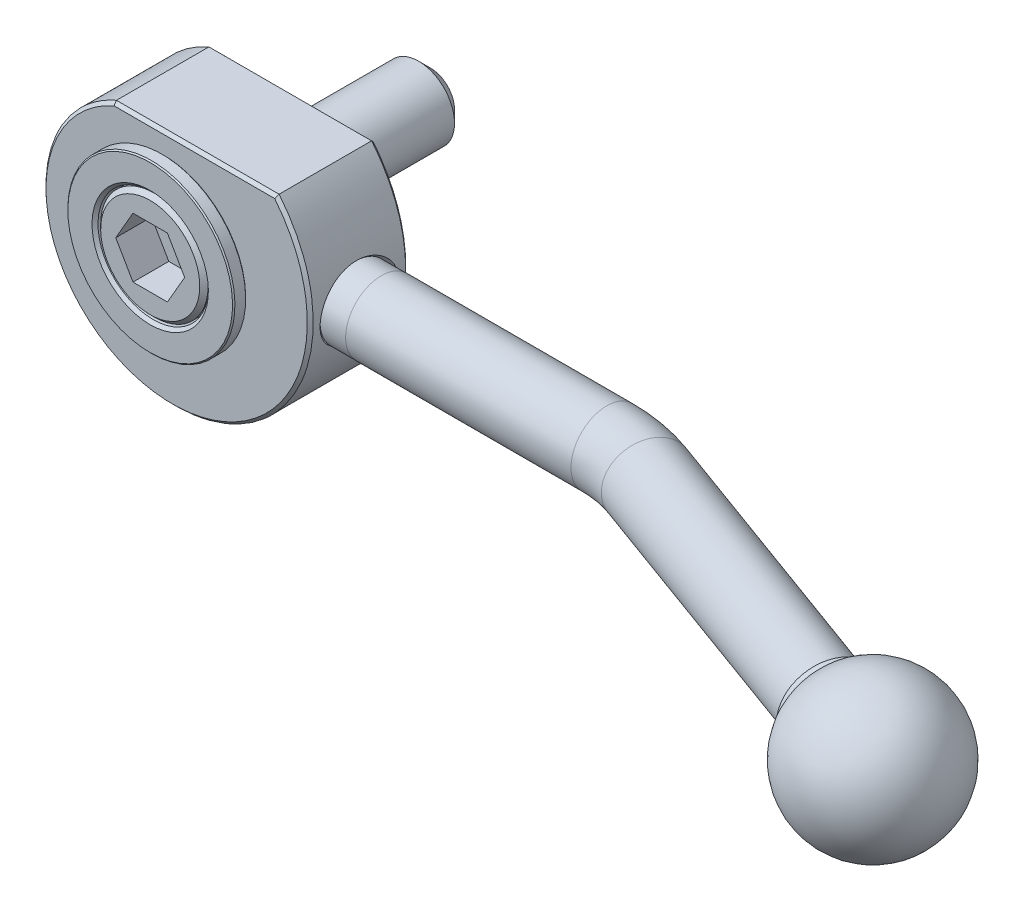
ISO-10303-21;
HEADER;
FILE_DESCRIPTION(('STEP AP214'),'2;1');
FILE_NAME('part.step','',(''),(''),'','','');
FILE_SCHEMA(('AUTOMOTIVE_DESIGN { 1 0 10303 214 1 1 1 1 }'));
ENDSEC;
DATA;
#1=APPLICATION_CONTEXT('core data for automotive mechanical design processes');
#2=APPLICATION_PROTOCOL_DEFINITION('international standard','automotive_design',2000,#1);
#3=PRODUCT_CONTEXT('',#1,'mechanical');
#4=PRODUCT('Part','Part','',(#3));
#5=PRODUCT_RELATED_PRODUCT_CATEGORY('part','',(#4));
#6=PRODUCT_DEFINITION_FORMATION('','',#4);
#7=PRODUCT_DEFINITION_CONTEXT('part definition',#1,'design');
#8=PRODUCT_DEFINITION('design','',#6,#7);
#9=PRODUCT_DEFINITION_SHAPE('','',#8);
#10=(LENGTH_UNIT() NAMED_UNIT(*) SI_UNIT(.MILLI.,.METRE.));
#11=(NAMED_UNIT(*) PLANE_ANGLE_UNIT() SI_UNIT($,.RADIAN.));
#12=(NAMED_UNIT(*) SI_UNIT($,.STERADIAN.) SOLID_ANGLE_UNIT());
#13=UNCERTAINTY_MEASURE_WITH_UNIT(LENGTH_MEASURE(1.E-05),#10,'distance_accuracy_value','');
#14=(GEOMETRIC_REPRESENTATION_CONTEXT(3) GLOBAL_UNCERTAINTY_ASSIGNED_CONTEXT((#13)) GLOBAL_UNIT_ASSIGNED_CONTEXT((#10,
#11,#12)) REPRESENTATION_CONTEXT('',''));
#15=CARTESIAN_POINT('',(0.,0.,0.));
#16=DIRECTION('',(0.,0.,1.));
#17=DIRECTION('',(1.,0.,0.));
#18=AXIS2_PLACEMENT_3D('',#15,#16,#17);
#19=CARTESIAN_POINT('',(133.429251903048,-8.50662416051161E-13,34.3363596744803));
#20=DIRECTION('',(-0.939692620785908,0.,-0.342020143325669));
#21=DIRECTION('',(0.336321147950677,-0.181790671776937,-0.924034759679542));
#22=AXIS2_PLACEMENT_3D('',#19,#20,#21);
#23=SPHERICAL_SURFACE('',#22,12.5);
#24=CARTESIAN_POINT('',(123.860638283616,-4.59216329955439E-13,30.8536691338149));
#25=DIRECTION('',(-0.939692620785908,0.,-0.342020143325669));
#26=DIRECTION('',(0.0621760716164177,0.98333725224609,-0.170827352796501));
#27=AXIS2_PLACEMENT_3D('',#24,#25,#26);
#28=CIRCLE('',#27,7.2500000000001);
#29=CARTESIAN_POINT('',(124.311414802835,7.12919507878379,29.6151708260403));
#30=VERTEX_POINT('',#29);
#31=EDGE_CURVE('E990',#30,#30,#28,.T.);
#32=ORIENTED_EDGE('',*,*,#31,.F.);
#33=EDGE_LOOP('',(#32));
#34=FACE_BOUND('',#33,.T.);
#35=ADVANCED_FACE('F15',(#34),#23,.T.);
#36=CARTESIAN_POINT('',(122.622786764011,-4.6185612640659E-13,30.4031280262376));
#37=DIRECTION('',(-0.939692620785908,0.,-0.342020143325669));
#38=DIRECTION('',(0.0621760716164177,0.98333725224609,-0.170827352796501));
#39=AXIS2_PLACEMENT_3D('',#36,#37,#38);
#40=PLANE('',#39);
#41=CARTESIAN_POINT('',(122.622786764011,-3.53644314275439E-13,30.4031280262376));
#42=DIRECTION('',(-0.939692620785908,0.,-0.342020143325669));
#43=DIRECTION('',(0.342020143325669,0.,-0.939692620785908));
#44=AXIS2_PLACEMENT_3D('',#41,#42,#43);
#45=CIRCLE('',#44,5.79999999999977);
#46=CARTESIAN_POINT('',(124.6065035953,-4.52687220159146E-13,24.9529108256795));
#47=VERTEX_POINT('',#46);
#48=EDGE_CURVE('E9',#47,#47,#45,.T.);
#49=ORIENTED_EDGE('',*,*,#48,.F.);
#50=EDGE_LOOP('',(#49));
#51=FACE_BOUND('',#50,.T.);
#52=CARTESIAN_POINT('',(122.622786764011,-4.6185612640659E-13,30.4031280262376));
#53=DIRECTION('',(-0.939692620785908,0.,-0.342020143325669));
#54=DIRECTION('',(0.0621760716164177,0.98333725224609,-0.170827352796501));
#55=AXIS2_PLACEMENT_3D('',#52,#53,#54);
#56=CIRCLE('',#55,7.2500000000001);
#57=CARTESIAN_POINT('',(123.07356328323,7.12919507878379,29.1646297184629));
#58=VERTEX_POINT('',#57);
#59=EDGE_CURVE('E27',#58,#58,#56,.T.);
#60=ORIENTED_EDGE('',*,*,#59,.T.);
#61=EDGE_LOOP('',(#60));
#62=FACE_BOUND('',#61,.T.);
#63=ADVANCED_FACE('F966',(#51,#62),#40,.T.);
#64=CARTESIAN_POINT('',(122.622786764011,-4.6185612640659E-13,30.4031280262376));
#65=DIRECTION('',(-0.939692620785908,0.,-0.342020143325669));
#66=DIRECTION('',(0.0621760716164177,0.98333725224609,-0.170827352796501));
#67=AXIS2_PLACEMENT_3D('',#64,#65,#66);
#68=CYLINDRICAL_SURFACE('',#67,7.2500000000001);
#69=CARTESIAN_POINT('',(124.311414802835,7.12919507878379,29.6151708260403));
#70=CARTESIAN_POINT('',(124.298520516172,7.12919507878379,29.610477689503));
#71=CARTESIAN_POINT('',(124.28562622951,7.12919507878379,29.6057845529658));
#72=CARTESIAN_POINT('',(124.259837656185,7.12919507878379,29.5963982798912));
#73=CARTESIAN_POINT('',(124.246943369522,7.12919507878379,29.591705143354));
#74=CARTESIAN_POINT('',(124.221154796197,7.12919507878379,29.5823188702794));
#75=CARTESIAN_POINT('',(124.208260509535,7.12919507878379,29.5776257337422));
#76=CARTESIAN_POINT('',(124.182471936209,7.12919507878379,29.5682394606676));
#77=CARTESIAN_POINT('',(124.169577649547,7.12919507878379,29.5635463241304));
#78=CARTESIAN_POINT('',(124.143789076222,7.12919507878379,29.5541600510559));
#79=CARTESIAN_POINT('',(124.130894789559,7.12919507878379,29.5494669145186));
#80=CARTESIAN_POINT('',(124.105106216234,7.12919507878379,29.5400806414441));
#81=CARTESIAN_POINT('',(124.092211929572,7.12919507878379,29.5353875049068));
#82=CARTESIAN_POINT('',(124.066423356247,7.12919507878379,29.5260012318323));
#83=CARTESIAN_POINT('',(124.053529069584,7.12919507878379,29.521308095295));
#84=CARTESIAN_POINT('',(124.027740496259,7.12919507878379,29.5119218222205));
#85=CARTESIAN_POINT('',(124.014846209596,7.12919507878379,29.5072286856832));
#86=CARTESIAN_POINT('',(123.989057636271,7.12919507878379,29.4978424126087));
#87=CARTESIAN_POINT('',(123.976163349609,7.12919507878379,29.4931492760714));
#88=CARTESIAN_POINT('',(123.950374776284,7.12919507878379,29.4837630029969));
#89=CARTESIAN_POINT('',(123.937480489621,7.12919507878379,29.4790698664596));
#90=CARTESIAN_POINT('',(123.911691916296,7.12919507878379,29.4696835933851));
#91=CARTESIAN_POINT('',(123.898797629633,7.12919507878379,29.4649904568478));
#92=CARTESIAN_POINT('',(123.873009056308,7.12919507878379,29.4556041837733));
#93=CARTESIAN_POINT('',(123.860114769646,7.12919507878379,29.450911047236));
#94=CARTESIAN_POINT('',(123.834326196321,7.12919507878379,29.4415247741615));
#95=CARTESIAN_POINT('',(123.821431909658,7.12919507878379,29.4368316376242));
#96=CARTESIAN_POINT('',(123.795643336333,7.12919507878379,29.4274453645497));
#97=CARTESIAN_POINT('',(123.78274904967,7.12919507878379,29.4227522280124));
#98=CARTESIAN_POINT('',(123.756960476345,7.12919507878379,29.4133659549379));
#99=CARTESIAN_POINT('',(123.744066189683,7.12919507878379,29.4086728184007));
#100=CARTESIAN_POINT('',(123.718277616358,7.12919507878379,29.3992865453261));
#101=CARTESIAN_POINT('',(123.705383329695,7.12919507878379,29.3945934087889));
#102=CARTESIAN_POINT('',(123.67959475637,7.12919507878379,29.3852071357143));
#103=CARTESIAN_POINT('',(123.666700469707,7.12919507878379,29.3805139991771));
#104=CARTESIAN_POINT('',(123.640911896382,7.12919507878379,29.3711277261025));
#105=CARTESIAN_POINT('',(123.62801760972,7.12919507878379,29.3664345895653));
#106=CARTESIAN_POINT('',(123.602229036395,7.12919507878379,29.3570483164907));
#107=CARTESIAN_POINT('',(123.589334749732,7.12919507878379,29.3523551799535));
#108=CARTESIAN_POINT('',(123.563546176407,7.12919507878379,29.342968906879));
#109=CARTESIAN_POINT('',(123.550651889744,7.12919507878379,29.3382757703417));
#110=CARTESIAN_POINT('',(123.524863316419,7.12919507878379,29.3288894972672));
#111=CARTESIAN_POINT('',(123.511969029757,7.12919507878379,29.3241963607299));
#112=CARTESIAN_POINT('',(123.486180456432,7.12919507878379,29.3148100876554));
#113=CARTESIAN_POINT('',(123.473286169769,7.12919507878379,29.3101169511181));
#114=CARTESIAN_POINT('',(123.447497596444,7.12919507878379,29.3007306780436));
#115=CARTESIAN_POINT('',(123.434603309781,7.12919507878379,29.2960375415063));
#116=CARTESIAN_POINT('',(123.408814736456,7.12919507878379,29.2866512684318));
#117=CARTESIAN_POINT('',(123.395920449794,7.12919507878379,29.2819581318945));
#118=CARTESIAN_POINT('',(123.370131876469,7.12919507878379,29.27257185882));
#119=CARTESIAN_POINT('',(123.357237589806,7.12919507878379,29.2678787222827));
#120=CARTESIAN_POINT('',(123.331449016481,7.12919507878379,29.2584924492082));
#121=CARTESIAN_POINT('',(123.318554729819,7.12919507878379,29.2537993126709));
#122=CARTESIAN_POINT('',(123.292766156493,7.12919507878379,29.2444130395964));
#123=CARTESIAN_POINT('',(123.279871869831,7.12919507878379,29.2397199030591));
#124=CARTESIAN_POINT('',(123.254083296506,7.12919507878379,29.2303336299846));
#125=CARTESIAN_POINT('',(123.241189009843,7.12919507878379,29.2256404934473));
#126=CARTESIAN_POINT('',(123.215400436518,7.12919507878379,29.2162542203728));
#127=CARTESIAN_POINT('',(123.202506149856,7.12919507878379,29.2115610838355));
#128=CARTESIAN_POINT('',(123.17671757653,7.12919507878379,29.202174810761));
#129=CARTESIAN_POINT('',(123.163823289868,7.12919507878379,29.1974816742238));
#130=CARTESIAN_POINT('',(123.138034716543,7.12919507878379,29.1880954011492));
#131=CARTESIAN_POINT('',(123.12514042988,7.12919507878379,29.183402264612));
#132=CARTESIAN_POINT('',(123.099351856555,7.12919507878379,29.1740159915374));
#133=CARTESIAN_POINT('',(123.086457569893,7.12919507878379,29.1693228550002));
#134=CARTESIAN_POINT('',(123.07356328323,7.12919507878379,29.1646297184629));
#135=B_SPLINE_CURVE_WITH_KNOTS('',3,(#69,#70,#71,#72,#73,#74,#75,#76,#77,#78,#79,#80,#81,#82,
#83,#84,#85,#86,#87,#88,#89,#90,#91,#92,#93,#94,#95,#96,#97,#98,#99,#100,#101,#102,#103,#104,
#105,#106,#107,#108,#109,#110,#111,#112,#113,#114,#115,#116,#117,#118,#119,#120,#121,#122,#123,
#124,#125,#126,#127,#128,#129,#130,#131,#132,#133,#134),.UNSPECIFIED.,.F.,.F.,(4,2,2,2,2,2,2,2,
2,2,2,2,2,2,2,2,2,2,2,2,2,2,2,2,2,2,2,2,2,2,2,2,4),(0.,0.0411654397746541,0.0823308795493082,
0.123496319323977,0.164661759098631,0.205827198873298,0.246992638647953,0.28815807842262,
0.329323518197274,0.370488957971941,0.411654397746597,0.452819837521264,0.493985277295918,
0.535150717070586,0.576316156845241,0.617481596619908,0.658647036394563,0.699812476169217,
0.740977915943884,0.782143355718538,0.823308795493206,0.864474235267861,0.905639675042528,
0.946805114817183,0.98797055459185,1.0291359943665,1.07030143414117,1.11146687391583,
1.15263231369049,1.19379775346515,1.23496319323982,1.27612863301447,1.31729407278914),.UNSPECIFIED.);
#136=EDGE_CURVE('BSEAM333',#30,#58,#135,.T.);
#137=ORIENTED_EDGE('',*,*,#31,.T.);
#138=ORIENTED_EDGE('',*,*,#59,.F.);
#139=ORIENTED_EDGE('',*,*,#136,.T.);
#140=ORIENTED_EDGE('',*,*,#136,.F.);
#141=EDGE_LOOP('',(#137,#139,#138,#140));
#142=FACE_BOUND('',#141,.T.);
#143=ADVANCED_FACE('F333',(#142),#68,.T.);
#144=CARTESIAN_POINT('',(2.88675134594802,-5.,16.));
#145=DIRECTION('',(0.,0.,-1.));
#146=DIRECTION('',(0.,1.,0.));
#147=AXIS2_PLACEMENT_3D('',#144,#145,#146);
#148=PLANE('',#147);
#149=DIRECTION('',(0.5,0.866025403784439,0.));
#150=VECTOR('',#149,1.);
#151=CARTESIAN_POINT('',(2.88675134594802,-5.,16.));
#152=LINE('',#151,#150);
#153=CARTESIAN_POINT('',(2.88675134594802,-5.,16.));
#154=VERTEX_POINT('',#153);
#155=CARTESIAN_POINT('',(5.77350269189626,0.,16.));
#156=VERTEX_POINT('',#155);
#157=EDGE_CURVE('E479',#154,#156,#152,.T.);
#158=ORIENTED_EDGE('',*,*,#157,.T.);
#159=DIRECTION('',(-0.5,0.866025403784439,0.));
#160=VECTOR('',#159,1.);
#161=CARTESIAN_POINT('',(5.77350269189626,0.,16.));
#162=LINE('',#161,#160);
#163=CARTESIAN_POINT('',(2.88675134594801,5.,16.));
#164=VERTEX_POINT('',#163);
#165=EDGE_CURVE('E482',#156,#164,#162,.T.);
#166=ORIENTED_EDGE('',*,*,#165,.T.);
#167=DIRECTION('',(-1.,0.,0.));
#168=VECTOR('',#167,1.);
#169=CARTESIAN_POINT('',(2.88675134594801,5.,16.));
#170=LINE('',#169,#168);
#171=CARTESIAN_POINT('',(-2.88675134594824,5.,16.));
#172=VERTEX_POINT('',#171);
#173=EDGE_CURVE('E485',#164,#172,#170,.T.);
#174=ORIENTED_EDGE('',*,*,#173,.T.);
#175=DIRECTION('',(-0.5,-0.866025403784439,0.));
#176=VECTOR('',#175,1.);
#177=CARTESIAN_POINT('',(-2.88675134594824,5.,16.));
#178=LINE('',#177,#176);
#179=CARTESIAN_POINT('',(-5.77350269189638,0.,16.));
#180=VERTEX_POINT('',#179);
#181=EDGE_CURVE('E488',#172,#180,#178,.T.);
#182=ORIENTED_EDGE('',*,*,#181,.T.);
#183=DIRECTION('',(0.5,-0.866025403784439,0.));
#184=VECTOR('',#183,1.);
#185=CARTESIAN_POINT('',(-5.77350269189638,0.,16.));
#186=LINE('',#185,#184);
#187=CARTESIAN_POINT('',(-2.88675134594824,-5.,16.));
#188=VERTEX_POINT('',#187);
#189=EDGE_CURVE('E491',#180,#188,#186,.T.);
#190=ORIENTED_EDGE('',*,*,#189,.T.);
#191=DIRECTION('',(1.,0.,0.));
#192=VECTOR('',#191,1.);
#193=CARTESIAN_POINT('',(-2.88675134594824,-5.,16.));
#194=LINE('',#193,#192);
#195=EDGE_CURVE('E494',#188,#154,#194,.T.);
#196=ORIENTED_EDGE('',*,*,#195,.T.);
#197=EDGE_LOOP('',(#158,#166,#174,#182,#190,#196));
#198=FACE_BOUND('',#197,.T.);
#199=ADVANCED_FACE('F322',(#198),#148,.F.);
#200=CARTESIAN_POINT('',(2.88675134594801,5.,16.));
#201=DIRECTION('',(0.,1.,0.));
#202=DIRECTION('',(-1.,0.,0.));
#203=AXIS2_PLACEMENT_3D('',#200,#201,#202);
#204=PLANE('',#203);
#205=DIRECTION('',(-1.,0.,0.));
#206=VECTOR('',#205,1.);
#207=CARTESIAN_POINT('',(2.88675134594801,5.,22.));
#208=LINE('',#207,#206);
#209=CARTESIAN_POINT('',(2.88675134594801,5.,22.));
#210=VERTEX_POINT('',#209);
#211=CARTESIAN_POINT('',(-2.88675134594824,5.,22.));
#212=VERTEX_POINT('',#211);
#213=EDGE_CURVE('E463',#210,#212,#208,.T.);
#214=ORIENTED_EDGE('',*,*,#213,.T.);
#215=DIRECTION('',(0.,0.,1.));
#216=VECTOR('',#215,1.);
#217=CARTESIAN_POINT('',(-2.88675134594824,5.,16.));
#218=LINE('',#217,#216);
#219=EDGE_CURVE('E505',#172,#212,#218,.T.);
#220=ORIENTED_EDGE('',*,*,#219,.F.);
#221=ORIENTED_EDGE('',*,*,#173,.F.);
#222=DIRECTION('',(0.,0.,1.));
#223=VECTOR('',#222,1.);
#224=CARTESIAN_POINT('',(2.88675134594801,5.,16.));
#225=LINE('',#224,#223);
#226=EDGE_CURVE('E507',#164,#210,#225,.T.);
#227=ORIENTED_EDGE('',*,*,#226,.T.);
#228=EDGE_LOOP('',(#214,#220,#221,#227));
#229=FACE_BOUND('',#228,.T.);
#230=ADVANCED_FACE('F332',(#229),#204,.F.);
#231=CARTESIAN_POINT('',(-2.88675134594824,5.,16.));
#232=DIRECTION('',(-0.866025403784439,0.5,0.));
#233=DIRECTION('',(-0.5,-0.866025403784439,0.));
#234=AXIS2_PLACEMENT_3D('',#231,#232,#233);
#235=PLANE('',#234);
#236=DIRECTION('',(-0.5,-0.866025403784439,0.));
#237=VECTOR('',#236,1.);
#238=CARTESIAN_POINT('',(-2.88675134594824,5.,22.));
#239=LINE('',#238,#237);
#240=CARTESIAN_POINT('',(-5.77350269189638,0.,22.));
#241=VERTEX_POINT('',#240);
#242=EDGE_CURVE('E470',#212,#241,#239,.T.);
#243=ORIENTED_EDGE('',*,*,#242,.T.);
#244=DIRECTION('',(0.,0.,1.));
#245=VECTOR('',#244,1.);
#246=CARTESIAN_POINT('',(-5.77350269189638,0.,16.));
#247=LINE('',#246,#245);
#248=EDGE_CURVE('E503',#180,#241,#247,.T.);
#249=ORIENTED_EDGE('',*,*,#248,.F.);
#250=ORIENTED_EDGE('',*,*,#181,.F.);
#251=ORIENTED_EDGE('',*,*,#219,.T.);
#252=EDGE_LOOP('',(#243,#249,#250,#251));
#253=FACE_BOUND('',#252,.T.);
#254=ADVANCED_FACE('F343',(#253),#235,.F.);
#255=CARTESIAN_POINT('',(-5.77350269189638,0.,16.));
#256=DIRECTION('',(-0.866025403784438,-0.5,0.));
#257=DIRECTION('',(0.5,-0.866025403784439,0.));
#258=AXIS2_PLACEMENT_3D('',#255,#256,#257);
#259=PLANE('',#258);
#260=DIRECTION('',(0.5,-0.866025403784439,0.));
#261=VECTOR('',#260,1.);
#262=CARTESIAN_POINT('',(-5.77350269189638,0.,22.));
#263=LINE('',#262,#261);
#264=CARTESIAN_POINT('',(-2.88675134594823,-5.,22.));
#265=VERTEX_POINT('',#264);
#266=EDGE_CURVE('E473',#241,#265,#263,.T.);
#267=ORIENTED_EDGE('',*,*,#266,.T.);
#268=DIRECTION('',(0.,0.,1.));
#269=VECTOR('',#268,1.);
#270=CARTESIAN_POINT('',(-2.88675134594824,-5.,16.));
#271=LINE('',#270,#269);
#272=EDGE_CURVE('E501',#188,#265,#271,.T.);
#273=ORIENTED_EDGE('',*,*,#272,.F.);
#274=ORIENTED_EDGE('',*,*,#189,.F.);
#275=ORIENTED_EDGE('',*,*,#248,.T.);
#276=EDGE_LOOP('',(#267,#273,#274,#275));
#277=FACE_BOUND('',#276,.T.);
#278=ADVANCED_FACE('F339',(#277),#259,.F.);
#279=CARTESIAN_POINT('',(-2.88675134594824,-5.,16.));
#280=DIRECTION('',(0.,-1.,0.));
#281=DIRECTION('',(1.,0.,0.));
#282=AXIS2_PLACEMENT_3D('',#279,#280,#281);
#283=PLANE('',#282);
#284=DIRECTION('',(1.,0.,0.));
#285=VECTOR('',#284,1.);
#286=CARTESIAN_POINT('',(-2.88675134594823,-5.,22.));
#287=LINE('',#286,#285);
#288=CARTESIAN_POINT('',(2.88675134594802,-5.,22.));
#289=VERTEX_POINT('',#288);
#290=EDGE_CURVE('E476',#265,#289,#287,.T.);
#291=ORIENTED_EDGE('',*,*,#290,.T.);
#292=DIRECTION('',(0.,0.,1.));
#293=VECTOR('',#292,1.);
#294=CARTESIAN_POINT('',(2.88675134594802,-5.,16.));
#295=LINE('',#294,#293);
#296=EDGE_CURVE('E498',#154,#289,#295,.T.);
#297=ORIENTED_EDGE('',*,*,#296,.F.);
#298=ORIENTED_EDGE('',*,*,#195,.F.);
#299=ORIENTED_EDGE('',*,*,#272,.T.);
#300=EDGE_LOOP('',(#291,#297,#298,#299));
#301=FACE_BOUND('',#300,.T.);
#302=ADVANCED_FACE('F335',(#301),#283,.F.);
#303=CARTESIAN_POINT('',(2.88675134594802,-5.,16.));
#304=DIRECTION('',(0.866025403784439,-0.5,0.));
#305=DIRECTION('',(0.5,0.866025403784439,0.));
#306=AXIS2_PLACEMENT_3D('',#303,#304,#305);
#307=PLANE('',#306);
#308=DIRECTION('',(0.5,0.866025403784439,0.));
#309=VECTOR('',#308,1.);
#310=CARTESIAN_POINT('',(2.88675134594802,-5.,22.));
#311=LINE('',#310,#309);
#312=CARTESIAN_POINT('',(5.77350269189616,0.,22.));
#313=VERTEX_POINT('',#312);
#314=EDGE_CURVE('E456',#289,#313,#311,.T.);
#315=ORIENTED_EDGE('',*,*,#314,.T.);
#316=DIRECTION('',(0.,0.,1.));
#317=VECTOR('',#316,1.);
#318=CARTESIAN_POINT('',(5.77350269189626,0.,16.));
#319=LINE('',#318,#317);
#320=EDGE_CURVE('E497',#156,#313,#319,.T.);
#321=ORIENTED_EDGE('',*,*,#320,.F.);
#322=ORIENTED_EDGE('',*,*,#157,.F.);
#323=ORIENTED_EDGE('',*,*,#296,.T.);
#324=EDGE_LOOP('',(#315,#321,#322,#323));
#325=FACE_BOUND('',#324,.T.);
#326=ADVANCED_FACE('F338',(#325),#307,.F.);
#327=CARTESIAN_POINT('',(5.77350269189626,0.,16.));
#328=DIRECTION('',(0.866025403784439,0.5,0.));
#329=DIRECTION('',(-0.5,0.866025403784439,0.));
#330=AXIS2_PLACEMENT_3D('',#327,#328,#329);
#331=PLANE('',#330);
#332=DIRECTION('',(-0.5,0.866025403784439,0.));
#333=VECTOR('',#332,1.);
#334=CARTESIAN_POINT('',(5.77350269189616,0.,22.));
#335=LINE('',#334,#333);
#336=EDGE_CURVE('E458',#313,#210,#335,.T.);
#337=ORIENTED_EDGE('',*,*,#336,.T.);
#338=ORIENTED_EDGE('',*,*,#226,.F.);
#339=ORIENTED_EDGE('',*,*,#165,.F.);
#340=ORIENTED_EDGE('',*,*,#320,.T.);
#341=EDGE_LOOP('',(#337,#338,#339,#340));
#342=FACE_BOUND('',#341,.T.);
#343=ADVANCED_FACE('F351',(#342),#331,.F.);
#344=CARTESIAN_POINT('',(-1.2490009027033E-13,9.,22.));
#345=DIRECTION('',(0.,0.,-1.));
#346=DIRECTION('',(0.,1.,0.));
#347=AXIS2_PLACEMENT_3D('',#344,#345,#346);
#348=PLANE('',#347);
#349=CARTESIAN_POINT('',(-1.2490009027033E-13,0.,22.));
#350=DIRECTION('',(0.,0.,-1.));
#351=DIRECTION('',(0.,1.,0.));
#352=AXIS2_PLACEMENT_3D('',#349,#350,#351);
#353=CIRCLE('',#352,8.3);
#354=CARTESIAN_POINT('',(-1.2490009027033E-13,8.3,22.));
#355=VERTEX_POINT('',#354);
#356=EDGE_CURVE('E521',#355,#355,#353,.F.);
#357=ORIENTED_EDGE('',*,*,#356,.T.);
#358=EDGE_LOOP('',(#357));
#359=FACE_BOUND('',#358,.T.);
#360=ORIENTED_EDGE('',*,*,#336,.F.);
#361=ORIENTED_EDGE('',*,*,#314,.F.);
#362=ORIENTED_EDGE('',*,*,#290,.F.);
#363=ORIENTED_EDGE('',*,*,#266,.F.);
#364=ORIENTED_EDGE('',*,*,#242,.F.);
#365=ORIENTED_EDGE('',*,*,#213,.F.);
#366=EDGE_LOOP('',(#360,#361,#362,#363,#364,#365));
#367=FACE_BOUND('',#366,.T.);
#368=ADVANCED_FACE('F354',(#359,#367),#348,.F.);
#369=CARTESIAN_POINT('',(-1.2490009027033E-13,0.,22.));
#370=DIRECTION('',(0.,0.,-1.));
#371=DIRECTION('',(0.,1.,0.));
#372=AXIS2_PLACEMENT_3D('',#369,#370,#371);
#373=CONICAL_SURFACE('',#372,8.3,0.785398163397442);
#374=CARTESIAN_POINT('',(0.,0.,21.3));
#375=DIRECTION('',(0.,0.,-1.));
#376=DIRECTION('',(0.,1.,0.));
#377=AXIS2_PLACEMENT_3D('',#374,#375,#376);
#378=CIRCLE('',#377,9.);
#379=CARTESIAN_POINT('',(0.,9.,21.3));
#380=VERTEX_POINT('',#379);
#381=EDGE_CURVE('E524',#380,#380,#378,.T.);
#382=ORIENTED_EDGE('',*,*,#381,.F.);
#383=EDGE_LOOP('',(#382));
#384=FACE_BOUND('',#383,.T.);
#385=ORIENTED_EDGE('',*,*,#356,.F.);
#386=EDGE_LOOP('',(#385));
#387=FACE_BOUND('',#386,.T.);
#388=ADVANCED_FACE('F361',(#384,#387),#373,.T.);
#389=CARTESIAN_POINT('',(0.,0.,160.));
#390=DIRECTION('',(0.,0.,1.));
#391=DIRECTION('',(0.,-1.,0.));
#392=AXIS2_PLACEMENT_3D('',#389,#390,#391);
#393=CYLINDRICAL_SURFACE('',#392,9.);
#394=ORIENTED_EDGE('',*,*,#381,.T.);
#395=EDGE_LOOP('',(#394));
#396=FACE_BOUND('',#395,.T.);
#397=CARTESIAN_POINT('',(-1.2490009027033E-13,0.,10.));
#398=DIRECTION('',(0.,0.,1.));
#399=DIRECTION('',(0.,-1.,0.));
#400=AXIS2_PLACEMENT_3D('',#397,#398,#399);
#401=CIRCLE('',#400,9.);
#402=CARTESIAN_POINT('',(-1.2490009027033E-13,-9.,10.));
#403=VERTEX_POINT('',#402);
#404=EDGE_CURVE('E500',#403,#403,#401,.T.);
#405=ORIENTED_EDGE('',*,*,#404,.T.);
#406=EDGE_LOOP('',(#405));
#407=FACE_BOUND('',#406,.T.);
#408=ADVANCED_FACE('F233',(#396,#407),#393,.T.);
#409=CARTESIAN_POINT('',(0.,-6.25,10.));
#410=DIRECTION('',(0.,0.,-1.));
#411=DIRECTION('',(0.,1.,0.));
#412=AXIS2_PLACEMENT_3D('',#409,#410,#411);
#413=PLANE('',#412);
#414=ORIENTED_EDGE('',*,*,#404,.F.);
#415=EDGE_LOOP('',(#414));
#416=FACE_BOUND('',#415,.T.);
#417=CARTESIAN_POINT('',(0.,0.,10.));
#418=DIRECTION('',(0.,0.,1.));
#419=DIRECTION('',(0.,-1.,0.));
#420=AXIS2_PLACEMENT_3D('',#417,#418,#419);
#421=CIRCLE('',#420,9.25);
#422=CARTESIAN_POINT('',(0.,-9.25,10.));
#423=VERTEX_POINT('',#422);
#424=EDGE_CURVE('E118',#423,#423,#421,.T.);
#425=ORIENTED_EDGE('',*,*,#424,.T.);
#426=EDGE_LOOP('',(#425));
#427=FACE_BOUND('',#426,.T.);
#428=ADVANCED_FACE('F365',(#416,#427),#413,.F.);
#429=CARTESIAN_POINT('',(0.,0.,19.8));
#430=DIRECTION('',(0.,0.,1.));
#431=DIRECTION('',(0.,-1.,0.));
#432=AXIS2_PLACEMENT_3D('',#429,#430,#431);
#433=CYLINDRICAL_SURFACE('',#432,9.25);
#434=CARTESIAN_POINT('',(0.,0.,21.5));
#435=DIRECTION('',(0.,0.,1.));
#436=DIRECTION('',(0.,-1.,0.));
#437=AXIS2_PLACEMENT_3D('',#434,#435,#436);
#438=CIRCLE('',#437,9.25);
#439=CARTESIAN_POINT('',(0.,-9.25,21.5));
#440=VERTEX_POINT('',#439);
#441=EDGE_CURVE('E533',#440,#440,#438,.T.);
#442=ORIENTED_EDGE('',*,*,#441,.T.);
#443=EDGE_LOOP('',(#442));
#444=FACE_BOUND('',#443,.T.);
#445=ORIENTED_EDGE('',*,*,#424,.F.);
#446=EDGE_LOOP('',(#445));
#447=FACE_BOUND('',#446,.T.);
#448=ADVANCED_FACE('F326',(#444,#447),#433,.F.);
#449=CARTESIAN_POINT('',(-1.2490009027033E-13,0.,-25.));
#450=DIRECTION('',(0.,0.,-1.));
#451=DIRECTION('',(0.,1.,0.));
#452=AXIS2_PLACEMENT_3D('',#449,#450,#451);
#453=PLANE('',#452);
#454=CARTESIAN_POINT('',(-1.2490009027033E-13,0.,-25.));
#455=DIRECTION('',(0.,0.,-1.));
#456=DIRECTION('',(0.,1.,0.));
#457=AXIS2_PLACEMENT_3D('',#454,#455,#456);
#458=CIRCLE('',#457,4.);
#459=CARTESIAN_POINT('',(-1.2490009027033E-13,4.,-25.));
#460=VERTEX_POINT('',#459);
#461=EDGE_CURVE('E515',#460,#460,#458,.T.);
#462=ORIENTED_EDGE('',*,*,#461,.T.);
#463=EDGE_LOOP('',(#462));
#464=FACE_BOUND('',#463,.T.);
#465=ADVANCED_FACE('F323',(#464),#453,.T.);
#466=CARTESIAN_POINT('',(0.,0.,21.5));
#467=DIRECTION('',(0.,0.,1.));
#468=DIRECTION('',(0.,-1.,0.));
#469=AXIS2_PLACEMENT_3D('',#466,#467,#468);
#470=CONICAL_SURFACE('',#469,9.25,0.78539816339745);
#471=CARTESIAN_POINT('',(0.,0.,22.));
#472=DIRECTION('',(0.,0.,1.));
#473=DIRECTION('',(0.,-1.,0.));
#474=AXIS2_PLACEMENT_3D('',#471,#472,#473);
#475=CIRCLE('',#474,9.75);
#476=CARTESIAN_POINT('',(0.,-9.75,22.));
#477=VERTEX_POINT('',#476);
#478=EDGE_CURVE('E536',#477,#477,#475,.F.);
#479=ORIENTED_EDGE('',*,*,#478,.F.);
#480=EDGE_LOOP('',(#479));
#481=FACE_BOUND('',#480,.T.);
#482=ORIENTED_EDGE('',*,*,#441,.F.);
#483=EDGE_LOOP('',(#482));
#484=FACE_BOUND('',#483,.T.);
#485=ADVANCED_FACE('F268',(#481,#484),#470,.F.);
#486=CARTESIAN_POINT('',(-1.2490009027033E-13,0.,-25.));
#487=DIRECTION('',(0.,0.,1.));
#488=DIRECTION('',(0.,-1.,0.));
#489=AXIS2_PLACEMENT_3D('',#486,#487,#488);
#490=CONICAL_SURFACE('',#489,4.,0.785398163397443);
#491=CARTESIAN_POINT('',(-1.2490009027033E-13,0.,-23.));
#492=DIRECTION('',(0.,0.,-1.));
#493=DIRECTION('',(0.,1.,0.));
#494=AXIS2_PLACEMENT_3D('',#491,#492,#493);
#495=CIRCLE('',#494,6.);
#496=CARTESIAN_POINT('',(-1.2490009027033E-13,6.,-23.));
#497=VERTEX_POINT('',#496);
#498=EDGE_CURVE('E518',#497,#497,#495,.F.);
#499=ORIENTED_EDGE('',*,*,#498,.F.);
#500=EDGE_LOOP('',(#499));
#501=FACE_BOUND('',#500,.T.);
#502=ORIENTED_EDGE('',*,*,#461,.F.);
#503=EDGE_LOOP('',(#502));
#504=FACE_BOUND('',#503,.T.);
#505=ADVANCED_FACE('F328',(#501,#504),#490,.T.);
#506=CARTESIAN_POINT('',(0.,0.,22.));
#507=DIRECTION('',(0.,0.,1.));
#508=DIRECTION('',(0.,-1.,0.));
#509=AXIS2_PLACEMENT_3D('',#506,#507,#508);
#510=PLANE('',#509);
#511=CARTESIAN_POINT('',(0.,0.,22.));
#512=DIRECTION('',(0.,0.,1.));
#513=DIRECTION('',(0.,-1.,0.));
#514=AXIS2_PLACEMENT_3D('',#511,#512,#513);
#515=CIRCLE('',#514,13.8);
#516=CARTESIAN_POINT('',(0.,-13.8,22.));
#517=VERTEX_POINT('',#516);
#518=EDGE_CURVE('E435',#517,#517,#515,.T.);
#519=ORIENTED_EDGE('',*,*,#518,.T.);
#520=EDGE_LOOP('',(#519));
#521=FACE_BOUND('',#520,.T.);
#522=ORIENTED_EDGE('',*,*,#478,.T.);
#523=EDGE_LOOP('',(#522));
#524=FACE_BOUND('',#523,.T.);
#525=ADVANCED_FACE('F375',(#521,#524),#510,.T.);
#526=CARTESIAN_POINT('',(0.,0.,160.));
#527=DIRECTION('',(0.,0.,1.));
#528=DIRECTION('',(0.,-1.,0.));
#529=AXIS2_PLACEMENT_3D('',#526,#527,#528);
#530=CYLINDRICAL_SURFACE('',#529,6.);
#531=ORIENTED_EDGE('',*,*,#498,.T.);
#532=EDGE_LOOP('',(#531));
#533=FACE_BOUND('',#532,.T.);
#534=CARTESIAN_POINT('',(-1.2490009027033E-13,0.,10.));
#535=DIRECTION('',(0.,0.,1.));
#536=DIRECTION('',(0.,-1.,0.));
#537=AXIS2_PLACEMENT_3D('',#534,#535,#536);
#538=CIRCLE('',#537,6.);
#539=CARTESIAN_POINT('',(-1.2490009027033E-13,-6.,10.));
#540=VERTEX_POINT('',#539);
#541=EDGE_CURVE('E512',#540,#540,#538,.T.);
#542=ORIENTED_EDGE('',*,*,#541,.F.);
#543=EDGE_LOOP('',(#542));
#544=FACE_BOUND('',#543,.T.);
#545=ADVANCED_FACE('F329',(#533,#544),#530,.T.);
#546=CARTESIAN_POINT('',(0.,0.,22.));
#547=DIRECTION('',(0.,0.,-1.));
#548=DIRECTION('',(0.,1.,0.));
#549=AXIS2_PLACEMENT_3D('',#546,#547,#548);
#550=CONICAL_SURFACE('',#549,13.8,0.785398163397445);
#551=CARTESIAN_POINT('',(0.,0.,21.8));
#552=DIRECTION('',(0.,0.,1.));
#553=DIRECTION('',(0.,-1.,0.));
#554=AXIS2_PLACEMENT_3D('',#551,#552,#553);
#555=CIRCLE('',#554,14.);
#556=CARTESIAN_POINT('',(0.,-14.,21.8));
#557=VERTEX_POINT('',#556);
#558=EDGE_CURVE('E432',#557,#557,#555,.F.);
#559=ORIENTED_EDGE('',*,*,#558,.F.);
#560=EDGE_LOOP('',(#559));
#561=FACE_BOUND('',#560,.T.);
#562=ORIENTED_EDGE('',*,*,#518,.F.);
#563=EDGE_LOOP('',(#562));
#564=FACE_BOUND('',#563,.T.);
#565=ADVANCED_FACE('F371',(#561,#564),#550,.T.);
#566=CARTESIAN_POINT('',(-1.2490009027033E-13,6.,10.));
#567=DIRECTION('',(0.,0.,1.));
#568=DIRECTION('',(0.,-1.,0.));
#569=AXIS2_PLACEMENT_3D('',#566,#567,#568);
#570=PLANE('',#569);
#571=ORIENTED_EDGE('',*,*,#541,.T.);
#572=EDGE_LOOP('',(#571));
#573=FACE_BOUND('',#572,.T.);
#574=CARTESIAN_POINT('',(0.,0.,10.));
#575=DIRECTION('',(0.,0.,1.));
#576=DIRECTION('',(-1.,0.,0.));
#577=AXIS2_PLACEMENT_3D('',#574,#575,#576);
#578=CIRCLE('',#577,6.25);
#579=CARTESIAN_POINT('',(-6.25,0.,10.));
#580=VERTEX_POINT('',#579);
#581=EDGE_CURVE('E527',#580,#580,#578,.T.);
#582=ORIENTED_EDGE('',*,*,#581,.F.);
#583=EDGE_LOOP('',(#582));
#584=FACE_BOUND('',#583,.T.);
#585=ADVANCED_FACE('F367',(#573,#584),#570,.F.);
#586=CARTESIAN_POINT('',(0.,0.,22.));
#587=DIRECTION('',(0.,0.,-1.));
#588=DIRECTION('',(0.,1.,0.));
#589=AXIS2_PLACEMENT_3D('',#586,#587,#588);
#590=CYLINDRICAL_SURFACE('',#589,14.);
#591=CARTESIAN_POINT('',(0.,0.,20.));
#592=DIRECTION('',(0.,0.,1.));
#593=DIRECTION('',(0.,-1.,0.));
#594=AXIS2_PLACEMENT_3D('',#591,#592,#593);
#595=CIRCLE('',#594,14.);
#596=CARTESIAN_POINT('',(0.,-14.,20.));
#597=VERTEX_POINT('',#596);
#598=EDGE_CURVE('E443',#597,#597,#595,.T.);
#599=ORIENTED_EDGE('',*,*,#598,.T.);
#600=EDGE_LOOP('',(#599));
#601=FACE_BOUND('',#600,.T.);
#602=ORIENTED_EDGE('',*,*,#558,.T.);
#603=EDGE_LOOP('',(#602));
#604=FACE_BOUND('',#603,.T.);
#605=ADVANCED_FACE('F370',(#601,#604),#590,.T.);
#606=CARTESIAN_POINT('',(0.,0.,0.));
#607=DIRECTION('',(0.,0.,1.));
#608=DIRECTION('',(0.,-1.,0.));
#609=AXIS2_PLACEMENT_3D('',#606,#607,#608);
#610=CYLINDRICAL_SURFACE('',#609,6.25);
#611=CARTESIAN_POINT('',(0.,0.,0.5));
#612=DIRECTION('',(0.,0.,1.));
#613=DIRECTION('',(0.,-1.,0.));
#614=AXIS2_PLACEMENT_3D('',#611,#612,#613);
#615=CIRCLE('',#614,6.25);
#616=CARTESIAN_POINT('',(0.,-6.25,0.5));
#617=VERTEX_POINT('',#616);
#618=EDGE_CURVE('E548',#617,#617,#615,.F.);
#619=ORIENTED_EDGE('',*,*,#618,.T.);
#620=EDGE_LOOP('',(#619));
#621=FACE_BOUND('',#620,.T.);
#622=ORIENTED_EDGE('',*,*,#581,.T.);
#623=EDGE_LOOP('',(#622));
#624=FACE_BOUND('',#623,.T.);
#625=ADVANCED_FACE('F389',(#621,#624),#610,.F.);
#626=CARTESIAN_POINT('',(0.,0.,20.));
#627=DIRECTION('',(0.,0.,1.));
#628=DIRECTION('',(0.,-1.,0.));
#629=AXIS2_PLACEMENT_3D('',#626,#627,#628);
#630=CONICAL_SURFACE('',#629,14.,0.785398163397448);
#631=CARTESIAN_POINT('',(0.,0.,19.8));
#632=DIRECTION('',(0.,0.,1.));
#633=DIRECTION('',(0.,-1.,0.));
#634=AXIS2_PLACEMENT_3D('',#631,#632,#633);
#635=CIRCLE('',#634,13.8);
#636=CARTESIAN_POINT('',(0.,-13.8,19.8));
#637=VERTEX_POINT('',#636);
#638=EDGE_CURVE('E437',#637,#637,#635,.F.);
#639=ORIENTED_EDGE('',*,*,#638,.F.);
#640=EDGE_LOOP('',(#639));
#641=FACE_BOUND('',#640,.T.);
#642=ORIENTED_EDGE('',*,*,#598,.F.);
#643=EDGE_LOOP('',(#642));
#644=FACE_BOUND('',#643,.T.);
#645=ADVANCED_FACE('F392',(#641,#644),#630,.T.);
#646=CARTESIAN_POINT('',(0.,0.,0.));
#647=DIRECTION('',(0.,0.,-1.));
#648=DIRECTION('',(0.,1.,0.));
#649=AXIS2_PLACEMENT_3D('',#646,#647,#648);
#650=CONICAL_SURFACE('',#649,6.75,0.785398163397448);
#651=ORIENTED_EDGE('',*,*,#618,.F.);
#652=EDGE_LOOP('',(#651));
#653=FACE_BOUND('',#652,.T.);
#654=CARTESIAN_POINT('',(0.,0.,0.));
#655=DIRECTION('',(0.,0.,1.));
#656=DIRECTION('',(0.,-1.,0.));
#657=AXIS2_PLACEMENT_3D('',#654,#655,#656);
#658=CIRCLE('',#657,6.75);
#659=CARTESIAN_POINT('',(0.,-6.75,0.));
#660=VERTEX_POINT('',#659);
#661=EDGE_CURVE('E542',#660,#660,#658,.T.);
#662=ORIENTED_EDGE('',*,*,#661,.F.);
#663=EDGE_LOOP('',(#662));
#664=FACE_BOUND('',#663,.T.);
#665=ADVANCED_FACE('F394',(#653,#664),#650,.F.);
#666=CARTESIAN_POINT('',(0.,0.,19.8));
#667=DIRECTION('',(0.,0.,1.));
#668=DIRECTION('',(0.,-1.,0.));
#669=AXIS2_PLACEMENT_3D('',#666,#667,#668);
#670=PLANE('',#669);
#671=CARTESIAN_POINT('',(0.,0.,19.8));
#672=DIRECTION('',(0.,0.,1.));
#673=DIRECTION('',(0.,-1.,0.));
#674=AXIS2_PLACEMENT_3D('',#671,#672,#673);
#675=CIRCLE('',#674,12.65);
#676=CARTESIAN_POINT('',(0.,-12.65,19.8));
#677=VERTEX_POINT('',#676);
#678=EDGE_CURVE('E436',#677,#677,#675,.T.);
#679=ORIENTED_EDGE('',*,*,#678,.T.);
#680=EDGE_LOOP('',(#679));
#681=FACE_BOUND('',#680,.T.);
#682=ORIENTED_EDGE('',*,*,#638,.T.);
#683=EDGE_LOOP('',(#682));
#684=FACE_BOUND('',#683,.T.);
#685=ADVANCED_FACE('F398',(#681,#684),#670,.F.);
#686=CARTESIAN_POINT('',(0.,0.,0.));
#687=DIRECTION('',(0.,0.,1.));
#688=DIRECTION('',(0.,-1.,0.));
#689=AXIS2_PLACEMENT_3D('',#686,#687,#688);
#690=PLANE('',#689);
#691=CARTESIAN_POINT('',(0.,0.,0.));
#692=DIRECTION('',(0.,0.,1.));
#693=DIRECTION('',(0.,-1.,0.));
#694=AXIS2_PLACEMENT_3D('',#691,#692,#693);
#695=CIRCLE('',#694,11.75);
#696=CARTESIAN_POINT('',(0.,-11.75,0.));
#697=VERTEX_POINT('',#696);
#698=EDGE_CURVE('E545',#697,#697,#695,.F.);
#699=ORIENTED_EDGE('',*,*,#698,.T.);
#700=EDGE_LOOP('',(#699));
#701=FACE_BOUND('',#700,.T.);
#702=ORIENTED_EDGE('',*,*,#661,.T.);
#703=EDGE_LOOP('',(#702));
#704=FACE_BOUND('',#703,.T.);
#705=ADVANCED_FACE('F401',(#701,#704),#690,.F.);
#706=CARTESIAN_POINT('',(0.,0.,19.4));
#707=DIRECTION('',(0.,0.,1.));
#708=DIRECTION('',(0.,-1.,0.));
#709=AXIS2_PLACEMENT_3D('',#706,#707,#708);
#710=TOROIDAL_SURFACE('',#709,12.65,0.4);
#711=CARTESIAN_POINT('',(0.,0.,19.4));
#712=DIRECTION('',(0.,0.,1.));
#713=DIRECTION('',(0.,-1.,0.));
#714=AXIS2_PLACEMENT_3D('',#711,#712,#713);
#715=CIRCLE('',#714,12.25);
#716=CARTESIAN_POINT('',(0.,-12.25,19.4));
#717=VERTEX_POINT('',#716);
#718=EDGE_CURVE('E440',#717,#717,#715,.F.);
#719=ORIENTED_EDGE('',*,*,#718,.F.);
#720=EDGE_LOOP('',(#719));
#721=FACE_BOUND('',#720,.T.);
#722=ORIENTED_EDGE('',*,*,#678,.F.);
#723=EDGE_LOOP('',(#722));
#724=FACE_BOUND('',#723,.T.);
#725=ADVANCED_FACE('F269',(#721,#724),#710,.F.);
#726=CARTESIAN_POINT('',(0.,0.,0.5));
#727=DIRECTION('',(0.,0.,1.));
#728=DIRECTION('',(0.,-1.,0.));
#729=AXIS2_PLACEMENT_3D('',#726,#727,#728);
#730=CONICAL_SURFACE('',#729,12.25,0.785398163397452);
#731=ORIENTED_EDGE('',*,*,#698,.F.);
#732=EDGE_LOOP('',(#731));
#733=FACE_BOUND('',#732,.T.);
#734=CARTESIAN_POINT('',(0.,0.,0.5));
#735=DIRECTION('',(0.,0.,1.));
#736=DIRECTION('',(0.,-1.,0.));
#737=AXIS2_PLACEMENT_3D('',#734,#735,#736);
#738=CIRCLE('',#737,12.25);
#739=CARTESIAN_POINT('',(0.,-12.25,0.5));
#740=VERTEX_POINT('',#739);
#741=EDGE_CURVE('E539',#740,#740,#738,.T.);
#742=ORIENTED_EDGE('',*,*,#741,.F.);
#743=EDGE_LOOP('',(#742));
#744=FACE_BOUND('',#743,.T.);
#745=ADVANCED_FACE('F408',(#733,#744),#730,.T.);
#746=CARTESIAN_POINT('',(0.,0.,0.));
#747=DIRECTION('',(0.,0.,1.));
#748=DIRECTION('',(0.,-1.,0.));
#749=AXIS2_PLACEMENT_3D('',#746,#747,#748);
#750=CYLINDRICAL_SURFACE('',#749,12.25);
#751=CARTESIAN_POINT('',(0.,-4.52276765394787E-13,19.));
#752=DIRECTION('',(0.,0.,1.));
#753=DIRECTION('',(-1.,0.,0.));
#754=AXIS2_PLACEMENT_3D('',#751,#752,#753);
#755=CIRCLE('',#754,12.25);
#756=CARTESIAN_POINT('',(-12.25,-4.52276765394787E-13,19.));
#757=VERTEX_POINT('',#756);
#758=EDGE_CURVE('E449',#757,#757,#755,.F.);
#759=ORIENTED_EDGE('',*,*,#758,.F.);
#760=EDGE_LOOP('',(#759));
#761=FACE_BOUND('',#760,.T.);
#762=ORIENTED_EDGE('',*,*,#718,.T.);
#763=EDGE_LOOP('',(#762));
#764=FACE_BOUND('',#763,.T.);
#765=ADVANCED_FACE('F288',(#761,#764),#750,.T.);
#766=CARTESIAN_POINT('',(0.,-4.53097674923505E-13,3.5));
#767=DIRECTION('',(0.,0.,-1.));
#768=DIRECTION('',(1.,0.,0.));
#769=AXIS2_PLACEMENT_3D('',#766,#767,#768);
#770=CIRCLE('',#769,12.25);
#771=CARTESIAN_POINT('',(12.25,-4.53097674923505E-13,3.5));
#772=VERTEX_POINT('',#771);
#773=EDGE_CURVE('E451',#772,#772,#770,.F.);
#774=ORIENTED_EDGE('',*,*,#773,.F.);
#775=EDGE_LOOP('',(#774));
#776=FACE_BOUND('',#775,.T.);
#777=ORIENTED_EDGE('',*,*,#741,.T.);
#778=EDGE_LOOP('',(#777));
#779=FACE_BOUND('',#778,.T.);
#780=ADVANCED_FACE('F287',(#776,#779),#750,.T.);
#781=CARTESIAN_POINT('',(0.,-4.52250284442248E-13,19.5));
#782=DIRECTION('',(0.,0.,1.));
#783=DIRECTION('',(0.,1.,0.));
#784=AXIS2_PLACEMENT_3D('',#781,#782,#783);
#785=CONICAL_SURFACE('',#784,12.75,0.785398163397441);
#786=ORIENTED_EDGE('',*,*,#758,.T.);
#787=EDGE_LOOP('',(#786));
#788=FACE_BOUND('',#787,.T.);
#789=CARTESIAN_POINT('',(0.,-4.52250284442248E-13,19.5));
#790=DIRECTION('',(0.,0.,-1.));
#791=DIRECTION('',(0.,-1.,0.));
#792=AXIS2_PLACEMENT_3D('',#789,#790,#791);
#793=CIRCLE('',#792,12.75);
#794=CARTESIAN_POINT('',(0.,-12.7500000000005,19.5));
#795=VERTEX_POINT('',#794);
#796=EDGE_CURVE('E185',#795,#795,#793,.T.);
#797=ORIENTED_EDGE('',*,*,#796,.F.);
#798=EDGE_LOOP('',(#797));
#799=FACE_BOUND('',#798,.T.);
#800=ADVANCED_FACE('F567',(#788,#799),#785,.F.);
#801=CARTESIAN_POINT('',(0.,-4.53097674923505E-13,3.5));
#802=DIRECTION('',(0.,0.,-1.));
#803=DIRECTION('',(0.,-1.,0.));
#804=AXIS2_PLACEMENT_3D('',#801,#802,#803);
#805=CONICAL_SURFACE('',#804,12.25,0.785398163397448);
#806=CARTESIAN_POINT('',(0.,-4.53124155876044E-13,3.));
#807=DIRECTION('',(0.,0.,-1.));
#808=DIRECTION('',(0.,-1.,0.));
#809=AXIS2_PLACEMENT_3D('',#806,#807,#808);
#810=CIRCLE('',#809,12.75);
#811=CARTESIAN_POINT('',(0.,-12.7500000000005,3.));
#812=VERTEX_POINT('',#811);
#813=EDGE_CURVE('E191',#812,#812,#810,.F.);
#814=ORIENTED_EDGE('',*,*,#813,.F.);
#815=EDGE_LOOP('',(#814));
#816=FACE_BOUND('',#815,.T.);
#817=ORIENTED_EDGE('',*,*,#773,.T.);
#818=EDGE_LOOP('',(#817));
#819=FACE_BOUND('',#818,.T.);
#820=ADVANCED_FACE('F234',(#816,#819),#805,.F.);
#821=CARTESIAN_POINT('',(0.,-22.3602500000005,19.5));
#822=DIRECTION('',(0.,0.,-1.));
#823=DIRECTION('',(0.,-1.,0.));
#824=AXIS2_PLACEMENT_3D('',#821,#822,#823);
#825=PLANE('',#824);
#826=CARTESIAN_POINT('',(18.2172190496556,16.6810991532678,19.5));
#827=CARTESIAN_POINT('',(19.706972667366,14.8830384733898,19.5));
#828=CARTESIAN_POINT('',(20.9538548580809,12.8529826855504,19.5));
#829=CARTESIAN_POINT('',(22.8146877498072,8.48820413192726,19.5));
#830=CARTESIAN_POINT('',(23.4137080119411,6.22515845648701,19.5));
#831=CARTESIAN_POINT('',(23.9382414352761,1.48965148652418,19.5));
#832=CARTESIAN_POINT('',(23.8501398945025,-0.846443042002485,19.5));
#833=CARTESIAN_POINT('',(22.966567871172,-5.51751861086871,19.5));
#834=CARTESIAN_POINT('',(22.1811441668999,-7.74927081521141,19.5));
#835=CARTESIAN_POINT('',(19.9611501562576,-11.9192631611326,19.5));
#836=CARTESIAN_POINT('',(18.5209452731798,-13.8403173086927,19.5));
#837=CARTESIAN_POINT('',(15.164462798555,-17.1208937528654,19.5));
#838=CARTESIAN_POINT('',(13.1861980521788,-18.5274649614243,19.5));
#839=CARTESIAN_POINT('',(8.99785021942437,-20.6085109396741,19.5));
#840=CARTESIAN_POINT('',(6.67153261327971,-21.3371374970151,19.5));
#841=CARTESIAN_POINT('',(2.04248940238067,-22.0021066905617,19.5));
#842=CARTESIAN_POINT('',(-0.374914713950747,-21.9657068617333,19.5));
#843=CARTESIAN_POINT('',(-3.87940483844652,-21.3204132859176,19.5));
#844=CARTESIAN_POINT('',(-5.03611470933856,-21.0076582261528,19.5));
#845=CARTESIAN_POINT('',(-7.25040299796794,-20.2066660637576,19.5));
#846=CARTESIAN_POINT('',(-8.32178932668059,-19.7168774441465,19.5));
#847=CARTESIAN_POINT('',(-10.3792646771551,-18.5609771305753,19.5));
#848=CARTESIAN_POINT('',(-11.3754222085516,-17.8858161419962,19.5));
#849=CARTESIAN_POINT('',(-13.2053046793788,-16.4043315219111,19.5));
#850=CARTESIAN_POINT('',(-14.0562207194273,-15.5895735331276,19.5));
#851=CARTESIAN_POINT('',(-15.6151946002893,-13.821230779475,19.5));
#852=CARTESIAN_POINT('',(-16.3313509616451,-12.8530090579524,19.5));
#853=CARTESIAN_POINT('',(-17.5637311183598,-10.8452412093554,19.5));
#854=CARTESIAN_POINT('',(-18.0921528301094,-9.7924023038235,19.5));
#855=CARTESIAN_POINT('',(-18.9652511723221,-7.60248923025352,19.5));
#856=CARTESIAN_POINT('',(-19.3116098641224,-6.44855174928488,19.5));
#857=CARTESIAN_POINT('',(-19.7879698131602,-4.14146223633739,19.5));
#858=CARTESIAN_POINT('',(-19.9250282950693,-2.97165792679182,19.5));
#859=CARTESIAN_POINT('',(-19.9927213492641,-0.612177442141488,19.5));
#860=CARTESIAN_POINT('',(-19.9194704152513,0.590330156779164,19.5));
#861=CARTESIAN_POINT('',(-19.5655157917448,2.91730311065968,19.5));
#862=CARTESIAN_POINT('',(-19.2872774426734,4.06007843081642,19.5));
#863=CARTESIAN_POINT('',(-18.5194863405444,6.3011262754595,19.5));
#864=CARTESIAN_POINT('',(-18.0282583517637,7.39748802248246,19.5));
#865=CARTESIAN_POINT('',(-16.8733880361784,9.44556667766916,19.5));
#866=CARTESIAN_POINT('',(-16.2067841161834,10.4145646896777,19.5));
#867=CARTESIAN_POINT('',(-13.9170410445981,13.1489762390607,19.5));
#868=CARTESIAN_POINT('',(-12.0838242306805,14.6599456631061,19.5));
#869=CARTESIAN_POINT('',(-7.89316739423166,16.9380727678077,19.5));
#870=CARTESIAN_POINT('',(-5.6392921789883,17.6536577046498,19.5));
#871=CARTESIAN_POINT('',(-3.26008456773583,17.9259020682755,19.5));
#872=B_SPLINE_CURVE_WITH_KNOTS('',3,(#826,#827,#828,#829,#830,#831,#832,#833,#834,#835,#836,
#837,#838,#839,#840,#841,#842,#843,#844,#845,#846,#847,#848,#849,#850,#851,#852,#853,#854,#855,
#856,#857,#858,#859,#860,#861,#862,#863,#864,#865,#866,#867,#868,#869,#870,#871),.UNSPECIFIED.,
.F.,.F.,(4,2,2,2,2,2,2,2,2,2,2,2,2,2,2,2,2,2,2,2,2,2,4),(0.00352595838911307,0.0105451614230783,
0.0175643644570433,0.0245835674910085,0.0316027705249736,0.0386219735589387,0.0456411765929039,
0.052660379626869,0.0596795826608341,0.0631891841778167,0.0666987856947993,0.0702083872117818,
0.0737179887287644,0.077227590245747,0.0807371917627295,0.0842467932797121,0.0877563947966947,
0.0912659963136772,0.0947755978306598,0.0982851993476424,0.101794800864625,0.10881400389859,
0.115833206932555),.UNSPECIFIED.);
#873=CARTESIAN_POINT('',(-8.55743939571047,16.5001924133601,19.5000744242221));
#874=VERTEX_POINT('',#873);
#875=CARTESIAN_POINT('',(18.3657626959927,16.5000154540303,19.5));
#876=VERTEX_POINT('',#875);
#877=EDGE_CURVE('E104',#874,#876,#872,.F.);
#878=ORIENTED_EDGE('',*,*,#877,.T.);
#879=DIRECTION('',(-1.,0.,0.));
#880=VECTOR('',#879,1.);
#881=CARTESIAN_POINT('',(0.,16.4999999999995,19.5));
#882=LINE('',#881,#880);
#883=EDGE_CURVE('E108',#876,#874,#882,.T.);
#884=ORIENTED_EDGE('',*,*,#883,.T.);
#885=EDGE_LOOP('',(#878,#884));
#886=FACE_BOUND('',#885,.T.);
#887=ORIENTED_EDGE('',*,*,#796,.T.);
#888=EDGE_LOOP('',(#887));
#889=FACE_BOUND('',#888,.T.);
#890=ADVANCED_FACE('F106',(#886,#889),#825,.F.);
#891=CARTESIAN_POINT('',(0.,-22.3602500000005,3.));
#892=DIRECTION('',(0.,0.,-1.));
#893=DIRECTION('',(0.,-1.,0.));
#894=AXIS2_PLACEMENT_3D('',#891,#892,#893);
#895=PLANE('',#894);
#896=CARTESIAN_POINT('',(-3.26008456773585,17.9259020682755,3.));
#897=CARTESIAN_POINT('',(-5.63929217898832,17.6536577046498,3.));
#898=CARTESIAN_POINT('',(-7.89316739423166,16.9380727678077,3.));
#899=CARTESIAN_POINT('',(-12.0838242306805,14.6599456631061,3.));
#900=CARTESIAN_POINT('',(-13.9170410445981,13.1489762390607,3.));
#901=CARTESIAN_POINT('',(-16.2067841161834,10.4145646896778,3.));
#902=CARTESIAN_POINT('',(-16.8733880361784,9.4455666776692,3.));
#903=CARTESIAN_POINT('',(-18.0282583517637,7.3974880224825,3.));
#904=CARTESIAN_POINT('',(-18.5194863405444,6.30112627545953,3.));
#905=CARTESIAN_POINT('',(-19.2872774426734,4.06007843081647,3.));
#906=CARTESIAN_POINT('',(-19.5655157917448,2.91730311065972,3.));
#907=CARTESIAN_POINT('',(-19.9194704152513,0.590330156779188,3.));
#908=CARTESIAN_POINT('',(-19.9927213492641,-0.612177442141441,3.));
#909=CARTESIAN_POINT('',(-19.9250282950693,-2.9716579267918,3.));
#910=CARTESIAN_POINT('',(-19.7879698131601,-4.14146223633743,3.));
#911=CARTESIAN_POINT('',(-19.3116098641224,-6.44855174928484,3.));
#912=CARTESIAN_POINT('',(-18.9652511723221,-7.60248923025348,3.));
#913=CARTESIAN_POINT('',(-18.0921528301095,-9.79240230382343,3.));
#914=CARTESIAN_POINT('',(-17.5637311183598,-10.8452412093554,3.));
#915=CARTESIAN_POINT('',(-16.3313509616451,-12.8530090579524,3.));
#916=CARTESIAN_POINT('',(-15.6151946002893,-13.8212307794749,3.));
#917=CARTESIAN_POINT('',(-14.0562207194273,-15.5895735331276,3.));
#918=CARTESIAN_POINT('',(-13.2053046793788,-16.4043315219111,3.));
#919=CARTESIAN_POINT('',(-11.3754222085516,-17.8858161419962,3.));
#920=CARTESIAN_POINT('',(-10.3792646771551,-18.5609771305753,3.));
#921=CARTESIAN_POINT('',(-8.32178932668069,-19.7168774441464,3.));
#922=CARTESIAN_POINT('',(-7.25040299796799,-20.2066660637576,3.));
#923=CARTESIAN_POINT('',(-5.0361147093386,-21.0076582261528,3.));
#924=CARTESIAN_POINT('',(-3.87940483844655,-21.3204132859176,3.));
#925=CARTESIAN_POINT('',(-0.374914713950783,-21.9657068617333,3.));
#926=CARTESIAN_POINT('',(2.04248940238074,-22.0021066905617,3.));
#927=CARTESIAN_POINT('',(6.67153261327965,-21.3371374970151,3.));
#928=CARTESIAN_POINT('',(8.99785021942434,-20.6085109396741,3.));
#929=CARTESIAN_POINT('',(13.1861980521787,-18.5274649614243,3.));
#930=CARTESIAN_POINT('',(15.1644627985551,-17.1208937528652,3.));
#931=CARTESIAN_POINT('',(18.5209452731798,-13.8403173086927,3.));
#932=CARTESIAN_POINT('',(19.9611501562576,-11.9192631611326,3.));
#933=CARTESIAN_POINT('',(22.1811441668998,-7.74927081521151,3.));
#934=CARTESIAN_POINT('',(22.966567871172,-5.51751861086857,3.));
#935=CARTESIAN_POINT('',(23.8501398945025,-0.846443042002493,3.));
#936=CARTESIAN_POINT('',(23.9382414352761,1.48965148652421,3.));
#937=CARTESIAN_POINT('',(23.4137080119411,6.2251584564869,3.));
#938=CARTESIAN_POINT('',(22.8146877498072,8.48820413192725,3.));
#939=CARTESIAN_POINT('',(20.9538548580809,12.8529826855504,3.));
#940=CARTESIAN_POINT('',(19.7069726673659,14.8830384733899,3.));
#941=CARTESIAN_POINT('',(18.2172190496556,16.6810991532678,3.));
#942=B_SPLINE_CURVE_WITH_KNOTS('',3,(#896,#897,#898,#899,#900,#901,#902,#903,#904,#905,#906,
#907,#908,#909,#910,#911,#912,#913,#914,#915,#916,#917,#918,#919,#920,#921,#922,#923,#924,#925,
#926,#927,#928,#929,#930,#931,#932,#933,#934,#935,#936,#937,#938,#939,#940,#941),.UNSPECIFIED.,
.F.,.F.,(4,2,2,2,2,2,2,2,2,2,2,2,2,2,2,2,2,2,2,2,2,2,4),(0.00352595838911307,0.0105451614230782,
0.0175643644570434,0.021073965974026,0.0245835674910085,0.0280931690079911,0.0316027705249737,
0.0351123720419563,0.0386219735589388,0.0421315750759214,0.045641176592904,0.0491507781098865,
0.0526603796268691,0.0561699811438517,0.0596795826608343,0.0666987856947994,0.0737179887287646,
0.0807371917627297,0.0877563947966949,0.09477559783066,0.101794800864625,0.10881400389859,
0.115833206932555),.UNSPECIFIED.);
#943=CARTESIAN_POINT('',(18.365791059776,16.5000087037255,2.9999932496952));
#944=VERTEX_POINT('',#943);
#945=CARTESIAN_POINT('',(-8.55672906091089,16.5002668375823,3.));
#946=VERTEX_POINT('',#945);
#947=EDGE_CURVE('E188',#944,#946,#942,.F.);
#948=ORIENTED_EDGE('',*,*,#947,.T.);
#949=DIRECTION('',(1.,0.,0.));
#950=VECTOR('',#949,1.);
#951=CARTESIAN_POINT('',(18.6023193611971,16.4999999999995,3.));
#952=LINE('',#951,#950);
#953=EDGE_CURVE('E211',#946,#944,#952,.T.);
#954=ORIENTED_EDGE('',*,*,#953,.T.);
#955=EDGE_LOOP('',(#948,#954));
#956=FACE_BOUND('',#955,.T.);
#957=ORIENTED_EDGE('',*,*,#813,.T.);
#958=EDGE_LOOP('',(#957));
#959=FACE_BOUND('',#958,.T.);
#960=ADVANCED_FACE('F213',(#956,#959),#895,.T.);
#961=CARTESIAN_POINT('',(-32.7057976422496,16.9999999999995,19.));
#962=DIRECTION('',(0.,-0.707106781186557,-0.707106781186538));
#963=DIRECTION('',(0.,-0.707106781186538,0.707106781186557));
#964=AXIS2_PLACEMENT_3D('',#961,#962,#963);
#965=PLANE('',#964);
#966=CARTESIAN_POINT('',(-8.55809249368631,16.499987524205,19.5));
#967=CARTESIAN_POINT('',(-8.56253471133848,16.5207805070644,19.4791728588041));
#968=CARTESIAN_POINT('',(-8.56696312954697,16.5415771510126,19.4583464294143));
#969=CARTESIAN_POINT('',(-8.57579266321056,16.583179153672,19.4166935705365));
#970=CARTESIAN_POINT('',(-8.58019377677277,16.603984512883,19.3958671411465));
#971=CARTESIAN_POINT('',(-8.58896868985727,16.6456039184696,19.3542142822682));
#972=CARTESIAN_POINT('',(-8.59334248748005,16.6664179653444,19.3333878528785));
#973=CARTESIAN_POINT('',(-8.60206275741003,16.7080547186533,19.2917349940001));
#974=CARTESIAN_POINT('',(-8.6064092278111,16.7288774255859,19.2709085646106));
#975=CARTESIAN_POINT('',(-8.61507483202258,16.7705314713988,19.229255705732));
#976=CARTESIAN_POINT('',(-8.61939396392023,16.7913628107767,19.2084292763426));
#977=CARTESIAN_POINT('',(-8.62800487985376,16.8330340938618,19.1667764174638));
#978=CARTESIAN_POINT('',(-8.63229666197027,16.8538740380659,19.1459499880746));
#979=CARTESIAN_POINT('',(-8.64085286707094,16.895562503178,19.1042971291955));
#980=CARTESIAN_POINT('',(-8.64511728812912,16.9164110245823,19.0834706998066));
#981=CARTESIAN_POINT('',(-8.65361875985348,16.958116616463,19.0418178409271));
#982=CARTESIAN_POINT('',(-8.65785580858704,16.9789736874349,19.020991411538));
#983=CARTESIAN_POINT('',(-8.66207901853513,16.9998342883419,19.0001657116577));
#984=B_SPLINE_CURVE_WITH_KNOTS('',3,(#966,#967,#968,#969,#970,#971,#972,#973,#974,#975,#976,
#977,#978,#979,#980,#981,#982,#983),.UNSPECIFIED.,.F.,.F.,(4,2,2,2,2,2,2,2,4),(0.,
0.0892897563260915,0.178585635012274,0.267887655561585,0.357195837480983,0.446510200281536,
0.535830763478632,0.625157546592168,0.714490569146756),.UNSPECIFIED.);
#985=CARTESIAN_POINT('',(-8.66047539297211,16.9999999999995,19.));
#986=VERTEX_POINT('',#985);
#987=EDGE_CURVE('E98',#986,#874,#984,.F.);
#988=ORIENTED_EDGE('',*,*,#987,.T.);
#989=ORIENTED_EDGE('',*,*,#883,.F.);
#990=CARTESIAN_POINT('',(18.6023193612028,16.9999999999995,19.));
#991=CARTESIAN_POINT('',(18.5926258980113,16.979049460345,19.0208308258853));
#992=CARTESIAN_POINT('',(18.582911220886,16.9581112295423,19.0416641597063));
#993=CARTESIAN_POINT('',(18.5634418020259,16.9162645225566,19.0833308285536));
#994=CARTESIAN_POINT('',(18.5536870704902,16.895356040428,19.1041641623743));
#995=CARTESIAN_POINT('',(18.5341375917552,16.8535689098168,19.1458308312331));
#996=CARTESIAN_POINT('',(18.5243428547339,16.8326902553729,19.1666641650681));
#997=CARTESIAN_POINT('',(18.5047134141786,16.7909628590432,19.2083308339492));
#998=CARTESIAN_POINT('',(18.4948787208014,16.7701141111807,19.2291641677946));
#999=CARTESIAN_POINT('',(18.4751694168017,16.7284466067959,19.2708308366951));
#1000=CARTESIAN_POINT('',(18.4652948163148,16.7076278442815,19.2916641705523));
#1001=CARTESIAN_POINT('',(18.4455057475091,16.6660203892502,19.3333308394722));
#1002=CARTESIAN_POINT('',(18.4355912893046,16.645231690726,19.3541641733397));
#1003=CARTESIAN_POINT('',(18.4157225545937,16.6036844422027,19.3958308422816));
#1004=CARTESIAN_POINT('',(18.40576828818,16.5829258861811,19.4166641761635));
#1005=CARTESIAN_POINT('',(18.3858199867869,16.5414390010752,19.4583308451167));
#1006=CARTESIAN_POINT('',(18.3758259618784,16.5207106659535,19.4791641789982));
#1007=CARTESIAN_POINT('',(18.3658108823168,16.4999950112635,19.5));
#1008=B_SPLINE_CURVE_WITH_KNOTS('',3,(#990,#991,#992,#993,#994,#995,#996,#997,#998,#999,#1000,
#1001,#1002,#1003,#1004,#1005,#1006,#1007),.UNSPECIFIED.,.F.,.F.,(4,2,2,2,2,2,2,2,4),(0.,
0.0932807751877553,0.186539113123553,0.279775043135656,0.372988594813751,0.466179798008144,
0.559348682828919,0.652495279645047,0.745619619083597),.UNSPECIFIED.);
#1009=CARTESIAN_POINT('',(18.6023193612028,16.9999999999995,19.));
#1010=VERTEX_POINT('',#1009);
#1011=EDGE_CURVE('E115',#876,#1010,#1008,.F.);
#1012=ORIENTED_EDGE('',*,*,#1011,.T.);
#1013=DIRECTION('',(1.,0.,0.));
#1014=VECTOR('',#1013,1.);
#1015=CARTESIAN_POINT('',(-32.7057976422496,16.9999999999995,19.));
#1016=LINE('',#1015,#1014);
#1017=EDGE_CURVE('E179',#986,#1010,#1016,.T.);
#1018=ORIENTED_EDGE('',*,*,#1017,.F.);
#1019=EDGE_LOOP('',(#988,#989,#1012,#1018));
#1020=FACE_BOUND('',#1019,.T.);
#1021=ADVANCED_FACE('F17',(#1020),#965,.F.);
#1022=CARTESIAN_POINT('',(-32.7057976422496,16.9999999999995,3.5));
#1023=DIRECTION('',(0.,0.707106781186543,-0.707106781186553));
#1024=DIRECTION('',(0.,-0.707106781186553,-0.707106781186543));
#1025=AXIS2_PLACEMENT_3D('',#1022,#1023,#1024);
#1026=PLANE('',#1025);
#1027=CARTESIAN_POINT('',(18.3658108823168,16.4999950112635,3.));
#1028=CARTESIAN_POINT('',(18.3758259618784,16.5207106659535,3.02083582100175));
#1029=CARTESIAN_POINT('',(18.3858199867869,16.5414390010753,3.04166915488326));
#1030=CARTESIAN_POINT('',(18.40576828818,16.5829258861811,3.08333582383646));
#1031=CARTESIAN_POINT('',(18.4157225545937,16.6036844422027,3.10416915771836));
#1032=CARTESIAN_POINT('',(18.4355912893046,16.645231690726,3.1458358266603));
#1033=CARTESIAN_POINT('',(18.4455057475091,16.6660203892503,3.16666916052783));
#1034=CARTESIAN_POINT('',(18.4652948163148,16.7076278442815,3.20833582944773));
#1035=CARTESIAN_POINT('',(18.4751694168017,16.7284466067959,3.2291691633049));
#1036=CARTESIAN_POINT('',(18.4948787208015,16.7701141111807,3.27083583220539));
#1037=CARTESIAN_POINT('',(18.5047134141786,16.7909628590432,3.29166916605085));
#1038=CARTESIAN_POINT('',(18.5243428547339,16.8326902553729,3.33333583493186));
#1039=CARTESIAN_POINT('',(18.5341375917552,16.8535689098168,3.35416916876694));
#1040=CARTESIAN_POINT('',(18.5536870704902,16.895356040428,3.39583583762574));
#1041=CARTESIAN_POINT('',(18.5634418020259,16.9162645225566,3.41666917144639));
#1042=CARTESIAN_POINT('',(18.582911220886,16.9581112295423,3.45833584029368));
#1043=CARTESIAN_POINT('',(18.5926258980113,16.979049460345,3.47916917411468));
#1044=CARTESIAN_POINT('',(18.6023193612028,16.9999999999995,3.5));
#1045=B_SPLINE_CURVE_WITH_KNOTS('',3,(#1027,#1028,#1029,#1030,#1031,#1032,#1033,#1034,#1035,
#1036,#1037,#1038,#1039,#1040,#1041,#1042,#1043,#1044),.UNSPECIFIED.,.F.,.F.,(4,2,2,2,2,2,2,2,
4),(0.,0.0931243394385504,0.186270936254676,0.27943982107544,0.372631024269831,
0.465844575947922,0.559080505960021,0.652338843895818,0.745619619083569),.UNSPECIFIED.);
#1046=CARTESIAN_POINT('',(18.6023193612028,16.9999999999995,3.5));
#1047=VERTEX_POINT('',#1046);
#1048=EDGE_CURVE('E250',#1047,#944,#1045,.F.);
#1049=ORIENTED_EDGE('',*,*,#1048,.T.);
#1050=ORIENTED_EDGE('',*,*,#953,.F.);
#1051=CARTESIAN_POINT('',(-8.66211185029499,16.9999931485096,3.49999314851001));
#1052=CARTESIAN_POINT('',(-8.6578873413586,16.9791259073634,3.47916082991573));
#1053=CARTESIAN_POINT('',(-8.65364898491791,16.9582621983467,3.45832778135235));
#1054=CARTESIAN_POINT('',(-8.64514488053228,16.9165433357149,3.41666168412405));
#1055=CARTESIAN_POINT('',(-8.64087913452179,16.8956881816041,3.39582863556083));
#1056=CARTESIAN_POINT('',(-8.6323202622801,16.8539864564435,3.35416253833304));
#1057=CARTESIAN_POINT('',(-8.62802713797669,16.8331398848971,3.33332948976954));
#1058=CARTESIAN_POINT('',(-8.6194135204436,16.7914553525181,3.29166339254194));
#1059=CARTESIAN_POINT('',(-8.61509302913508,16.7706173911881,3.27083034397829));
#1060=CARTESIAN_POINT('',(-8.60642468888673,16.7289501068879,3.22916424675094));
#1061=CARTESIAN_POINT('',(-8.60207684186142,16.7081207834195,3.20833119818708));
#1062=CARTESIAN_POINT('',(-8.59335380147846,16.6664708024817,3.16666510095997));
#1063=CARTESIAN_POINT('',(-8.58897861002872,16.6456501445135,3.14583205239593));
#1064=CARTESIAN_POINT('',(-8.58020089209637,16.6040175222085,3.10416595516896));
#1065=CARTESIAN_POINT('',(-8.57579836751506,16.5832055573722,3.08333290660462));
#1066=CARTESIAN_POINT('',(-8.56696599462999,16.5415903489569,3.0416668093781));
#1067=CARTESIAN_POINT('',(-8.5625361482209,16.5207871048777,3.02083376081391));
#1068=CARTESIAN_POINT('',(-8.55809249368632,16.499987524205,3.));
#1069=B_SPLINE_CURVE_WITH_KNOTS('',3,(#1051,#1052,#1053,#1054,#1055,#1056,#1057,#1058,#1059,
#1060,#1061,#1062,#1063,#1064,#1065,#1066,#1067,#1068),.UNSPECIFIED.,.F.,.F.,(4,2,2,2,2,2,2,2,
4),(0.,0.0893614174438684,0.178716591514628,0.268065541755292,0.357408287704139,
0.446744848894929,0.536075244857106,0.625399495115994,0.714717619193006),.UNSPECIFIED.);
#1070=CARTESIAN_POINT('',(-8.66129362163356,16.9999965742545,3.499996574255));
#1071=VERTEX_POINT('',#1070);
#1072=EDGE_CURVE('E178',#946,#1071,#1069,.F.);
#1073=ORIENTED_EDGE('',*,*,#1072,.T.);
#1074=DIRECTION('',(-1.,0.,0.));
#1075=VECTOR('',#1074,1.);
#1076=CARTESIAN_POINT('',(-8.6604754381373,16.9999999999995,3.5));
#1077=LINE('',#1076,#1075);
#1078=EDGE_CURVE('E184',#1047,#1071,#1077,.T.);
#1079=ORIENTED_EDGE('',*,*,#1078,.F.);
#1080=EDGE_LOOP('',(#1049,#1050,#1073,#1079));
#1081=FACE_BOUND('',#1080,.T.);
#1082=ADVANCED_FACE('F143',(#1081),#1026,.T.);
#1083=CARTESIAN_POINT('',(-3.26008456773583,17.9259020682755,19.5));
#1084=CARTESIAN_POINT('',(-5.6392921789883,17.6536577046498,19.5));
#1085=CARTESIAN_POINT('',(-7.89316739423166,16.9380727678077,19.5));
#1086=CARTESIAN_POINT('',(-12.0838242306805,14.6599456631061,19.5));
#1087=CARTESIAN_POINT('',(-13.9170410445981,13.1489762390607,19.5));
#1088=CARTESIAN_POINT('',(-16.2067841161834,10.4145646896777,19.5));
#1089=CARTESIAN_POINT('',(-16.8733880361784,9.44556667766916,19.5));
#1090=CARTESIAN_POINT('',(-18.0282583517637,7.39748802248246,19.5));
#1091=CARTESIAN_POINT('',(-18.5194863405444,6.3011262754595,19.5));
#1092=CARTESIAN_POINT('',(-19.2872774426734,4.06007843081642,19.5));
#1093=CARTESIAN_POINT('',(-19.5655157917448,2.91730311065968,19.5));
#1094=CARTESIAN_POINT('',(-19.9194704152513,0.590330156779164,19.5));
#1095=CARTESIAN_POINT('',(-19.9927213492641,-0.612177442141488,19.5));
#1096=CARTESIAN_POINT('',(-19.9250282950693,-2.97165792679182,19.5));
#1097=CARTESIAN_POINT('',(-19.7879698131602,-4.14146223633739,19.5));
#1098=CARTESIAN_POINT('',(-19.3116098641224,-6.44855174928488,19.5));
#1099=CARTESIAN_POINT('',(-18.9652511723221,-7.60248923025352,19.5));
#1100=CARTESIAN_POINT('',(-18.0921528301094,-9.7924023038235,19.5));
#1101=CARTESIAN_POINT('',(-17.5637311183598,-10.8452412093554,19.5));
#1102=CARTESIAN_POINT('',(-16.3313509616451,-12.8530090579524,19.5));
#1103=CARTESIAN_POINT('',(-15.6151946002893,-13.821230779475,19.5));
#1104=CARTESIAN_POINT('',(-14.0562207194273,-15.5895735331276,19.5));
#1105=CARTESIAN_POINT('',(-13.2053046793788,-16.4043315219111,19.5));
#1106=CARTESIAN_POINT('',(-11.3754222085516,-17.8858161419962,19.5));
#1107=CARTESIAN_POINT('',(-10.3792646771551,-18.5609771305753,19.5));
#1108=CARTESIAN_POINT('',(-8.32178932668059,-19.7168774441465,19.5));
#1109=CARTESIAN_POINT('',(-7.25040299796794,-20.2066660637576,19.5));
#1110=CARTESIAN_POINT('',(-5.03611470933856,-21.0076582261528,19.5));
#1111=CARTESIAN_POINT('',(-3.87940483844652,-21.3204132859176,19.5));
#1112=CARTESIAN_POINT('',(-0.374914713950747,-21.9657068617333,19.5));
#1113=CARTESIAN_POINT('',(2.04248940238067,-22.0021066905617,19.5));
#1114=CARTESIAN_POINT('',(6.67153261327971,-21.3371374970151,19.5));
#1115=CARTESIAN_POINT('',(8.99785021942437,-20.6085109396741,19.5));
#1116=CARTESIAN_POINT('',(13.1861980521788,-18.5274649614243,19.5));
#1117=CARTESIAN_POINT('',(15.164462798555,-17.1208937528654,19.5));
#1118=CARTESIAN_POINT('',(18.5209452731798,-13.8403173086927,19.5));
#1119=CARTESIAN_POINT('',(19.9611501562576,-11.9192631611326,19.5));
#1120=CARTESIAN_POINT('',(22.1811441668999,-7.74927081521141,19.5));
#1121=CARTESIAN_POINT('',(22.966567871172,-5.51751861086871,19.5));
#1122=CARTESIAN_POINT('',(23.8501398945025,-0.846443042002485,19.5));
#1123=CARTESIAN_POINT('',(23.9382414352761,1.48965148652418,19.5));
#1124=CARTESIAN_POINT('',(23.4137080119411,6.22515845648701,19.5));
#1125=CARTESIAN_POINT('',(22.8146877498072,8.48820413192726,19.5));
#1126=CARTESIAN_POINT('',(20.9538548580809,12.8529826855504,19.5));
#1127=CARTESIAN_POINT('',(19.706972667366,14.8830384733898,19.5));
#1128=CARTESIAN_POINT('',(18.2172190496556,16.6810991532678,19.5));
#1129=CARTESIAN_POINT('',(-3.31621985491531,18.4227409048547,19.));
#1130=CARTESIAN_POINT('',(-5.76090861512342,18.1430126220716,19.));
#1131=CARTESIAN_POINT('',(-8.0758553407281,17.4078529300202,19.));
#1132=CARTESIAN_POINT('',(-12.3788671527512,15.0686717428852,19.));
#1133=CARTESIAN_POINT('',(-14.2604969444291,13.5176195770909,19.));
#1134=CARTESIAN_POINT('',(-16.6101722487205,10.7116383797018,19.));
#1135=CARTESIAN_POINT('',(-17.2941087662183,9.71742092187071,19.));
#1136=CARTESIAN_POINT('',(-18.4788083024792,7.61643659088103,19.));
#1137=CARTESIAN_POINT('',(-18.9826914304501,6.49180354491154,19.));
#1138=CARTESIAN_POINT('',(-19.770068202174,4.193579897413,19.));
#1139=CARTESIAN_POINT('',(-20.0554033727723,3.02159650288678,19.));
#1140=CARTESIAN_POINT('',(-20.4182734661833,0.636006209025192,19.));
#1141=CARTESIAN_POINT('',(-20.4933641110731,-0.59693755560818,19.));
#1142=CARTESIAN_POINT('',(-20.4239848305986,-3.01520408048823,19.));
#1143=CARTESIAN_POINT('',(-20.2834862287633,-4.21425523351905,19.));
#1144=CARTESIAN_POINT('',(-19.795367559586,-6.57829816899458,19.));
#1145=CARTESIAN_POINT('',(-19.4404635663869,-7.7606609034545,19.));
#1146=CARTESIAN_POINT('',(-18.5459863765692,-10.0041950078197,19.));
#1147=CARTESIAN_POINT('',(-18.0047352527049,-11.0825681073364,19.));
#1148=CARTESIAN_POINT('',(-16.7424229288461,-13.1391000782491,19.));
#1149=CARTESIAN_POINT('',(-16.0091185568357,-14.1304840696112,19.));
#1150=CARTESIAN_POINT('',(-14.4126436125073,-15.9413645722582,19.));
#1151=CARTESIAN_POINT('',(-13.5415343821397,-16.7754409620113,19.));
#1152=CARTESIAN_POINT('',(-11.6681330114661,-18.2921601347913,19.));
#1153=CARTESIAN_POINT('',(-10.6484348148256,-18.9832589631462,19.));
#1154=CARTESIAN_POINT('',(-8.54265527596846,-20.1662977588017,19.));
#1155=CARTESIAN_POINT('',(-7.44605082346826,-20.6676008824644,19.));
#1156=CARTESIAN_POINT('',(-5.18037142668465,-21.4871833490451,19.));
#1157=CARTESIAN_POINT('',(-3.99672085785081,-21.807218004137,19.));
#1158=CARTESIAN_POINT('',(-0.411406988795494,-22.4673911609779,19.));
#1159=CARTESIAN_POINT('',(2.06126844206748,-22.5045425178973,19.));
#1160=CARTESIAN_POINT('',(6.7951523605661,-21.824511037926,19.));
#1161=CARTESIAN_POINT('',(9.17367294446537,-21.0794744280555,19.));
#1162=CARTESIAN_POINT('',(13.4552817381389,-18.9520785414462,19.));
#1163=CARTESIAN_POINT('',(15.4771991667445,-17.5143774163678,19.));
#1164=CARTESIAN_POINT('',(18.9071467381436,-14.1620160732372,19.));
#1165=CARTESIAN_POINT('',(20.3785358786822,-12.1992656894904,19.));
#1166=CARTESIAN_POINT('',(22.6463137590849,-7.93947687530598,19.));
#1167=CARTESIAN_POINT('',(23.4484762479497,-5.6599798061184,19.));
#1168=CARTESIAN_POINT('',(24.3507938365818,-0.889915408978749,19.));
#1169=CARTESIAN_POINT('',(24.4406891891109,1.49525364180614,19.));
#1170=CARTESIAN_POINT('',(23.9051874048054,6.32959641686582,19.));
#1171=CARTESIAN_POINT('',(23.2936932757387,8.63955310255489,19.));
#1172=CARTESIAN_POINT('',(21.3946211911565,13.0940871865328,19.));
#1173=CARTESIAN_POINT('',(20.1221885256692,15.1656116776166,19.));
#1174=CARTESIAN_POINT('',(18.6023193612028,16.9999999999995,19.));
#1175=B_SPLINE_SURFACE_WITH_KNOTS('',1,3,((#1083,#1084,#1085,#1086,#1087,#1088,#1089,#1090,
#1091,#1092,#1093,#1094,#1095,#1096,#1097,#1098,#1099,#1100,#1101,#1102,#1103,#1104,#1105,#1106,
#1107,#1108,#1109,#1110,#1111,#1112,#1113,#1114,#1115,#1116,#1117,#1118,#1119,#1120,#1121,#1122,
#1123,#1124,#1125,#1126,#1127,#1128),(#1129,#1130,#1131,#1132,#1133,#1134,#1135,#1136,#1137,
#1138,#1139,#1140,#1141,#1142,#1143,#1144,#1145,#1146,#1147,#1148,#1149,#1150,#1151,#1152,#1153,
#1154,#1155,#1156,#1157,#1158,#1159,#1160,#1161,#1162,#1163,#1164,#1165,#1166,#1167,#1168,#1169,
#1170,#1171,#1172,#1173,#1174)),.UNSPECIFIED.,.F.,.F.,.F.,(2,2),(4,2,2,2,2,2,2,2,2,2,2,2,2,2,2,
2,2,2,2,2,2,2,4),(0.,1.),(0.00352595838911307,0.0105451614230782,0.0175643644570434,
0.0210739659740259,0.0245835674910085,0.028093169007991,0.0316027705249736,0.0351123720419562,
0.0386219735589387,0.0421315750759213,0.0456411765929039,0.0491507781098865,0.052660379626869,
0.0561699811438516,0.0596795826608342,0.0666987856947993,0.0737179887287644,0.0807371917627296,
0.0877563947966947,0.0947755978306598,0.101794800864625,0.10881400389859,0.115833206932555),.UNSPECIFIED.);
#1176=CARTESIAN_POINT('',(18.6023193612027,16.9999999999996,19.));
#1177=CARTESIAN_POINT('',(19.4142670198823,16.019503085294,19.));
#1178=CARTESIAN_POINT('',(20.1488566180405,14.9810225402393,19.));
#1179=CARTESIAN_POINT('',(21.6412204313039,12.4911890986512,19.));
#1180=CARTESIAN_POINT('',(22.3410047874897,11.0089194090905,19.));
#1181=CARTESIAN_POINT('',(23.4333573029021,7.95144217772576,19.));
#1182=CARTESIAN_POINT('',(23.8259131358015,6.37631632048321,19.));
#1183=CARTESIAN_POINT('',(24.2946309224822,3.19545501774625,19.));
#1184=CARTESIAN_POINT('',(24.370796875,1.58980132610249,19.));
#1185=CARTESIAN_POINT('',(24.209953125,-1.58980132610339,19.));
#1186=CARTESIAN_POINT('',(23.9729632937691,-3.16367166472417,19.));
#1187=CARTESIAN_POINT('',(23.2010616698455,-6.21982531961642,19.));
#1188=CARTESIAN_POINT('',(22.6661845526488,-7.70203616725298,19.));
#1189=CARTESIAN_POINT('',(21.3249745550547,-10.5196985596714,19.));
#1190=CARTESIAN_POINT('',(20.5186895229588,-11.8550865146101,19.));
#1191=CARTESIAN_POINT('',(18.6710976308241,-14.3306920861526,19.));
#1192=CARTESIAN_POINT('',(17.6298496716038,-15.4708573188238,19.));
#1193=CARTESIAN_POINT('',(15.3571236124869,-17.5161159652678,19.));
#1194=CARTESIAN_POINT('',(14.1257129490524,-18.4211700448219,19.));
#1195=CARTESIAN_POINT('',(11.5239056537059,-19.9661969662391,19.));
#1196=CARTESIAN_POINT('',(10.1535821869,-20.6061448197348,19.));
#1197=CARTESIAN_POINT('',(7.32952568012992,-21.6018113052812,19.));
#1198=CARTESIAN_POINT('',(5.87586855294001,-21.9575200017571,19.));
#1199=CARTESIAN_POINT('',(2.94280536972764,-22.376947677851,19.));
#1200=CARTESIAN_POINT('',(1.463474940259,-22.4406718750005,19.));
#1201=CARTESIAN_POINT('',(-1.46347494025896,-22.2798281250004,19.));
#1202=CARTESIAN_POINT('',(-2.91102201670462,-22.0552800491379,19.));
#1203=CARTESIAN_POINT('',(-5.71937755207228,-21.3326685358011,19.));
#1204=CARTESIAN_POINT('',(-7.0801196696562,-20.8346385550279,19.));
#1205=CARTESIAN_POINT('',(-9.66436133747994,-19.5901145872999,19.));
#1206=CARTESIAN_POINT('',(-10.8878030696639,-18.8436660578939,19.));
#1207=CARTESIAN_POINT('',(-13.153335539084,-17.1364405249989,19.));
#1208=CARTESIAN_POINT('',(-14.1953790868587,-16.1757189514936,19.));
#1209=CARTESIAN_POINT('',(-16.0619852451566,-14.0816453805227,19.));
#1210=CARTESIAN_POINT('',(-16.8865129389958,-12.9483564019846,19.));
#1211=CARTESIAN_POINT('',(-18.2911735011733,-10.5566222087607,19.));
#1212=CARTESIAN_POINT('',(-18.8712848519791,-9.29824496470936,19.));
#1213=CARTESIAN_POINT('',(-19.7702653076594,-6.70760918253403,19.));
#1214=CARTESIAN_POINT('',(-20.0891268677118,-5.37542078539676,19.));
#1215=CARTESIAN_POINT('',(-20.4592644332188,-2.69015572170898,19.));
#1216=CARTESIAN_POINT('',(-20.510546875,-1.33714855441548,19.));
#1217=CARTESIAN_POINT('',(-20.349703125,1.33714855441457,19.));
#1218=CARTESIAN_POINT('',(-20.1375968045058,2.65837236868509,19.));
#1219=CARTESIAN_POINT('',(-19.4642754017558,5.21892978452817,19.));
#1220=CARTESIAN_POINT('',(-19.0030925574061,6.45820317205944,19.));
#1221=CARTESIAN_POINT('',(-17.8552546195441,8.80902411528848,19.));
#1222=CARTESIAN_POINT('',(-17.1686425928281,9.92051962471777,19.));
#1223=CARTESIAN_POINT('',(-15.6017834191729,11.9759789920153,19.));
#1224=CARTESIAN_POINT('',(-14.7215882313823,12.9199008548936,19.));
#1225=CARTESIAN_POINT('',(-12.8061671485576,14.6078545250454,19.));
#1226=CARTESIAN_POINT('',(-11.7709998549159,15.3518558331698,19.));
#1227=CARTESIAN_POINT('',(-10.0252882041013,16.3635130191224,19.));
#1228=CARTESIAN_POINT('',(-9.35036750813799,16.7027019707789,19.));
#1229=CARTESIAN_POINT('',(-8.66047568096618,16.9999998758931,19.));
#1230=B_SPLINE_CURVE_WITH_KNOTS('',3,(#1176,#1177,#1178,#1179,#1180,#1181,#1182,#1183,#1184,
#1185,#1186,#1187,#1188,#1189,#1190,#1191,#1192,#1193,#1194,#1195,#1196,#1197,#1198,#1199,#1200,
#1201,#1202,#1203,#1204,#1205,#1206,#1207,#1208,#1209,#1210,#1211,#1212,#1213,#1214,#1215,#1216,
#1217,#1218,#1219,#1220,#1221,#1222,#1223,#1224,#1225,#1226,#1227,#1228,#1229),.UNSPECIFIED.,
.F.,.F.,(4,2,2,2,2,2,2,2,2,2,2,2,2,2,2,2,2,2,2,2,2,2,2,2,2,2,4),(0.0749890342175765,
0.0990808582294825,0.130330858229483,0.161580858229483,0.192830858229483,0.224080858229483,
0.255330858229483,0.286580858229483,0.317830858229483,0.349080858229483,0.380330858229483,
0.411580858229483,0.442830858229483,0.474080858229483,0.505330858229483,0.536580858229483,
0.567830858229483,0.599080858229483,0.630330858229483,0.661580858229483,0.692830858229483,
0.724080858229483,0.755330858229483,0.786580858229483,0.817830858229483,0.849080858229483,
0.867841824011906),.UNSPECIFIED.);
#1231=EDGE_CURVE('E122',#1010,#986,#1230,.T.);
#1232=ORIENTED_EDGE('',*,*,#1011,.F.);
#1233=ORIENTED_EDGE('',*,*,#877,.F.);
#1234=ORIENTED_EDGE('',*,*,#987,.F.);
#1235=ORIENTED_EDGE('',*,*,#1231,.F.);
#1236=EDGE_LOOP('',(#1232,#1233,#1234,#1235));
#1237=FACE_BOUND('',#1236,.T.);
#1238=ADVANCED_FACE('F121',(#1237),#1175,.T.);
#1239=CARTESIAN_POINT('',(-3.31621985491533,18.4227409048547,3.5));
#1240=CARTESIAN_POINT('',(-5.76090861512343,18.1430126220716,3.5));
#1241=CARTESIAN_POINT('',(-8.07585534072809,17.4078529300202,3.5));
#1242=CARTESIAN_POINT('',(-12.3788671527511,15.0686717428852,3.5));
#1243=CARTESIAN_POINT('',(-14.2604969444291,13.5176195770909,3.5));
#1244=CARTESIAN_POINT('',(-16.6101722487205,10.7116383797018,3.5));
#1245=CARTESIAN_POINT('',(-17.2941087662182,9.71742092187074,3.5));
#1246=CARTESIAN_POINT('',(-18.4788083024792,7.61643659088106,3.5));
#1247=CARTESIAN_POINT('',(-18.9826914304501,6.49180354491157,3.5));
#1248=CARTESIAN_POINT('',(-19.770068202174,4.19357989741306,3.5));
#1249=CARTESIAN_POINT('',(-20.0554033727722,3.02159650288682,3.5));
#1250=CARTESIAN_POINT('',(-20.4182734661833,0.636006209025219,3.5));
#1251=CARTESIAN_POINT('',(-20.4933641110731,-0.596937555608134,3.5));
#1252=CARTESIAN_POINT('',(-20.4239848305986,-3.01520408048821,3.5));
#1253=CARTESIAN_POINT('',(-20.2834862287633,-4.21425523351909,3.5));
#1254=CARTESIAN_POINT('',(-19.795367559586,-6.57829816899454,3.5));
#1255=CARTESIAN_POINT('',(-19.4404635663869,-7.76066090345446,3.5));
#1256=CARTESIAN_POINT('',(-18.5459863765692,-10.0041950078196,3.5));
#1257=CARTESIAN_POINT('',(-18.0047352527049,-11.0825681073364,3.5));
#1258=CARTESIAN_POINT('',(-16.7424229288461,-13.139100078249,3.5));
#1259=CARTESIAN_POINT('',(-16.0091185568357,-14.1304840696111,3.5));
#1260=CARTESIAN_POINT('',(-14.4126436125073,-15.9413645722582,3.5));
#1261=CARTESIAN_POINT('',(-13.5415343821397,-16.7754409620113,3.5));
#1262=CARTESIAN_POINT('',(-11.6681330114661,-18.2921601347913,3.5));
#1263=CARTESIAN_POINT('',(-10.6484348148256,-18.9832589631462,3.5));
#1264=CARTESIAN_POINT('',(-8.54265527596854,-20.1662977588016,3.5));
#1265=CARTESIAN_POINT('',(-7.44605082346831,-20.6676008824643,3.5));
#1266=CARTESIAN_POINT('',(-5.1803714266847,-21.4871833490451,3.5));
#1267=CARTESIAN_POINT('',(-3.99672085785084,-21.807218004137,3.5));
#1268=CARTESIAN_POINT('',(-0.411406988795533,-22.4673911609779,3.5));
#1269=CARTESIAN_POINT('',(2.06126844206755,-22.5045425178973,3.5));
#1270=CARTESIAN_POINT('',(6.79515236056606,-21.824511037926,3.5));
#1271=CARTESIAN_POINT('',(9.17367294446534,-21.0794744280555,3.5));
#1272=CARTESIAN_POINT('',(13.4552817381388,-18.9520785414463,3.5));
#1273=CARTESIAN_POINT('',(15.4771991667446,-17.5143774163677,3.5));
#1274=CARTESIAN_POINT('',(18.9071467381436,-14.1620160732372,3.5));
#1275=CARTESIAN_POINT('',(20.3785358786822,-12.1992656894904,3.5));
#1276=CARTESIAN_POINT('',(22.6463137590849,-7.9394768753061,3.5));
#1277=CARTESIAN_POINT('',(23.4484762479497,-5.65997980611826,3.5));
#1278=CARTESIAN_POINT('',(24.3507938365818,-0.889915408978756,3.5));
#1279=CARTESIAN_POINT('',(24.4406891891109,1.49525364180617,3.5));
#1280=CARTESIAN_POINT('',(23.9051874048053,6.32959641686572,3.5));
#1281=CARTESIAN_POINT('',(23.2936932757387,8.63955310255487,3.5));
#1282=CARTESIAN_POINT('',(21.3946211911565,13.0940871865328,3.5));
#1283=CARTESIAN_POINT('',(20.1221885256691,15.1656116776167,3.5));
#1284=CARTESIAN_POINT('',(18.6023193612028,16.9999999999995,3.5));
#1285=CARTESIAN_POINT('',(-3.26008456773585,17.9259020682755,3.));
#1286=CARTESIAN_POINT('',(-5.63929217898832,17.6536577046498,3.));
#1287=CARTESIAN_POINT('',(-7.89316739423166,16.9380727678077,3.));
#1288=CARTESIAN_POINT('',(-12.0838242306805,14.6599456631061,3.));
#1289=CARTESIAN_POINT('',(-13.9170410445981,13.1489762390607,3.));
#1290=CARTESIAN_POINT('',(-16.2067841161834,10.4145646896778,3.));
#1291=CARTESIAN_POINT('',(-16.8733880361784,9.4455666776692,3.));
#1292=CARTESIAN_POINT('',(-18.0282583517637,7.3974880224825,3.));
#1293=CARTESIAN_POINT('',(-18.5194863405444,6.30112627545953,3.));
#1294=CARTESIAN_POINT('',(-19.2872774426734,4.06007843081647,3.));
#1295=CARTESIAN_POINT('',(-19.5655157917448,2.91730311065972,3.));
#1296=CARTESIAN_POINT('',(-19.9194704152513,0.590330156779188,3.));
#1297=CARTESIAN_POINT('',(-19.9927213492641,-0.612177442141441,3.));
#1298=CARTESIAN_POINT('',(-19.9250282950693,-2.9716579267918,3.));
#1299=CARTESIAN_POINT('',(-19.7879698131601,-4.14146223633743,3.));
#1300=CARTESIAN_POINT('',(-19.3116098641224,-6.44855174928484,3.));
#1301=CARTESIAN_POINT('',(-18.9652511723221,-7.60248923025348,3.));
#1302=CARTESIAN_POINT('',(-18.0921528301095,-9.79240230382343,3.));
#1303=CARTESIAN_POINT('',(-17.5637311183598,-10.8452412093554,3.));
#1304=CARTESIAN_POINT('',(-16.3313509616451,-12.8530090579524,3.));
#1305=CARTESIAN_POINT('',(-15.6151946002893,-13.8212307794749,3.));
#1306=CARTESIAN_POINT('',(-14.0562207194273,-15.5895735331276,3.));
#1307=CARTESIAN_POINT('',(-13.2053046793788,-16.4043315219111,3.));
#1308=CARTESIAN_POINT('',(-11.3754222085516,-17.8858161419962,3.));
#1309=CARTESIAN_POINT('',(-10.3792646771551,-18.5609771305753,3.));
#1310=CARTESIAN_POINT('',(-8.32178932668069,-19.7168774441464,3.));
#1311=CARTESIAN_POINT('',(-7.25040299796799,-20.2066660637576,3.));
#1312=CARTESIAN_POINT('',(-5.0361147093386,-21.0076582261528,3.));
#1313=CARTESIAN_POINT('',(-3.87940483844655,-21.3204132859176,3.));
#1314=CARTESIAN_POINT('',(-0.374914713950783,-21.9657068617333,3.));
#1315=CARTESIAN_POINT('',(2.04248940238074,-22.0021066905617,3.));
#1316=CARTESIAN_POINT('',(6.67153261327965,-21.3371374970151,3.));
#1317=CARTESIAN_POINT('',(8.99785021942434,-20.6085109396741,3.));
#1318=CARTESIAN_POINT('',(13.1861980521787,-18.5274649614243,3.));
#1319=CARTESIAN_POINT('',(15.1644627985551,-17.1208937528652,3.));
#1320=CARTESIAN_POINT('',(18.5209452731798,-13.8403173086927,3.));
#1321=CARTESIAN_POINT('',(19.9611501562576,-11.9192631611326,3.));
#1322=CARTESIAN_POINT('',(22.1811441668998,-7.74927081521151,3.));
#1323=CARTESIAN_POINT('',(22.966567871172,-5.51751861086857,3.));
#1324=CARTESIAN_POINT('',(23.8501398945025,-0.846443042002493,3.));
#1325=CARTESIAN_POINT('',(23.9382414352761,1.48965148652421,3.));
#1326=CARTESIAN_POINT('',(23.4137080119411,6.2251584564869,3.));
#1327=CARTESIAN_POINT('',(22.8146877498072,8.48820413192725,3.));
#1328=CARTESIAN_POINT('',(20.9538548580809,12.8529826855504,3.));
#1329=CARTESIAN_POINT('',(19.7069726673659,14.8830384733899,3.));
#1330=CARTESIAN_POINT('',(18.2172190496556,16.6810991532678,3.));
#1331=B_SPLINE_SURFACE_WITH_KNOTS('',1,3,((#1239,#1240,#1241,#1242,#1243,#1244,#1245,#1246,
#1247,#1248,#1249,#1250,#1251,#1252,#1253,#1254,#1255,#1256,#1257,#1258,#1259,#1260,#1261,#1262,
#1263,#1264,#1265,#1266,#1267,#1268,#1269,#1270,#1271,#1272,#1273,#1274,#1275,#1276,#1277,#1278,
#1279,#1280,#1281,#1282,#1283,#1284),(#1285,#1286,#1287,#1288,#1289,#1290,#1291,#1292,#1293,
#1294,#1295,#1296,#1297,#1298,#1299,#1300,#1301,#1302,#1303,#1304,#1305,#1306,#1307,#1308,#1309,
#1310,#1311,#1312,#1313,#1314,#1315,#1316,#1317,#1318,#1319,#1320,#1321,#1322,#1323,#1324,#1325,
#1326,#1327,#1328,#1329,#1330)),.UNSPECIFIED.,.F.,.F.,.F.,(2,2),(4,2,2,2,2,2,2,2,2,2,2,2,2,2,2,
2,2,2,2,2,2,2,4),(0.,1.),(0.00352595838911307,0.0105451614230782,0.0175643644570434,
0.021073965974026,0.0245835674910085,0.0280931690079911,0.0316027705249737,0.0351123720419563,
0.0386219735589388,0.0421315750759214,0.045641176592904,0.0491507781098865,0.0526603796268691,
0.0561699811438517,0.0596795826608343,0.0666987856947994,0.0737179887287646,0.0807371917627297,
0.0877563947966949,0.09477559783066,0.101794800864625,0.10881400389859,0.115833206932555),.UNSPECIFIED.);
#1332=CARTESIAN_POINT('',(-8.66047568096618,16.9999998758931,3.5));
#1333=CARTESIAN_POINT('',(-9.35036750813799,16.7027019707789,3.5));
#1334=CARTESIAN_POINT('',(-10.0252882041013,16.3635130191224,3.5));
#1335=CARTESIAN_POINT('',(-11.7709998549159,15.3518558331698,3.5));
#1336=CARTESIAN_POINT('',(-12.8061671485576,14.6078545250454,3.5));
#1337=CARTESIAN_POINT('',(-14.7215882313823,12.9199008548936,3.5));
#1338=CARTESIAN_POINT('',(-15.6017834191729,11.9759789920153,3.5));
#1339=CARTESIAN_POINT('',(-17.1686425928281,9.92051962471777,3.5));
#1340=CARTESIAN_POINT('',(-17.8552546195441,8.80902411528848,3.5));
#1341=CARTESIAN_POINT('',(-19.0030925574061,6.45820317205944,3.5));
#1342=CARTESIAN_POINT('',(-19.4642754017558,5.21892978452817,3.5));
#1343=CARTESIAN_POINT('',(-20.1375968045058,2.65837236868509,3.5));
#1344=CARTESIAN_POINT('',(-20.349703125,1.33714855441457,3.5));
#1345=CARTESIAN_POINT('',(-20.510546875,-1.33714855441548,3.5));
#1346=CARTESIAN_POINT('',(-20.4592644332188,-2.69015572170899,3.5));
#1347=CARTESIAN_POINT('',(-20.0891268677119,-5.37542078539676,3.5));
#1348=CARTESIAN_POINT('',(-19.7702653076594,-6.70760918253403,3.5));
#1349=CARTESIAN_POINT('',(-18.8712848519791,-9.29824496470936,3.5));
#1350=CARTESIAN_POINT('',(-18.2911735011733,-10.5566222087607,3.5));
#1351=CARTESIAN_POINT('',(-16.8865129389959,-12.9483564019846,3.5));
#1352=CARTESIAN_POINT('',(-16.0619852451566,-14.0816453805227,3.5));
#1353=CARTESIAN_POINT('',(-14.1953790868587,-16.1757189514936,3.5));
#1354=CARTESIAN_POINT('',(-13.153335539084,-17.1364405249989,3.5));
#1355=CARTESIAN_POINT('',(-10.8878030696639,-18.8436660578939,3.5));
#1356=CARTESIAN_POINT('',(-9.66436133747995,-19.5901145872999,3.5));
#1357=CARTESIAN_POINT('',(-7.08011966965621,-20.8346385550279,3.5));
#1358=CARTESIAN_POINT('',(-5.71937755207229,-21.3326685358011,3.5));
#1359=CARTESIAN_POINT('',(-2.91102201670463,-22.0552800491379,3.5));
#1360=CARTESIAN_POINT('',(-1.46347494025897,-22.2798281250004,3.5));
#1361=CARTESIAN_POINT('',(1.463474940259,-22.4406718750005,3.5));
#1362=CARTESIAN_POINT('',(2.94280536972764,-22.376947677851,3.5));
#1363=CARTESIAN_POINT('',(5.87586855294,-21.9575200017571,3.5));
#1364=CARTESIAN_POINT('',(7.32952568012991,-21.6018113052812,3.5));
#1365=CARTESIAN_POINT('',(10.1535821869,-20.6061448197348,3.5));
#1366=CARTESIAN_POINT('',(11.5239056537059,-19.9661969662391,3.5));
#1367=CARTESIAN_POINT('',(14.1257129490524,-18.4211700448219,3.5));
#1368=CARTESIAN_POINT('',(15.3571236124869,-17.5161159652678,3.5));
#1369=CARTESIAN_POINT('',(17.6298496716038,-15.4708573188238,3.5));
#1370=CARTESIAN_POINT('',(18.671097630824,-14.3306920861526,3.5));
#1371=CARTESIAN_POINT('',(20.5186895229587,-11.8550865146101,3.5));
#1372=CARTESIAN_POINT('',(21.3249745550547,-10.5196985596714,3.5));
#1373=CARTESIAN_POINT('',(22.6661845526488,-7.70203616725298,3.5));
#1374=CARTESIAN_POINT('',(23.2010616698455,-6.21982531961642,3.5));
#1375=CARTESIAN_POINT('',(23.9729632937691,-3.16367166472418,3.5));
#1376=CARTESIAN_POINT('',(24.209953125,-1.5898013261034,3.5));
#1377=CARTESIAN_POINT('',(24.370796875,1.58980132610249,3.5));
#1378=CARTESIAN_POINT('',(24.2946309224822,3.19545501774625,3.5));
#1379=CARTESIAN_POINT('',(23.8259131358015,6.37631632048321,3.5));
#1380=CARTESIAN_POINT('',(23.4333573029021,7.95144217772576,3.5));
#1381=CARTESIAN_POINT('',(22.3410047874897,11.0089194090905,3.5));
#1382=CARTESIAN_POINT('',(21.6412204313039,12.4911890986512,3.5));
#1383=CARTESIAN_POINT('',(20.1488566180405,14.9810225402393,3.5));
#1384=CARTESIAN_POINT('',(19.4142670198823,16.019503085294,3.5));
#1385=CARTESIAN_POINT('',(18.6023193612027,16.9999999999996,3.5));
#1386=B_SPLINE_CURVE_WITH_KNOTS('',3,(#1332,#1333,#1334,#1335,#1336,#1337,#1338,#1339,#1340,
#1341,#1342,#1343,#1344,#1345,#1346,#1347,#1348,#1349,#1350,#1351,#1352,#1353,#1354,#1355,#1356,
#1357,#1358,#1359,#1360,#1361,#1362,#1363,#1364,#1365,#1366,#1367,#1368,#1369,#1370,#1371,#1372,
#1373,#1374,#1375,#1376,#1377,#1378,#1379,#1380,#1381,#1382,#1383,#1384,#1385),.UNSPECIFIED.,
.F.,.F.,(4,2,2,2,2,2,2,2,2,2,2,2,2,2,2,2,2,2,2,2,2,2,2,2,2,2,4),(0.0749890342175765,0.09375,
0.125,0.15625,0.1875,0.21875,0.25,0.28125,0.3125,0.34375,0.375,0.40625,0.4375,0.46875,0.5,
0.53125,0.5625,0.59375,0.625,0.65625,0.6875,0.71875,0.75,0.78125,0.8125,0.84375,
0.867841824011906),.UNSPECIFIED.);
#1387=EDGE_CURVE('E112',#1071,#1047,#1386,.T.);
#1388=ORIENTED_EDGE('',*,*,#1072,.F.);
#1389=ORIENTED_EDGE('',*,*,#947,.F.);
#1390=ORIENTED_EDGE('',*,*,#1048,.F.);
#1391=ORIENTED_EDGE('',*,*,#1387,.F.);
#1392=EDGE_LOOP('',(#1388,#1389,#1390,#1391));
#1393=FACE_BOUND('',#1392,.T.);
#1394=ADVANCED_FACE('F142',(#1393),#1331,.T.);
#1395=CARTESIAN_POINT('',(-32.7057976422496,16.9999999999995,3.));
#1396=DIRECTION('',(0.,-1.,0.));
#1397=DIRECTION('',(1.,0.,0.));
#1398=AXIS2_PLACEMENT_3D('',#1395,#1396,#1397);
#1399=PLANE('',#1398);
#1400=DIRECTION('',(0.,0.,-1.));
#1401=VECTOR('',#1400,1.);
#1402=CARTESIAN_POINT('',(18.6023193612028,16.9999999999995,19.5));
#1403=LINE('',#1402,#1401);
#1404=EDGE_CURVE('E249',#1047,#1010,#1403,.F.);
#1405=ORIENTED_EDGE('',*,*,#1404,.F.);
#1406=ORIENTED_EDGE('',*,*,#1078,.T.);
#1407=DIRECTION('',(0.,0.,-1.));
#1408=VECTOR('',#1407,1.);
#1409=CARTESIAN_POINT('',(-8.66047539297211,16.9999999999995,19.5));
#1410=LINE('',#1409,#1408);
#1411=EDGE_CURVE('E195',#986,#1071,#1410,.T.);
#1412=ORIENTED_EDGE('',*,*,#1411,.F.);
#1413=ORIENTED_EDGE('',*,*,#1017,.T.);
#1414=EDGE_LOOP('',(#1405,#1406,#1412,#1413));
#1415=FACE_BOUND('',#1414,.T.);
#1416=ADVANCED_FACE('F223',(#1415),#1399,.F.);
#1417=CARTESIAN_POINT('',(0.,18.4999999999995,19.5));
#1418=CARTESIAN_POINT('',(-1.21082216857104,18.5804218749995,19.5));
#1419=CARTESIAN_POINT('',(-2.43750607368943,18.5415811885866,19.5));
#1420=CARTESIAN_POINT('',(-4.87497301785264,18.2207337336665,19.5));
#1421=CARTESIAN_POINT('',(-6.08569268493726,17.9387193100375,19.5));
#1422=CARTESIAN_POINT('',(-8.44290774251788,17.1364248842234,19.5));
#1423=CARTESIAN_POINT('',(-9.58933876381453,16.6161500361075,19.5));
#1424=CARTESIAN_POINT('',(-11.7709998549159,15.3518558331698,19.5));
#1425=CARTESIAN_POINT('',(-12.8061671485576,14.6078545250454,19.5));
#1426=CARTESIAN_POINT('',(-14.7215882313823,12.9199008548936,19.5));
#1427=CARTESIAN_POINT('',(-15.6017834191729,11.9759789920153,19.5));
#1428=CARTESIAN_POINT('',(-17.1686425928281,9.92051962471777,19.5));
#1429=CARTESIAN_POINT('',(-17.8552546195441,8.80902411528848,19.5));
#1430=CARTESIAN_POINT('',(-19.0030925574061,6.45820317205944,19.5));
#1431=CARTESIAN_POINT('',(-19.4642754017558,5.21892978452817,19.5));
#1432=CARTESIAN_POINT('',(-20.1375968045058,2.65837236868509,19.5));
#1433=CARTESIAN_POINT('',(-20.349703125,1.33714855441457,19.5));
#1434=CARTESIAN_POINT('',(-20.510546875,-1.33714855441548,19.5));
#1435=CARTESIAN_POINT('',(-20.4592644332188,-2.69015572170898,19.5));
#1436=CARTESIAN_POINT('',(-20.0891268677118,-5.37542078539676,19.5));
#1437=CARTESIAN_POINT('',(-19.7702653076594,-6.70760918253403,19.5));
#1438=CARTESIAN_POINT('',(-18.8712848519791,-9.29824496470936,19.5));
#1439=CARTESIAN_POINT('',(-18.2911735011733,-10.5566222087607,19.5));
#1440=CARTESIAN_POINT('',(-16.8865129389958,-12.9483564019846,19.5));
#1441=CARTESIAN_POINT('',(-16.0619852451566,-14.0816453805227,19.5));
#1442=CARTESIAN_POINT('',(-14.1953790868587,-16.1757189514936,19.5));
#1443=CARTESIAN_POINT('',(-13.153335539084,-17.1364405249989,19.5));
#1444=CARTESIAN_POINT('',(-10.8878030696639,-18.8436660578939,19.5));
#1445=CARTESIAN_POINT('',(-9.66436133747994,-19.5901145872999,19.5));
#1446=CARTESIAN_POINT('',(-7.0801196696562,-20.8346385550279,19.5));
#1447=CARTESIAN_POINT('',(-5.71937755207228,-21.3326685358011,19.5));
#1448=CARTESIAN_POINT('',(-2.91102201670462,-22.0552800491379,19.5));
#1449=CARTESIAN_POINT('',(-1.46347494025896,-22.2798281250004,19.5));
#1450=CARTESIAN_POINT('',(1.463474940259,-22.4406718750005,19.5));
#1451=CARTESIAN_POINT('',(2.94280536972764,-22.376947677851,19.5));
#1452=CARTESIAN_POINT('',(5.87586855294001,-21.9575200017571,19.5));
#1453=CARTESIAN_POINT('',(7.32952568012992,-21.6018113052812,19.5));
#1454=CARTESIAN_POINT('',(10.1535821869,-20.6061448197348,19.5));
#1455=CARTESIAN_POINT('',(11.5239056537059,-19.9661969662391,19.5));
#1456=CARTESIAN_POINT('',(14.1257129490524,-18.4211700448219,19.5));
#1457=CARTESIAN_POINT('',(15.3571236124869,-17.5161159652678,19.5));
#1458=CARTESIAN_POINT('',(17.6298496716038,-15.4708573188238,19.5));
#1459=CARTESIAN_POINT('',(18.6710976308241,-14.3306920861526,19.5));
#1460=CARTESIAN_POINT('',(20.5186895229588,-11.8550865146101,19.5));
#1461=CARTESIAN_POINT('',(21.3249745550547,-10.5196985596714,19.5));
#1462=CARTESIAN_POINT('',(22.6661845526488,-7.70203616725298,19.5));
#1463=CARTESIAN_POINT('',(23.2010616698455,-6.21982531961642,19.5));
#1464=CARTESIAN_POINT('',(23.9729632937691,-3.16367166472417,19.5));
#1465=CARTESIAN_POINT('',(24.209953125,-1.58980132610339,19.5));
#1466=CARTESIAN_POINT('',(24.370796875,1.58980132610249,19.5));
#1467=CARTESIAN_POINT('',(24.2946309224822,3.19545501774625,19.5));
#1468=CARTESIAN_POINT('',(23.8259131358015,6.37631632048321,19.5));
#1469=CARTESIAN_POINT('',(23.4333573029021,7.95144217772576,19.5));
#1470=CARTESIAN_POINT('',(22.3410047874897,11.0089194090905,19.5));
#1471=CARTESIAN_POINT('',(21.6412204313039,12.4911890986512,19.5));
#1472=CARTESIAN_POINT('',(19.955827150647,15.3030694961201,19.5));
#1473=CARTESIAN_POINT('',(18.9702466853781,16.6326018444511,19.5));
#1474=CARTESIAN_POINT('',(16.746335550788,19.0839803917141,19.5));
#1475=CARTESIAN_POINT('',(15.5080486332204,20.2057547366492,19.5));
#1476=CARTESIAN_POINT('',(12.8223699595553,22.1937129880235,19.5));
#1477=CARTESIAN_POINT('',(11.375035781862,23.0598345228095,19.5));
#1478=CARTESIAN_POINT('',(8.32395266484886,24.4977305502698,19.5));
#1479=CARTESIAN_POINT('',(6.72027308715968,25.0694548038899,19.5));
#1480=CARTESIAN_POINT('',(3.41632131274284,25.8906465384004,19.5));
#1481=CARTESIAN_POINT('',(1.71612771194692,26.1400781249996,19.5));
#1482=CARTESIAN_POINT('',(0.,26.2204999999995,19.5));
#1483=B_SPLINE_CURVE_WITH_KNOTS('',3,(#1417,#1418,#1419,#1420,#1421,#1422,#1423,#1424,#1425,
#1426,#1427,#1428,#1429,#1430,#1431,#1432,#1433,#1434,#1435,#1436,#1437,#1438,#1439,#1440,#1441,
#1442,#1443,#1444,#1445,#1446,#1447,#1448,#1449,#1450,#1451,#1452,#1453,#1454,#1455,#1456,#1457,
#1458,#1459,#1460,#1461,#1462,#1463,#1464,#1465,#1466,#1467,#1468,#1469,#1470,#1471,#1472,#1473,
#1474,#1475,#1476,#1477,#1478,#1479,#1480,#1481,#1482),.UNSPECIFIED.,.F.,.F.,(4,2,2,2,2,2,2,2,2,
2,2,2,2,2,2,2,2,2,2,2,2,2,2,2,2,2,2,2,2,2,2,2,4),(0.,0.03125,0.0625,0.09375,0.125,0.15625,
0.1875,0.21875,0.25,0.28125,0.3125,0.34375,0.375,0.40625,0.4375,0.46875,0.5,0.53125,0.5625,
0.59375,0.625,0.65625,0.6875,0.71875,0.75,0.78125,0.8125,0.84375,0.875,0.90625,0.9375,0.96875,
1.),.UNSPECIFIED.);
#1484=DIRECTION('',(0.,0.,-1.));
#1485=VECTOR('',#1484,1.);
#1486=SURFACE_OF_LINEAR_EXTRUSION('',#1483,#1485);
#1487=CARTESIAN_POINT('',(23.2246210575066,-5.97500000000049,11.25));
#1488=CARTESIAN_POINT('',(23.2246174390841,-5.97500508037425,11.0864594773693));
#1489=CARTESIAN_POINT('',(23.2267237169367,-5.96828426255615,10.9229722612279));
#1490=CARTESIAN_POINT('',(23.2350820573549,-5.94147454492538,10.597157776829));
#1491=CARTESIAN_POINT('',(23.2413346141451,-5.92138405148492,10.4348306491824));
#1492=CARTESIAN_POINT('',(23.257820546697,-5.86800333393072,10.1125185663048));
#1493=CARTESIAN_POINT('',(23.2680553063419,-5.83470852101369,9.95253444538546));
#1494=CARTESIAN_POINT('',(23.2922314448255,-5.75520329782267,9.63603222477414));
#1495=CARTESIAN_POINT('',(23.306174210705,-5.70898805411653,9.47951544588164));
#1496=CARTESIAN_POINT('',(23.3373637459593,-5.60415027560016,9.17140658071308));
#1497=CARTESIAN_POINT('',(23.3546035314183,-5.54555394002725,9.01980486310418));
#1498=CARTESIAN_POINT('',(23.3919724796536,-5.41634489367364,8.72212052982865));
#1499=CARTESIAN_POINT('',(23.4121027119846,-5.3457277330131,8.57603998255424));
#1500=CARTESIAN_POINT('',(23.4547465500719,-5.19304126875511,8.2904133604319));
#1501=CARTESIAN_POINT('',(23.4772593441,-5.11097586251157,8.15086508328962));
#1502=CARTESIAN_POINT('',(23.5241399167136,-4.9359552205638,7.87907496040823));
#1503=CARTESIAN_POINT('',(23.5485084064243,-4.84299580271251,7.74683594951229));
#1504=CARTESIAN_POINT('',(23.6249134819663,-4.54337101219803,7.35536819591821));
#1505=CARTESIAN_POINT('',(23.6790682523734,-4.32003473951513,7.10902349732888));
#1506=CARTESIAN_POINT('',(23.7879199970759,-3.83568880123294,6.65675223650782));
#1507=CARTESIAN_POINT('',(23.8426170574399,-3.57467306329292,6.45083220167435));
#1508=CARTESIAN_POINT('',(23.9222022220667,-3.15641016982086,6.17390343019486));
#1509=CARTESIAN_POINT('',(23.9486538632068,-3.01041052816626,6.085977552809));
#1510=CARTESIAN_POINT('',(23.9998801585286,-2.711228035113,5.92281888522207));
#1511=CARTESIAN_POINT('',(24.0246554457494,-2.55804793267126,5.84758128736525));
#1512=CARTESIAN_POINT('',(24.0720044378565,-2.24548135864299,5.71036194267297));
#1513=CARTESIAN_POINT('',(24.0945774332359,-2.08609290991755,5.64838446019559));
#1514=CARTESIAN_POINT('',(24.1370357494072,-1.76232966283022,5.53825424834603));
#1515=CARTESIAN_POINT('',(24.1569221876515,-1.59795697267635,5.49009576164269));
#1516=CARTESIAN_POINT('',(24.1933238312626,-1.26806250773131,5.40867843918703));
#1517=CARTESIAN_POINT('',(24.2098885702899,-1.10260281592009,5.37519018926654));
#1518=CARTESIAN_POINT('',(24.23974465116,-0.76921685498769,5.32231892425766));
#1519=CARTESIAN_POINT('',(24.2530372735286,-0.601291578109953,5.30293038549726));
#1520=CARTESIAN_POINT('',(24.2761542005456,-0.264159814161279,5.27844998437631));
#1521=CARTESIAN_POINT('',(24.2859784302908,-0.0949532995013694,5.27335843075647));
#1522=CARTESIAN_POINT('',(24.3020546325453,0.24344964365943,5.27756424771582));
#1523=CARTESIAN_POINT('',(24.3083066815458,0.412646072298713,5.28686131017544));
#1524=CARTESIAN_POINT('',(24.3171167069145,0.74463797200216,5.31930753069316));
#1525=CARTESIAN_POINT('',(24.3197804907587,0.907472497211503,5.34203009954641));
#1526=CARTESIAN_POINT('',(24.3218626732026,1.2307916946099,5.40083052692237));
#1527=CARTESIAN_POINT('',(24.3212799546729,1.39127553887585,5.43691297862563));
#1528=CARTESIAN_POINT('',(24.3170538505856,1.70862383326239,5.52215448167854));
#1529=CARTESIAN_POINT('',(24.3134116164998,1.86548962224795,5.57130860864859));
#1530=CARTESIAN_POINT('',(24.3033303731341,2.17461669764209,5.68235683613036));
#1531=CARTESIAN_POINT('',(24.296890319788,2.32687624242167,5.74425568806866));
#1532=CARTESIAN_POINT('',(24.2815660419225,2.62529258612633,5.88015126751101));
#1533=CARTESIAN_POINT('',(24.272688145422,2.7714640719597,5.95411647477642));
#1534=CARTESIAN_POINT('',(24.2528649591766,3.05718834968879,6.11375474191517));
#1535=CARTESIAN_POINT('',(24.2419189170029,3.1967387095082,6.1994320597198));
#1536=CARTESIAN_POINT('',(24.2183977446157,3.46820995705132,6.38185031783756));
#1537=CARTESIAN_POINT('',(24.2058230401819,3.60013282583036,6.47858836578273));
#1538=CARTESIAN_POINT('',(24.1795034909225,3.85558281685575,6.68252496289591));
#1539=CARTESIAN_POINT('',(24.165758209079,3.97910677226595,6.78972742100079));
#1540=CARTESIAN_POINT('',(24.1372928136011,4.21941557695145,7.01620891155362));
#1541=CARTESIAN_POINT('',(24.1225582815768,4.33600417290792,7.13569443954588));
#1542=CARTESIAN_POINT('',(24.0929054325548,4.55881001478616,7.3840310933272));
#1543=CARTESIAN_POINT('',(24.0779870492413,4.66502338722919,7.51288568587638));
#1544=CARTESIAN_POINT('',(24.0484996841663,4.86630181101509,7.77903967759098));
#1545=CARTESIAN_POINT('',(24.0339306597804,4.96136822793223,7.91633803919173));
#1546=CARTESIAN_POINT('',(24.00565095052,5.13971536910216,8.19847518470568));
#1547=CARTESIAN_POINT('',(23.9919402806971,5.22299588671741,8.34331410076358));
#1548=CARTESIAN_POINT('',(23.9657235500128,5.37796474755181,8.64105932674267));
#1549=CARTESIAN_POINT('',(23.9532311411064,5.44952673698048,8.7940326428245));
#1550=CARTESIAN_POINT('',(23.9300559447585,5.57948895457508,9.10560727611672));
#1551=CARTESIAN_POINT('',(23.9193731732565,5.63788906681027,9.26420864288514));
#1552=CARTESIAN_POINT('',(23.9002003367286,5.74107256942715,9.58589655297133));
#1553=CARTESIAN_POINT('',(23.8917100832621,5.78585713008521,9.74898270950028));
#1554=CARTESIAN_POINT('',(23.8772268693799,5.8614586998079,10.0784653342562));
#1555=CARTESIAN_POINT('',(23.8712338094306,5.8922762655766,10.2448616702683));
#1556=CARTESIAN_POINT('',(23.8620269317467,5.93935907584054,10.57736871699));
#1557=CARTESIAN_POINT('',(23.8587749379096,5.95582432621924,10.7434500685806));
#1558=CARTESIAN_POINT('',(23.8550234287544,5.97480295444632,11.076378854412));
#1559=CARTESIAN_POINT('',(23.8545229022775,5.97732145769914,11.2432259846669));
#1560=CARTESIAN_POINT('',(23.8562894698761,5.96839919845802,11.5765520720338));
#1561=CARTESIAN_POINT('',(23.8585569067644,5.9569567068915,11.7430309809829));
#1562=CARTESIAN_POINT('',(23.8657798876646,5.92020206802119,12.0743905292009));
#1563=CARTESIAN_POINT('',(23.8707354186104,5.89488998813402,12.2392711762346));
#1564=CARTESIAN_POINT('',(23.8830912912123,5.83095386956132,12.5644408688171));
#1565=CARTESIAN_POINT('',(23.8904640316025,5.79247991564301,12.7247605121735));
#1566=CARTESIAN_POINT('',(23.907417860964,5.70244400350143,13.0416173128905));
#1567=CARTESIAN_POINT('',(23.9169996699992,5.65087777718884,13.1981532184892));
#1568=CARTESIAN_POINT('',(23.9380427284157,5.53505183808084,13.5063061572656));
#1569=CARTESIAN_POINT('',(23.9495037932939,5.47079337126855,13.6579236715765));
#1570=CARTESIAN_POINT('',(23.9739174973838,5.33004049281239,13.9552444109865));
#1571=CARTESIAN_POINT('',(23.9868701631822,5.25354586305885,14.1009475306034));
#1572=CARTESIAN_POINT('',(24.014000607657,5.08780347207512,14.3872907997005));
#1573=CARTESIAN_POINT('',(24.0281918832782,4.9984057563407,14.5278428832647));
#1574=CARTESIAN_POINT('',(24.057156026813,4.80825691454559,14.8009100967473));
#1575=CARTESIAN_POINT('',(24.0719287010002,4.70750954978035,14.9334278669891));
#1576=CARTESIAN_POINT('',(24.1015507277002,4.49527058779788,15.1896514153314));
#1577=CARTESIAN_POINT('',(24.1164001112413,4.38377425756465,15.3133532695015));
#1578=CARTESIAN_POINT('',(24.1456385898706,4.15086121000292,15.5510054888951));
#1579=CARTESIAN_POINT('',(24.1600278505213,4.02944811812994,15.6649593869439));
#1580=CARTESIAN_POINT('',(24.1880200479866,3.77575378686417,15.8838708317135));
#1581=CARTESIAN_POINT('',(24.2016096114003,3.64334708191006,15.9886847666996));
#1582=CARTESIAN_POINT('',(24.2272562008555,3.37009122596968,16.1867575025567));
#1583=CARTESIAN_POINT('',(24.2393138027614,3.22924527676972,16.2800206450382));
#1584=CARTESIAN_POINT('',(24.2614132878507,2.93999850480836,16.4543787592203));
#1585=CARTESIAN_POINT('',(24.2714545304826,2.79159529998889,16.5354698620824));
#1586=CARTESIAN_POINT('',(24.2890656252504,2.48838961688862,16.6848034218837));
#1587=CARTESIAN_POINT('',(24.2966364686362,2.33358973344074,16.7530510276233));
#1588=CARTESIAN_POINT('',(24.3088537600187,2.02049575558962,16.8754908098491));
#1589=CARTESIAN_POINT('',(24.3135332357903,1.86226334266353,16.929837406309));
#1590=CARTESIAN_POINT('',(24.3198007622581,1.54180093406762,17.0250674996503));
#1591=CARTESIAN_POINT('',(24.3213899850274,1.37957247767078,17.0659560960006));
#1592=CARTESIAN_POINT('',(24.3212575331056,1.05225033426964,17.1339899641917));
#1593=CARTESIAN_POINT('',(24.3195356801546,0.887156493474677,17.1611344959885));
#1594=CARTESIAN_POINT('',(24.3126472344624,0.555346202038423,17.2014826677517));
#1595=CARTESIAN_POINT('',(24.3074806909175,0.388629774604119,17.2146865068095));
#1596=CARTESIAN_POINT('',(24.2938061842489,0.0582884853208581,17.2269539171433));
#1597=CARTESIAN_POINT('',(24.2853697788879,-0.105328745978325,17.2263052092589));
#1598=CARTESIAN_POINT('',(24.2652127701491,-0.431814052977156,17.2116166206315));
#1599=CARTESIAN_POINT('',(24.2534910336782,-0.594681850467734,17.1975721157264));
#1600=CARTESIAN_POINT('',(24.2269240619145,-0.918411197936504,17.156247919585));
#1601=CARTESIAN_POINT('',(24.2120799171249,-1.0792734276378,17.1289728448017));
#1602=CARTESIAN_POINT('',(24.1794947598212,-1.3980088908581,17.0614322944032));
#1603=CARTESIAN_POINT('',(24.1617526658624,-1.55588098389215,17.0211619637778));
#1604=CARTESIAN_POINT('',(24.1235865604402,-1.86833772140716,16.9277343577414));
#1605=CARTESIAN_POINT('',(24.1031490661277,-2.022900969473,16.8745110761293));
#1606=CARTESIAN_POINT('',(24.0600387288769,-2.32693322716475,16.7556929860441));
#1607=CARTESIAN_POINT('',(24.0373651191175,-2.47640046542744,16.690093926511));
#1608=CARTESIAN_POINT('',(23.99022860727,-2.76923804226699,16.5470275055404));
#1609=CARTESIAN_POINT('',(23.965765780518,-2.91260863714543,16.4695606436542));
#1610=CARTESIAN_POINT('',(23.9155359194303,-3.19238301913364,16.3032956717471));
#1611=CARTESIAN_POINT('',(23.8897688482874,-3.32878660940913,16.2144972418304));
#1612=CARTESIAN_POINT('',(23.8366480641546,-3.59788712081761,16.0232497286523));
#1613=CARTESIAN_POINT('',(23.8092699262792,-3.73034035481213,15.9204643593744));
#1614=CARTESIAN_POINT('',(23.7542989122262,-3.98607786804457,15.7041939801));
#1615=CARTESIAN_POINT('',(23.726706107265,-4.10936505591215,15.5907123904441));
#1616=CARTESIAN_POINT('',(23.671905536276,-4.34609547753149,15.3536755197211));
#1617=CARTESIAN_POINT('',(23.6446980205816,-4.45953253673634,15.2301140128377));
#1618=CARTESIAN_POINT('',(23.591332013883,-4.67567863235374,14.9738081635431));
#1619=CARTESIAN_POINT('',(23.5651731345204,-4.77839166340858,14.8410672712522));
#1620=CARTESIAN_POINT('',(23.5141301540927,-4.97394956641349,14.5650421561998));
#1621=CARTESIAN_POINT('',(23.4892725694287,-5.06661385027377,14.4216249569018));
#1622=CARTESIAN_POINT('',(23.4419395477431,-5.23944465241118,14.1271483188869));
#1623=CARTESIAN_POINT('',(23.4194631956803,-5.31961597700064,13.9760918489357));
#1624=CARTESIAN_POINT('',(23.3774993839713,-5.46681188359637,13.6673966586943));
#1625=CARTESIAN_POINT('',(23.3580102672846,-5.53384375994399,13.5097616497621));
#1626=CARTESIAN_POINT('',(23.322553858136,-5.65421741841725,13.1890223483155));
#1627=CARTESIAN_POINT('',(23.3065859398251,-5.70756163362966,13.0259190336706));
#1628=CARTESIAN_POINT('',(23.2705320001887,-5.82691035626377,12.5995068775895));
#1629=CARTESIAN_POINT('',(23.2534212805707,-5.88233951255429,12.332898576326));
#1630=CARTESIAN_POINT('',(23.2304694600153,-5.95637801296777,11.7941439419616));
#1631=CARTESIAN_POINT('',(23.2246270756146,-5.97499155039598,11.521998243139));
#1632=CARTESIAN_POINT('',(23.2246210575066,-5.97500000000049,11.25));
#1633=B_SPLINE_CURVE_WITH_KNOTS('',3,(#1487,#1488,#1489,#1490,#1491,#1492,#1493,#1494,#1495,
#1496,#1497,#1498,#1499,#1500,#1501,#1502,#1503,#1504,#1505,#1506,#1507,#1508,#1509,#1510,#1511,
#1512,#1513,#1514,#1515,#1516,#1517,#1518,#1519,#1520,#1521,#1522,#1523,#1524,#1525,#1526,#1527,
#1528,#1529,#1530,#1531,#1532,#1533,#1534,#1535,#1536,#1537,#1538,#1539,#1540,#1541,#1542,#1543,
#1544,#1545,#1546,#1547,#1548,#1549,#1550,#1551,#1552,#1553,#1554,#1555,#1556,#1557,#1558,#1559,
#1560,#1561,#1562,#1563,#1564,#1565,#1566,#1567,#1568,#1569,#1570,#1571,#1572,#1573,#1574,#1575,
#1576,#1577,#1578,#1579,#1580,#1581,#1582,#1583,#1584,#1585,#1586,#1587,#1588,#1589,#1590,#1591,
#1592,#1593,#1594,#1595,#1596,#1597,#1598,#1599,#1600,#1601,#1602,#1603,#1604,#1605,#1606,#1607,
#1608,#1609,#1610,#1611,#1612,#1613,#1614,#1615,#1616,#1617,#1618,#1619,#1620,#1621,#1622,#1623,
#1624,#1625,#1626,#1627,#1628,#1629,#1630,#1631,#1632),.UNSPECIFIED.,.T.,.F.,(4,2,2,2,2,2,2,2,2,
2,2,2,2,2,2,2,2,2,2,2,2,2,2,2,2,2,2,2,2,2,2,2,2,2,2,2,2,2,2,2,2,2,2,2,2,2,2,2,2,2,2,2,2,2,2,2,2,
2,2,2,2,2,2,2,2,2,2,2,2,2,2,2,4),(0.,0.490378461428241,0.980815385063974,1.47142289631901,
1.96221418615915,2.45197714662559,2.94192180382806,3.43170007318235,3.92166698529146,
4.92749280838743,5.93348090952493,6.45036984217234,6.96706248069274,7.48392103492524,
8.00056393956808,8.50881094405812,9.01685873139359,9.52491748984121,10.0329653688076,
10.52567807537,11.0185603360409,11.5112571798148,12.0041380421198,12.4957514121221,
12.9875439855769,13.4792082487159,13.971056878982,14.4732449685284,14.9756198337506,
15.4779330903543,15.9802551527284,16.4876800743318,16.9951094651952,17.5024952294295,
18.0098607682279,18.5100374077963,19.0100302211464,19.5100849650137,20.0101372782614,
20.5046677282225,20.9993596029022,21.4940029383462,21.988655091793,22.4896043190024,
22.9903880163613,23.491393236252,23.9922161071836,24.4998578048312,25.0073081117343,
25.5149193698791,26.0223266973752,26.5238252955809,27.0251336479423,27.5264689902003,
28.027797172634,28.5187229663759,29.0098182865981,29.5007423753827,29.9918500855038,
30.4855148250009,30.9793494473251,31.4731632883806,31.9669910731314,32.4760338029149,
32.9849143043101,33.4941115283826,34.0031183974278,34.5201298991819,35.0369420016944,
35.5534663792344,36.0698988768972,36.8855821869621,37.7011725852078),.UNSPECIFIED.);
#1634=CARTESIAN_POINT('',(23.6963257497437,-4.24058752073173,15.4592805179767));
#1635=VERTEX_POINT('',#1634);
#1636=CARTESIAN_POINT('',(23.6963257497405,-4.24058752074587,7.04071948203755));
#1637=VERTEX_POINT('',#1636);
#1638=EDGE_CURVE('E994',#1635,#1637,#1633,.T.);
#1639=ORIENTED_EDGE('',*,*,#1638,.F.);
#1640=CARTESIAN_POINT('',(23.8284361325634,6.1071103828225,11.25));
#1641=CARTESIAN_POINT('',(23.8284339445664,6.10711335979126,11.4516636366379));
#1642=CARTESIAN_POINT('',(23.8301310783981,6.09881324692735,11.6532828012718));
#1643=CARTESIAN_POINT('',(23.8368558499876,6.06564430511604,12.0551662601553));
#1644=CARTESIAN_POINT('',(23.8418842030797,6.04077191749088,12.2554302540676));
#1645=CARTESIAN_POINT('',(23.8551033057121,5.97450871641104,12.653258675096));
#1646=CARTESIAN_POINT('',(23.8632965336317,5.93310495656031,12.8508208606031));
#1647=CARTESIAN_POINT('',(23.882557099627,5.83389969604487,13.2417247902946));
#1648=CARTESIAN_POINT('',(23.8936254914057,5.77609218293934,13.4350649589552));
#1649=CARTESIAN_POINT('',(23.9182096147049,5.64441582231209,13.8155876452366));
#1650=CARTESIAN_POINT('',(23.9317201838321,5.57058078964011,14.0027821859));
#1651=CARTESIAN_POINT('',(23.9607049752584,5.40703228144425,14.369940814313));
#1652=CARTESIAN_POINT('',(23.9761790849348,5.31731971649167,14.5499053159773));
#1653=CARTESIAN_POINT('',(24.0085036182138,5.1223098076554,14.9011149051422));
#1654=CARTESIAN_POINT('',(24.0253543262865,5.01700923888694,15.0723581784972));
#1655=CARTESIAN_POINT('',(24.0597419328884,4.79130529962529,15.4043814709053));
#1656=CARTESIAN_POINT('',(24.0772784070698,4.6709111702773,15.565167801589));
#1657=CARTESIAN_POINT('',(24.1114508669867,4.42169179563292,15.8671982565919));
#1658=CARTESIAN_POINT('',(24.1280893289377,4.29355733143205,16.0090117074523));
#1659=CARTESIAN_POINT('',(24.1606208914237,4.02471363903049,16.2801451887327));
#1660=CARTESIAN_POINT('',(24.1765143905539,3.88401125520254,16.4094719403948));
#1661=CARTESIAN_POINT('',(24.2068381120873,3.59082658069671,16.6540758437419));
#1662=CARTESIAN_POINT('',(24.2212690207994,3.43834987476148,16.76935959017));
#1663=CARTESIAN_POINT('',(24.2479476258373,3.12258775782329,16.9843285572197));
#1664=CARTESIAN_POINT('',(24.2601956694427,2.95930407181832,17.0840162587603));
#1665=CARTESIAN_POINT('',(24.2805559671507,2.64271784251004,17.2556655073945));
#1666=CARTESIAN_POINT('',(24.2889829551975,2.49045015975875,17.3295011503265));
#1667=CARTESIAN_POINT('',(24.3031404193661,2.17961085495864,17.4627378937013));
#1668=CARTESIAN_POINT('',(24.3088713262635,2.02104024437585,17.5221412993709));
#1669=CARTESIAN_POINT('',(24.3172571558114,1.69902582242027,17.6255926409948));
#1670=CARTESIAN_POINT('',(24.3199146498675,1.53558620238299,17.6696533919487));
#1671=CARTESIAN_POINT('',(24.3218772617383,1.20519897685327,17.7417913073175));
#1672=CARTESIAN_POINT('',(24.3211827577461,1.03825176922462,17.7698702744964));
#1673=CARTESIAN_POINT('',(24.316575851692,0.72303808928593,17.807175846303));
#1674=CARTESIAN_POINT('',(24.3130676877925,0.574986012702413,17.818289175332));
#1675=CARTESIAN_POINT('',(24.3033115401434,0.278568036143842,17.8277576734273));
#1676=CARTESIAN_POINT('',(24.2970637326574,0.130202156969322,17.8261136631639));
#1677=CARTESIAN_POINT('',(24.2818788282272,-0.165673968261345,17.8101295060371));
#1678=CARTESIAN_POINT('',(24.2729422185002,-0.313184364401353,17.7957916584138));
#1679=CARTESIAN_POINT('',(24.2525153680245,-0.606278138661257,17.7546644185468));
#1680=CARTESIAN_POINT('',(24.2410250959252,-0.751861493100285,17.7278748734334));
#1681=CARTESIAN_POINT('',(24.2161310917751,-1.0351178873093,17.6633648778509));
#1682=CARTESIAN_POINT('',(24.2028065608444,-1.17289093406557,17.6260511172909));
#1683=CARTESIAN_POINT('',(24.1741979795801,-1.44488281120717,17.5406275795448));
#1684=CARTESIAN_POINT('',(24.1589132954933,-1.57910047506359,17.4925143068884));
#1685=CARTESIAN_POINT('',(24.1266647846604,-1.84316267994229,17.3860509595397));
#1686=CARTESIAN_POINT('',(24.1097013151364,-1.97300814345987,17.3277030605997));
#1687=CARTESIAN_POINT('',(24.0743873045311,-2.22775811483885,17.2013360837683));
#1688=CARTESIAN_POINT('',(24.0560362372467,-2.35266072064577,17.1333133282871));
#1689=CARTESIAN_POINT('',(24.0169327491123,-2.60557647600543,16.9830932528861));
#1690=CARTESIAN_POINT('',(23.9961022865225,-2.73318474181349,16.9002336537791));
#1691=CARTESIAN_POINT('',(23.9536200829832,-2.98151064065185,16.7249215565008));
#1692=CARTESIAN_POINT('',(23.9319680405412,-3.1022257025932,16.6324655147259));
#1693=CARTESIAN_POINT('',(23.8663886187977,-3.45328058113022,16.3418489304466));
#1694=CARTESIAN_POINT('',(23.8218178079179,-3.67265632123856,16.1303640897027));
#1695=CARTESIAN_POINT('',(23.728998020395,-4.10294228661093,15.6512849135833));
#1696=CARTESIAN_POINT('',(23.680939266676,-4.30976696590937,15.3800111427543));
#1697=CARTESIAN_POINT('',(23.5907425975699,-4.68006934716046,14.8082137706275));
#1698=CARTESIAN_POINT('',(23.5486073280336,-4.84352770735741,14.5076771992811));
#1699=CARTESIAN_POINT('',(23.4906960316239,-5.06119803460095,14.0257328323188));
#1700=CARTESIAN_POINT('',(23.4716041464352,-5.13142661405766,13.8517509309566));
#1701=CARTESIAN_POINT('',(23.4367320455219,-5.25786627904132,13.4984571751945));
#1702=CARTESIAN_POINT('',(23.4209509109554,-5.31408125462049,13.3191468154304));
#1703=CARTESIAN_POINT('',(23.3930968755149,-5.41226898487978,12.9563086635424));
#1704=CARTESIAN_POINT('',(23.3810256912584,-5.45423514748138,12.7727789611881));
#1705=CARTESIAN_POINT('',(23.3609115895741,-5.52369237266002,12.4028455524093));
#1706=CARTESIAN_POINT('',(23.3528673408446,-5.55118821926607,12.2164428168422));
#1707=CARTESIAN_POINT('',(23.3407902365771,-5.59234064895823,11.8349921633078));
#1708=CARTESIAN_POINT('',(23.3369168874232,-5.60544728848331,11.639879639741));
#1709=CARTESIAN_POINT('',(23.3338286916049,-5.61590377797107,11.2491922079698));
#1710=CARTESIAN_POINT('',(23.3346139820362,-5.61325316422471,11.0536172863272));
#1711=CARTESIAN_POINT('',(23.3408211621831,-5.59220896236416,10.6634095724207));
#1712=CARTESIAN_POINT('',(23.3462425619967,-5.57381703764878,10.4687766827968));
#1713=CARTESIAN_POINT('',(23.3615721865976,-5.52138137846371,10.0817425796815));
#1714=CARTESIAN_POINT('',(23.3714820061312,-5.48733208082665,9.88934218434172));
#1715=CARTESIAN_POINT('',(23.3955524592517,-5.40362372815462,9.50763810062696));
#1716=CARTESIAN_POINT('',(23.4097253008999,-5.3539198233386,9.31834497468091));
#1717=CARTESIAN_POINT('',(23.4419144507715,-5.23918290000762,8.94477083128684));
#1718=CARTESIAN_POINT('',(23.4599322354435,-5.17414399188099,8.76049176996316));
#1719=CARTESIAN_POINT('',(23.5190359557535,-4.95646743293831,8.21731045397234));
#1720=CARTESIAN_POINT('',(23.5651955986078,-4.78119350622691,7.86771471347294));
#1721=CARTESIAN_POINT('',(23.6656524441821,-4.37498618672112,7.20759939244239));
#1722=CARTESIAN_POINT('',(23.7198803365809,-4.14451755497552,6.89678485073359));
#1723=CARTESIAN_POINT('',(23.8030560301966,-3.75995137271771,6.46600246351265));
#1724=CARTESIAN_POINT('',(23.8311032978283,-3.62519815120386,6.32824699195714));
#1725=CARTESIAN_POINT('',(23.8870205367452,-3.34336912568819,6.06599765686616));
#1726=CARTESIAN_POINT('',(23.9148905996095,-3.19630035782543,5.94149631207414));
#1727=CARTESIAN_POINT('',(23.9679448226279,-2.90014970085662,5.7145371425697));
#1728=CARTESIAN_POINT('',(23.9931883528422,-2.75175857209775,5.61119100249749));
#1729=CARTESIAN_POINT('',(24.0421190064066,-2.44580438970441,5.41883424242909));
#1730=CARTESIAN_POINT('',(24.0658069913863,-2.28824650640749,5.32981564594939));
#1731=CARTESIAN_POINT('',(24.1109636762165,-1.96509755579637,5.16739904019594));
#1732=CARTESIAN_POINT('',(24.1324339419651,-1.79951227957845,5.09398996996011));
#1733=CARTESIAN_POINT('',(24.1725558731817,-1.46155425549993,4.96393656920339));
#1734=CARTESIAN_POINT('',(24.1912079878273,-1.28918259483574,4.90728956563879));
#1735=CARTESIAN_POINT('',(24.2230366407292,-0.961119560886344,4.81777893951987));
#1736=CARTESIAN_POINT('',(24.2366060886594,-0.806033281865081,4.78282866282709));
#1737=CARTESIAN_POINT('',(24.2608886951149,-0.493116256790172,4.72713116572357));
#1738=CARTESIAN_POINT('',(24.2716022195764,-0.335285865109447,4.70638212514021));
#1739=CARTESIAN_POINT('',(24.2899638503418,-0.0182930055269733,4.67946897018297));
#1740=CARTESIAN_POINT('',(24.2976135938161,0.140868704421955,4.67329705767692));
#1741=CARTESIAN_POINT('',(24.3097588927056,0.459200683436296,4.67566513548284));
#1742=CARTESIAN_POINT('',(24.3142546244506,0.618370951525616,4.68420430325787));
#1743=CARTESIAN_POINT('',(24.319829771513,0.920190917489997,4.71438516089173));
#1744=CARTESIAN_POINT('',(24.3211938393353,1.0629699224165,4.73470115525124));
#1745=CARTESIAN_POINT('',(24.3214394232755,1.3464075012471,4.78707019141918));
#1746=CARTESIAN_POINT('',(24.320320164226,1.48706539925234,4.81912689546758));
#1747=CARTESIAN_POINT('',(24.3157464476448,1.76520010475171,4.89459251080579));
#1748=CARTESIAN_POINT('',(24.3122928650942,1.90267808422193,4.93799716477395));
#1749=CARTESIAN_POINT('',(24.3032531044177,2.17368707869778,5.03569468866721));
#1750=CARTESIAN_POINT('',(24.2976661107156,2.30721656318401,5.08999171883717));
#1751=CARTESIAN_POINT('',(24.284524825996,2.57112641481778,5.20962839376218));
#1752=CARTESIAN_POINT('',(24.276947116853,2.70144761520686,5.27509599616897));
#1753=CARTESIAN_POINT('',(24.2601472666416,2.95653175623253,5.415936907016));
#1754=CARTESIAN_POINT('',(24.2509245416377,3.08129270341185,5.49131373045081));
#1755=CARTESIAN_POINT('',(24.2212525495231,3.44626528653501,5.73125398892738));
#1756=CARTESIAN_POINT('',(24.198789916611,3.6773440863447,5.9097086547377));
#1757=CARTESIAN_POINT('',(24.1487556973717,4.1324553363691,6.3168228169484));
#1758=CARTESIAN_POINT('',(24.1208989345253,4.35356069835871,6.54869350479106));
#1759=CARTESIAN_POINT('',(24.0651252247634,4.75871922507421,7.04288904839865));
#1760=CARTESIAN_POINT('',(24.0372082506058,4.94274837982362,7.30523346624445));
#1761=CARTESIAN_POINT('',(23.9810370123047,5.29173092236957,7.88706567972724));
#1762=CARTESIAN_POINT('',(23.9531559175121,5.45162981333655,8.20962149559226));
#1763=CARTESIAN_POINT('',(23.9044313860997,5.72028055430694,8.87567169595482));
#1764=CARTESIAN_POINT('',(23.8835852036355,5.82905236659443,9.21915784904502));
#1765=CARTESIAN_POINT('',(23.8547296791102,5.97672025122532,9.84385291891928));
#1766=CARTESIAN_POINT('',(23.8449289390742,6.02558237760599,10.122680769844));
#1767=CARTESIAN_POINT('',(23.8317834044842,6.09077684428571,10.6843679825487));
#1768=CARTESIAN_POINT('',(23.8284392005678,6.10710620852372,10.9672277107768));
#1769=CARTESIAN_POINT('',(23.8284361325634,6.1071103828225,11.25));
#1770=B_SPLINE_CURVE_WITH_KNOTS('',3,(#1640,#1641,#1642,#1643,#1644,#1645,#1646,#1647,#1648,
#1649,#1650,#1651,#1652,#1653,#1654,#1655,#1656,#1657,#1658,#1659,#1660,#1661,#1662,#1663,#1664,
#1665,#1666,#1667,#1668,#1669,#1670,#1671,#1672,#1673,#1674,#1675,#1676,#1677,#1678,#1679,#1680,
#1681,#1682,#1683,#1684,#1685,#1686,#1687,#1688,#1689,#1690,#1691,#1692,#1693,#1694,#1695,#1696,
#1697,#1698,#1699,#1700,#1701,#1702,#1703,#1704,#1705,#1706,#1707,#1708,#1709,#1710,#1711,#1712,
#1713,#1714,#1715,#1716,#1717,#1718,#1719,#1720,#1721,#1722,#1723,#1724,#1725,#1726,#1727,#1728,
#1729,#1730,#1731,#1732,#1733,#1734,#1735,#1736,#1737,#1738,#1739,#1740,#1741,#1742,#1743,#1744,
#1745,#1746,#1747,#1748,#1749,#1750,#1751,#1752,#1753,#1754,#1755,#1756,#1757,#1758,#1759,#1760,
#1761,#1762,#1763,#1764,#1765,#1766,#1767,#1768,#1769),.UNSPECIFIED.,.T.,.F.,(4,2,2,2,2,2,2,2,2,
2,2,2,2,2,2,2,2,2,2,2,2,2,2,2,2,2,2,2,2,2,2,2,2,2,2,2,2,2,2,2,2,2,2,2,2,2,2,2,2,2,2,2,2,2,2,2,2,
2,2,2,2,2,2,2,4),(0.,0.604736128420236,1.20960215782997,1.81494281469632,2.42050563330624,
3.02480304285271,3.62906580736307,4.23345375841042,4.8374734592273,5.41223802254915,
5.98669146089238,6.56087408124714,7.13496527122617,7.6425539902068,8.15006157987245,
8.65714424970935,9.16416970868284,9.60914085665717,10.0540833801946,10.4989453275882,
10.9438127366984,11.3734127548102,11.803152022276,12.2328000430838,12.6626118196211,
13.122825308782,13.5832093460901,14.5035361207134,15.5329498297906,16.5628218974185,
17.128062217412,17.6931454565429,18.2584897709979,18.8236470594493,19.4097240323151,
19.9958182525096,20.5818505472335,21.1680912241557,21.7560269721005,22.344188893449,
23.5194514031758,24.6851456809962,25.2686536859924,25.8518305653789,26.3988327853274,
26.9455294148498,27.4918373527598,28.0380581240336,28.5160670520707,28.9940147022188,
29.4717066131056,29.9493718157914,30.3815326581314,30.8138284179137,31.2459622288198,
31.6782614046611,32.1158933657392,32.5536809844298,33.4286761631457,34.3897090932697,
35.3513623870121,36.4301593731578,37.5085347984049,38.3564168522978,39.2043764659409),.UNSPECIFIED.);
#1771=EDGE_CURVE('E124',#1637,#1635,#1770,.T.);
#1772=ORIENTED_EDGE('',*,*,#1771,.F.);
#1773=EDGE_LOOP('',(#1639,#1772));
#1774=FACE_BOUND('',#1773,.T.);
#1775=ORIENTED_EDGE('',*,*,#1411,.T.);
#1776=ORIENTED_EDGE('',*,*,#1387,.T.);
#1777=ORIENTED_EDGE('',*,*,#1404,.T.);
#1778=ORIENTED_EDGE('',*,*,#1231,.T.);
#1779=EDGE_LOOP('',(#1775,#1776,#1777,#1778));
#1780=FACE_BOUND('',#1779,.T.);
#1781=ADVANCED_FACE('F226',(#1774,#1780),#1486,.F.);
#1782=CARTESIAN_POINT('',(23.0963257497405,-4.52687220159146E-13,11.25));
#1783=DIRECTION('',(1.,0.,0.));
#1784=DIRECTION('',(0.,1.,0.));
#1785=AXIS2_PLACEMENT_3D('',#1782,#1783,#1784);
#1786=CONICAL_SURFACE('',#1785,5.375,0.785398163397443);
#1787=ORIENTED_EDGE('',*,*,#1771,.T.);
#1788=CARTESIAN_POINT('',(23.6963257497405,-4.52687220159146E-13,11.25));
#1789=DIRECTION('',(1.,0.,0.));
#1790=DIRECTION('',(0.,0.,1.));
#1791=AXIS2_PLACEMENT_3D('',#1788,#1789,#1790);
#1792=CIRCLE('',#1791,5.975);
#1793=EDGE_CURVE('E35',#1635,#1637,#1792,.F.);
#1794=ORIENTED_EDGE('',*,*,#1793,.T.);
#1795=EDGE_LOOP('',(#1787,#1794));
#1796=FACE_BOUND('',#1795,.T.);
#1797=ADVANCED_FACE('F231',(#1796),#1786,.F.);
#1798=CARTESIAN_POINT('',(14.,-4.52687220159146E-13,11.25));
#1799=DIRECTION('',(-1.,0.,0.));
#1800=DIRECTION('',(0.,-1.,0.));
#1801=AXIS2_PLACEMENT_3D('',#1798,#1799,#1800);
#1802=CYLINDRICAL_SURFACE('',#1801,5.975);
#1803=ORIENTED_EDGE('',*,*,#1793,.F.);
#1804=ORIENTED_EDGE('',*,*,#1638,.T.);
#1805=EDGE_LOOP('',(#1803,#1804));
#1806=FACE_BOUND('',#1805,.T.);
#1807=CARTESIAN_POINT('',(28.,-4.52687220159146E-13,11.25));
#1808=DIRECTION('',(-1.,0.,0.));
#1809=DIRECTION('',(0.,-1.,0.));
#1810=AXIS2_PLACEMENT_3D('',#1807,#1808,#1809);
#1811=CIRCLE('',#1810,5.975);
#1812=CARTESIAN_POINT('',(28.,-5.97500000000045,11.25));
#1813=VERTEX_POINT('',#1812);
#1814=EDGE_CURVE('E998',#1813,#1813,#1811,.T.);
#1815=ORIENTED_EDGE('',*,*,#1814,.T.);
#1816=EDGE_LOOP('',(#1815));
#1817=FACE_BOUND('',#1816,.T.);
#1818=ADVANCED_FACE('F267',(#1806,#1817),#1802,.T.);
#1819=CARTESIAN_POINT('',(28.,-4.52687220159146E-13,17.25));
#1820=DIRECTION('',(-1.,0.,0.));
#1821=DIRECTION('',(0.,-1.,0.));
#1822=AXIS2_PLACEMENT_3D('',#1819,#1820,#1821);
#1823=PLANE('',#1822);
#1824=CARTESIAN_POINT('',(28.,-4.52687220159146E-13,11.25));
#1825=DIRECTION('',(-1.,0.,0.));
#1826=DIRECTION('',(0.,-1.,0.));
#1827=AXIS2_PLACEMENT_3D('',#1824,#1825,#1826);
#1828=CIRCLE('',#1827,6.);
#1829=CARTESIAN_POINT('',(28.,-6.00000000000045,11.25));
#1830=VERTEX_POINT('',#1829);
#1831=EDGE_CURVE('E530',#1830,#1830,#1828,.T.);
#1832=ORIENTED_EDGE('',*,*,#1831,.T.);
#1833=EDGE_LOOP('',(#1832));
#1834=FACE_BOUND('',#1833,.T.);
#1835=ORIENTED_EDGE('',*,*,#1814,.F.);
#1836=EDGE_LOOP('',(#1835));
#1837=FACE_BOUND('',#1836,.T.);
#1838=ADVANCED_FACE('F310',(#1834,#1837),#1823,.T.);
#1839=CARTESIAN_POINT('',(65.7681524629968,-4.52687220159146E-13,11.25));
#1840=DIRECTION('',(-1.,0.,0.));
#1841=DIRECTION('',(0.,-1.,0.));
#1842=AXIS2_PLACEMENT_3D('',#1839,#1840,#1841);
#1843=CYLINDRICAL_SURFACE('',#1842,6.);
#1844=CARTESIAN_POINT('',(65.7681524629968,-4.52687220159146E-13,11.25));
#1845=DIRECTION('',(-1.,0.,0.));
#1846=DIRECTION('',(0.,-1.,0.));
#1847=AXIS2_PLACEMENT_3D('',#1844,#1845,#1846);
#1848=CIRCLE('',#1847,6.);
#1849=CARTESIAN_POINT('',(65.7681524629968,-4.52687220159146E-13,5.25));
#1850=VERTEX_POINT('',#1849);
#1851=EDGE_CURVE('E1001',#1850,#1850,#1848,.T.);
#1852=ORIENTED_EDGE('',*,*,#1851,.T.);
#1853=EDGE_LOOP('',(#1852));
#1854=FACE_BOUND('',#1853,.T.);
#1855=ORIENTED_EDGE('',*,*,#1831,.F.);
#1856=EDGE_LOOP('',(#1855));
#1857=FACE_BOUND('',#1856,.T.);
#1858=ADVANCED_FACE('F306',(#1854,#1857),#1843,.T.);
#1859=CARTESIAN_POINT('',(65.7681524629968,-4.52687220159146E-13,35.25));
#1860=DIRECTION('',(0.,-1.,0.));
#1861=DIRECTION('',(1.,0.,0.));
#1862=AXIS2_PLACEMENT_3D('',#1859,#1860,#1861);
#1863=TOROIDAL_SURFACE('',#1862,24.,6.);
#1864=CARTESIAN_POINT('',(73.9766359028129,-4.52687220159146E-13,12.6973771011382));
#1865=DIRECTION('',(-0.939692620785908,0.,-0.34202014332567));
#1866=DIRECTION('',(0.,-1.,0.));
#1867=AXIS2_PLACEMENT_3D('',#1864,#1865,#1866);
#1868=CIRCLE('',#1867,6.);
#1869=CARTESIAN_POINT('',(76.0287567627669,-4.52687220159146E-13,7.05922137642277));
#1870=VERTEX_POINT('',#1869);
#1871=EDGE_CURVE('E1004',#1870,#1870,#1868,.T.);
#1872=CARTESIAN_POINT('',(65.7681524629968,-4.52687220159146E-13,35.25));
#1873=DIRECTION('',(0.,-1.,0.));
#1874=DIRECTION('',(1.,0.,0.));
#1875=AXIS2_PLACEMENT_3D('',#1872,#1873,#1874);
#1876=CIRCLE('',#1875,30.);
#1877=EDGE_CURVE('',#1850,#1870,#1876,.T.);
#1878=ORIENTED_EDGE('',*,*,#1851,.F.);
#1879=ORIENTED_EDGE('',*,*,#1871,.T.);
#1880=ORIENTED_EDGE('',*,*,#1877,.T.);
#1881=ORIENTED_EDGE('',*,*,#1877,.F.);
#1882=EDGE_LOOP('',(#1878,#1880,#1879,#1881));
#1883=FACE_BOUND('',#1882,.T.);
#1884=ADVANCED_FACE('F309',(#1883),#1863,.T.);
#1885=CARTESIAN_POINT('',(73.9766359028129,-4.52687220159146E-13,12.6973771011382));
#1886=DIRECTION('',(0.939692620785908,0.,0.34202014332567));
#1887=DIRECTION('',(-0.34202014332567,0.,0.939692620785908));
#1888=AXIS2_PLACEMENT_3D('',#1885,#1886,#1887);
#1889=CYLINDRICAL_SURFACE('',#1888,6.);
#1890=CARTESIAN_POINT('',(122.434848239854,-4.52687220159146E-13,30.3347239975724));
#1891=DIRECTION('',(-0.939692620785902,0.,-0.342020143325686));
#1892=DIRECTION('',(0.342020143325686,0.,-0.939692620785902));
#1893=AXIS2_PLACEMENT_3D('',#1890,#1891,#1892);
#1894=CIRCLE('',#1893,6.);
#1895=CARTESIAN_POINT('',(124.486969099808,-4.52687220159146E-13,24.696568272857));
#1896=VERTEX_POINT('',#1895);
#1897=EDGE_CURVE('E1009',#1896,#1896,#1894,.T.);
#1898=ORIENTED_EDGE('',*,*,#1897,.T.);
#1899=EDGE_LOOP('',(#1898));
#1900=FACE_BOUND('',#1899,.T.);
#1901=ORIENTED_EDGE('',*,*,#1871,.F.);
#1902=EDGE_LOOP('',(#1901));
#1903=FACE_BOUND('',#1902,.T.);
#1904=ADVANCED_FACE('F312',(#1900,#1903),#1889,.T.);
#1905=CARTESIAN_POINT('',(122.434848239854,-4.52687220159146E-13,30.3347239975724));
#1906=DIRECTION('',(-0.939692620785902,0.,-0.342020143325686));
#1907=DIRECTION('',(0.342020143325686,0.,-0.939692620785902));
#1908=AXIS2_PLACEMENT_3D('',#1905,#1906,#1907);
#1909=CONICAL_SURFACE('',#1908,6.,0.785398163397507);
#1910=CARTESIAN_POINT('',(124.6065035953,-4.52687220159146E-13,24.9529108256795));
#1911=CARTESIAN_POINT('',(124.605258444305,-4.52687220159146E-13,24.9502405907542));
#1912=CARTESIAN_POINT('',(124.60401329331,-4.52687220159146E-13,24.947570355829));
#1913=CARTESIAN_POINT('',(124.601522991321,-4.52687220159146E-13,24.9422298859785));
#1914=CARTESIAN_POINT('',(124.600277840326,-4.52687220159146E-13,24.9395596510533));
#1915=CARTESIAN_POINT('',(124.597787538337,-4.52687220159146E-13,24.9342191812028));
#1916=CARTESIAN_POINT('',(124.596542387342,-4.52687220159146E-13,24.9315489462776));
#1917=CARTESIAN_POINT('',(124.594052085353,-4.52687220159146E-13,24.9262084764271));
#1918=CARTESIAN_POINT('',(124.592806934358,-4.52687220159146E-13,24.9235382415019));
#1919=CARTESIAN_POINT('',(124.590316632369,-4.52687220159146E-13,24.9181977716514));
#1920=CARTESIAN_POINT('',(124.589071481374,-4.52687220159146E-13,24.9155275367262));
#1921=CARTESIAN_POINT('',(124.586581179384,-4.52687220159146E-13,24.9101870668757));
#1922=CARTESIAN_POINT('',(124.58533602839,-4.52687220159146E-13,24.9075168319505));
#1923=CARTESIAN_POINT('',(124.5828457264,-4.52687220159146E-13,24.9021763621));
#1924=CARTESIAN_POINT('',(124.581600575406,-4.52687220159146E-13,24.8995061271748));
#1925=CARTESIAN_POINT('',(124.579110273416,-4.52687220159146E-13,24.8941656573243));
#1926=CARTESIAN_POINT('',(124.577865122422,-4.52687220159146E-13,24.8914954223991));
#1927=CARTESIAN_POINT('',(124.575374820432,-4.52687220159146E-13,24.8861549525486));
#1928=CARTESIAN_POINT('',(124.574129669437,-4.52687220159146E-13,24.8834847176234));
#1929=CARTESIAN_POINT('',(124.571639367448,-4.52687220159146E-13,24.8781442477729));
#1930=CARTESIAN_POINT('',(124.570394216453,-4.52687220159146E-13,24.8754740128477));
#1931=CARTESIAN_POINT('',(124.567903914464,-4.52687220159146E-13,24.8701335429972));
#1932=CARTESIAN_POINT('',(124.566658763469,-4.52687220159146E-13,24.867463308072));
#1933=CARTESIAN_POINT('',(124.56416846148,-4.52687220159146E-13,24.8621228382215));
#1934=CARTESIAN_POINT('',(124.562923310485,-4.52687220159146E-13,24.8594526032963));
#1935=CARTESIAN_POINT('',(124.560433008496,-4.52687220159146E-13,24.8541121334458));
#1936=CARTESIAN_POINT('',(124.559187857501,-4.52687220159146E-13,24.8514418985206));
#1937=CARTESIAN_POINT('',(124.556697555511,-4.52687220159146E-13,24.8461014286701));
#1938=CARTESIAN_POINT('',(124.555452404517,-4.52687220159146E-13,24.8434311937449));
#1939=CARTESIAN_POINT('',(124.552962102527,-4.52687220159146E-13,24.8380907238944));
#1940=CARTESIAN_POINT('',(124.551716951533,-4.52687220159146E-13,24.8354204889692));
#1941=CARTESIAN_POINT('',(124.549226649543,-4.52687220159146E-13,24.8300800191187));
#1942=CARTESIAN_POINT('',(124.547981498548,-4.52687220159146E-13,24.8274097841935));
#1943=CARTESIAN_POINT('',(124.545491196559,-4.52687220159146E-13,24.822069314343));
#1944=CARTESIAN_POINT('',(124.544246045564,-4.52687220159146E-13,24.8193990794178));
#1945=CARTESIAN_POINT('',(124.541755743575,-4.52687220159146E-13,24.8140586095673));
#1946=CARTESIAN_POINT('',(124.54051059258,-4.52687220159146E-13,24.8113883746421));
#1947=CARTESIAN_POINT('',(124.538020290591,-4.52687220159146E-13,24.8060479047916));
#1948=CARTESIAN_POINT('',(124.536775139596,-4.52687220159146E-13,24.8033776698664));
#1949=CARTESIAN_POINT('',(124.534284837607,-4.52687220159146E-13,24.7980372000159));
#1950=CARTESIAN_POINT('',(124.533039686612,-4.52687220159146E-13,24.7953669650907));
#1951=CARTESIAN_POINT('',(124.530549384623,-4.52687220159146E-13,24.7900264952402));
#1952=CARTESIAN_POINT('',(124.529304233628,-4.52687220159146E-13,24.787356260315));
#1953=CARTESIAN_POINT('',(124.526813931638,-4.52687220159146E-13,24.7820157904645));
#1954=CARTESIAN_POINT('',(124.525568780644,-4.52687220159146E-13,24.7793455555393));
#1955=CARTESIAN_POINT('',(124.523078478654,-4.52687220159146E-13,24.7740050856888));
#1956=CARTESIAN_POINT('',(124.52183332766,-4.52687220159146E-13,24.7713348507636));
#1957=CARTESIAN_POINT('',(124.51934302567,-4.52687220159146E-13,24.7659943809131));
#1958=CARTESIAN_POINT('',(124.518097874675,-4.52687220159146E-13,24.7633241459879));
#1959=CARTESIAN_POINT('',(124.515607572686,-4.52687220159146E-13,24.7579836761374));
#1960=CARTESIAN_POINT('',(124.514362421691,-4.52687220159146E-13,24.7553134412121));
#1961=CARTESIAN_POINT('',(124.511872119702,-4.52687220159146E-13,24.7499729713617));
#1962=CARTESIAN_POINT('',(124.510626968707,-4.52687220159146E-13,24.7473027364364));
#1963=CARTESIAN_POINT('',(124.508136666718,-4.52687220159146E-13,24.741962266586));
#1964=CARTESIAN_POINT('',(124.506891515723,-4.52687220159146E-13,24.7392920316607));
#1965=CARTESIAN_POINT('',(124.504401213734,-4.52687220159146E-13,24.7339515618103));
#1966=CARTESIAN_POINT('',(124.503156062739,-4.52687220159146E-13,24.731281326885));
#1967=CARTESIAN_POINT('',(124.50066576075,-4.52687220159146E-13,24.7259408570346));
#1968=CARTESIAN_POINT('',(124.499420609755,-4.52687220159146E-13,24.7232706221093));
#1969=CARTESIAN_POINT('',(124.496930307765,-4.52687220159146E-13,24.7179301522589));
#1970=CARTESIAN_POINT('',(124.495685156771,-4.52687220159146E-13,24.7152599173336));
#1971=CARTESIAN_POINT('',(124.493194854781,-4.52687220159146E-13,24.7099194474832));
#1972=CARTESIAN_POINT('',(124.491949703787,-4.52687220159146E-13,24.7072492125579));
#1973=CARTESIAN_POINT('',(124.489459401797,-4.52687220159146E-13,24.7019087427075));
#1974=CARTESIAN_POINT('',(124.488214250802,-4.52687220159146E-13,24.6992385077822));
#1975=CARTESIAN_POINT('',(124.486969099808,-4.52687220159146E-13,24.696568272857));
#1976=B_SPLINE_CURVE_WITH_KNOTS('',3,(#1910,#1911,#1912,#1913,#1914,#1915,#1916,#1917,#1918,
#1919,#1920,#1921,#1922,#1923,#1924,#1925,#1926,#1927,#1928,#1929,#1930,#1931,#1932,#1933,#1934,
#1935,#1936,#1937,#1938,#1939,#1940,#1941,#1942,#1943,#1944,#1945,#1946,#1947,#1948,#1949,#1950,
#1951,#1952,#1953,#1954,#1955,#1956,#1957,#1958,#1959,#1960,#1961,#1962,#1963,#1964,#1965,#1966,
#1967,#1968,#1969,#1970,#1971,#1972,#1973,#1974,#1975),.UNSPECIFIED.,.F.,.F.,(4,2,2,2,2,2,2,2,2,
2,2,2,2,2,2,2,2,2,2,2,2,2,2,2,2,2,2,2,2,2,2,2,4),(0.,0.00883883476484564,0.0176776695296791,
0.0265165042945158,0.0353553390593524,0.044194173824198,0.0530330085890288,0.0618718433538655,
0.0707106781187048,0.0795495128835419,0.0883883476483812,0.0972271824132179,0.106066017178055,
0.114904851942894,0.123743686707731,0.132582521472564,0.141421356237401,0.150260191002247,
0.159099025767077,0.167937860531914,0.176776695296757,0.185615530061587,0.19445436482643,
0.203293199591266,0.212132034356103,0.220970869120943,0.22980970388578,0.238648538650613,
0.24748737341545,0.256326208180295,0.265165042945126,0.274003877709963,0.282842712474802),.UNSPECIFIED.);
#1977=EDGE_CURVE('BSEAM317',#47,#1896,#1976,.T.);
#1978=ORIENTED_EDGE('',*,*,#48,.T.);
#1979=ORIENTED_EDGE('',*,*,#1897,.F.);
#1980=ORIENTED_EDGE('',*,*,#1977,.T.);
#1981=ORIENTED_EDGE('',*,*,#1977,.F.);
#1982=EDGE_LOOP('',(#1978,#1980,#1979,#1981));
#1983=FACE_BOUND('',#1982,.T.);
#1984=ADVANCED_FACE('F317',(#1983),#1909,.T.);
#1985=CLOSED_SHELL('',(#35,#63,#143,#199,#230,#254,#278,#302,#326,#343,#368,#388,#408,#428,#448,
#465,#485,#505,#525,#545,#565,#585,#605,#625,#645,#665,#685,#705,#725,#745,#765,#780,#800,#820,
#890,#960,#1021,#1082,#1238,#1394,#1416,#1781,#1797,#1818,#1838,#1858,#1884,#1904,#1984));
#1986=CARTESIAN_POINT('',(7.,-4.52687220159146E-13,11.25));
#1987=DIRECTION('',(-1.,0.,0.));
#1988=DIRECTION('',(0.,0.,1.));
#1989=AXIS2_PLACEMENT_3D('',#1986,#1987,#1988);
#1990=CYLINDRICAL_SURFACE('',#1989,5.375);
#1991=CARTESIAN_POINT('',(14.6,-4.52687220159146E-13,11.25));
#1992=DIRECTION('',(1.,0.,0.));
#1993=DIRECTION('',(0.,1.,0.));
#1994=AXIS2_PLACEMENT_3D('',#1991,#1992,#1993);
#1995=CIRCLE('',#1994,5.375);
#1996=CARTESIAN_POINT('',(14.6,5.37499999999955,11.25));
#1997=VERTEX_POINT('',#1996);
#1998=EDGE_CURVE('E1012',#1997,#1997,#1995,.T.);
#1999=ORIENTED_EDGE('',*,*,#1998,.T.);
#2000=EDGE_LOOP('',(#1999));
#2001=FACE_BOUND('',#2000,.T.);
#2002=CARTESIAN_POINT('',(12.25,-4.52402549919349E-13,16.625));
#2003=CARTESIAN_POINT('',(12.2499991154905,0.143344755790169,16.6249989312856));
#2004=CARTESIAN_POINT('',(12.2474772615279,0.286728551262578,16.619258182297));
#2005=CARTESIAN_POINT('',(12.2374524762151,0.572466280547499,16.5963511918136));
#2006=CARTESIAN_POINT('',(12.2299466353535,0.714819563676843,16.579178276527));
#2007=CARTESIAN_POINT('',(12.2101320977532,0.997649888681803,16.5335475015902));
#2008=CARTESIAN_POINT('',(12.1978142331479,1.13812281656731,16.5050680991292));
#2009=CARTESIAN_POINT('',(12.1686926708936,1.41596044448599,16.4371136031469));
#2010=CARTESIAN_POINT('',(12.1518871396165,1.55332384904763,16.397634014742));
#2011=CARTESIAN_POINT('',(12.1142924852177,1.82343891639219,16.3082453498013));
#2012=CARTESIAN_POINT('',(12.0935194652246,1.95620674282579,16.2583783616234));
#2013=CARTESIAN_POINT('',(12.0484586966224,2.21690845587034,16.1485691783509));
#2014=CARTESIAN_POINT('',(12.0241696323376,2.34484051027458,16.0886232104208));
#2015=CARTESIAN_POINT('',(11.9469075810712,2.72008991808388,15.8944476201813));
#2016=CARTESIAN_POINT('',(11.8894894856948,2.95920549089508,15.7457651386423));
#2017=CARTESIAN_POINT('',(11.7650618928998,3.42141764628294,15.4058450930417));
#2018=CARTESIAN_POINT('',(11.6977171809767,3.64312385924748,15.212857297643));
#2019=CARTESIAN_POINT('',(11.5623260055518,4.05235474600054,14.7932807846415));
#2020=CARTESIAN_POINT('',(11.4942791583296,4.23985955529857,14.5666726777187));
#2021=CARTESIAN_POINT('',(11.3952319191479,4.49669729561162,14.1986395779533));
#2022=CARTESIAN_POINT('',(11.3618898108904,4.5800678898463,14.0674192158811));
#2023=CARTESIAN_POINT('',(11.298041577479,4.73537678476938,13.7977453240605));
#2024=CARTESIAN_POINT('',(11.2675342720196,4.80731985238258,13.6592948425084));
#2025=CARTESIAN_POINT('',(11.2103749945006,4.93914591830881,13.3760006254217));
#2026=CARTESIAN_POINT('',(11.1837230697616,4.99902876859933,13.2311568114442));
#2027=CARTESIAN_POINT('',(11.1352496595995,5.10609153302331,12.9361369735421));
#2028=CARTESIAN_POINT('',(11.1134256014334,5.15327821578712,12.7859638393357));
#2029=CARTESIAN_POINT('',(11.0764129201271,5.23234027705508,12.4891926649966));
#2030=CARTESIAN_POINT('',(11.0609414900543,5.26487657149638,12.3428060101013));
#2031=CARTESIAN_POINT('',(11.0356740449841,5.3176364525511,12.0474104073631));
#2032=CARTESIAN_POINT('',(11.0258753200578,5.33786591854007,11.8984027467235));
#2033=CARTESIAN_POINT('',(11.0123254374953,5.36576465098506,11.5989901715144));
#2034=CARTESIAN_POINT('',(11.0085722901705,5.37343804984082,11.4485857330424));
#2035=CARTESIAN_POINT('',(11.0072574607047,5.37613126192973,11.1476411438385));
#2036=CARTESIAN_POINT('',(11.0096953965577,5.3711518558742,10.9971010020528));
#2037=CARTESIAN_POINT('',(11.0201842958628,5.3495945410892,10.7102659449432));
#2038=CARTESIAN_POINT('',(11.0277279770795,5.33406441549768,10.5738721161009));
#2039=CARTESIAN_POINT('',(11.0476458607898,5.29268814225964,10.3029735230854));
#2040=CARTESIAN_POINT('',(11.0600216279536,5.26683865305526,10.1684693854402));
#2041=CARTESIAN_POINT('',(11.0892136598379,5.20509412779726,9.90230772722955));
#2042=CARTESIAN_POINT('',(11.1060290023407,5.16920117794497,9.77064962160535));
#2043=CARTESIAN_POINT('',(11.1435941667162,5.08771204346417,9.51092977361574));
#2044=CARTESIAN_POINT('',(11.1643455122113,5.0421121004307,9.38286944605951));
#2045=CARTESIAN_POINT('',(11.2326245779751,4.88910555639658,8.99969369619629));
#2046=CARTESIAN_POINT('',(11.2855151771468,4.76682139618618,8.75128991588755));
#2047=CARTESIAN_POINT('',(11.3997283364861,4.48681176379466,8.27762486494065));
#2048=CARTESIAN_POINT('',(11.4610544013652,4.32907154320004,8.05237328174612));
#2049=CARTESIAN_POINT('',(11.5922898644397,3.9651204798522,7.60880024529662));
#2050=CARTESIAN_POINT('',(11.66246215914,3.75573429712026,7.39315461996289));
#2051=CARTESIAN_POINT('',(11.798661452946,3.30299637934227,6.99902069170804));
#2052=CARTESIAN_POINT('',(11.8646872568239,3.05963491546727,6.8205430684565));
#2053=CARTESIAN_POINT('',(11.9562948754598,2.66985599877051,6.58238357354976));
#2054=CARTESIAN_POINT('',(11.9859534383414,2.53371057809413,6.50708581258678));
#2055=CARTESIAN_POINT('',(12.041533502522,2.25480394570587,6.36832958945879));
#2056=CARTESIAN_POINT('',(12.0674565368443,2.11204547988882,6.30486626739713));
#2057=CARTESIAN_POINT('',(12.1148025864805,1.82093605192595,6.19042702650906));
#2058=CARTESIAN_POINT('',(12.136226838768,1.67258664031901,6.13944767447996));
#2059=CARTESIAN_POINT('',(12.1739394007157,1.37139388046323,6.05052407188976));
#2060=CARTESIAN_POINT('',(12.1902281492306,1.21855091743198,6.01257870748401));
#2061=CARTESIAN_POINT('',(12.216239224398,0.920248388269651,5.95232975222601));
#2062=CARTESIAN_POINT('',(12.2263353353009,0.77500153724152,5.92913174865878));
#2063=CARTESIAN_POINT('',(12.2413546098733,0.482833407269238,5.89471017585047));
#2064=CARTESIAN_POINT('',(12.2462780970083,0.335912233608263,5.88348585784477));
#2065=CARTESIAN_POINT('',(12.2508132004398,0.0416032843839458,5.87314492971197));
#2066=CARTESIAN_POINT('',(12.2504262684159,-0.105784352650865,5.87402501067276));
#2067=CARTESIAN_POINT('',(12.2443549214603,-0.399878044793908,5.8878743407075));
#2068=CARTESIAN_POINT('',(12.2386706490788,-0.54658411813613,5.90084326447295));
#2069=CARTESIAN_POINT('',(12.2226329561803,-0.829894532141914,5.93764299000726));
#2070=CARTESIAN_POINT('',(12.2125619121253,-0.966600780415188,5.9608177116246));
#2071=CARTESIAN_POINT('',(12.1880937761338,-1.23748678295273,6.01756178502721));
#2072=CARTESIAN_POINT('',(12.1736952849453,-1.37166570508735,6.05113449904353));
#2073=CARTESIAN_POINT('',(12.1409216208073,-1.63655714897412,6.12834733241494));
#2074=CARTESIAN_POINT('',(12.1225475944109,-1.76727065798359,6.17198454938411));
#2075=CARTESIAN_POINT('',(12.0822537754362,-2.02450869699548,6.26894445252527));
#2076=CARTESIAN_POINT('',(12.060332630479,-2.1510316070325,6.32227083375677));
#2077=CARTESIAN_POINT('',(11.9885230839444,-2.53087585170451,6.49975305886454));
#2078=CARTESIAN_POINT('',(11.9336280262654,-2.77638095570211,6.63905227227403));
#2079=CARTESIAN_POINT('',(11.8158484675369,-3.24129022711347,6.95307852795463));
#2080=CARTESIAN_POINT('',(11.7529605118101,-3.46068302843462,7.12782090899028));
#2081=CARTESIAN_POINT('',(11.619757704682,-3.88549430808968,7.52382505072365));
#2082=CARTESIAN_POINT('',(11.5492479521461,-4.08845244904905,7.74766625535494));
#2083=CARTESIAN_POINT('',(11.4129644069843,-4.45477900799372,8.22732828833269));
#2084=CARTESIAN_POINT('',(11.3471921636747,-4.61813451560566,8.48315950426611));
#2085=CARTESIAN_POINT('',(11.2573242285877,-4.83128044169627,8.88917736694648));
#2086=CARTESIAN_POINT('',(11.2285684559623,-4.89755830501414,9.02989921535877));
#2087=CARTESIAN_POINT('',(11.1753115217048,-5.01789236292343,9.31722971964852));
#2088=CARTESIAN_POINT('',(11.1508084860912,-5.07195394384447,9.4638357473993));
#2089=CARTESIAN_POINT('',(11.1069728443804,-5.16724379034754,9.76182008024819));
#2090=CARTESIAN_POINT('',(11.0876373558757,-5.2084792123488,9.91319567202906));
#2091=CARTESIAN_POINT('',(11.0548834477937,-5.27764363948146,10.2195849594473));
#2092=CARTESIAN_POINT('',(11.0414643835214,-5.30557409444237,10.374598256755));
#2093=CARTESIAN_POINT('',(11.0219498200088,-5.34598720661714,10.6738807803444));
#2094=CARTESIAN_POINT('',(11.0153374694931,-5.35956267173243,10.8179696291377));
#2095=CARTESIAN_POINT('',(11.0077925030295,-5.37504240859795,11.1069184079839));
#2096=CARTESIAN_POINT('',(11.0068595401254,-5.37694739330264,11.2517782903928));
#2097=CARTESIAN_POINT('',(11.0107076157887,-5.36906286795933,11.5410757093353));
#2098=CARTESIAN_POINT('',(11.0154876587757,-5.35927539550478,11.6855133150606));
#2099=CARTESIAN_POINT('',(11.0305840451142,-5.32813413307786,11.9728379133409));
#2100=CARTESIAN_POINT('',(11.0409003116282,-5.30678050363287,12.1157249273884));
#2101=CARTESIAN_POINT('',(11.0659598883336,-5.25431486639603,12.390723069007));
#2102=CARTESIAN_POINT('',(11.0804146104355,-5.22383440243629,12.5229814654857));
#2103=CARTESIAN_POINT('',(11.1134722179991,-5.15312986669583,12.7843504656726));
#2104=CARTESIAN_POINT('',(11.1320764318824,-5.11290267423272,12.9134600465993));
#2105=CARTESIAN_POINT('',(11.1933296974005,-4.97812047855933,13.2948826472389));
#2106=CARTESIAN_POINT('',(11.2414375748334,-4.8694287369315,13.5414763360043));
#2107=CARTESIAN_POINT('',(11.3505282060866,-4.6096610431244,14.0289928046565));
#2108=CARTESIAN_POINT('',(11.412133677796,-4.45633557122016,14.2685658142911));
#2109=CARTESIAN_POINT('',(11.5397397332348,-4.11463327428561,14.7199619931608));
#2110=CARTESIAN_POINT('',(11.60574208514,-3.92624229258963,14.9317738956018));
#2111=CARTESIAN_POINT('',(11.7414169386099,-3.50076616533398,15.3401362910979));
#2112=CARTESIAN_POINT('',(11.8109293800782,-3.26091397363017,15.5338922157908));
#2113=CARTESIAN_POINT('',(11.9079035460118,-2.87781734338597,15.7923166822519));
#2114=CARTESIAN_POINT('',(11.9390350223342,-2.74611461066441,15.873142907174));
#2115=CARTESIAN_POINT('',(11.998022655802,-2.47569252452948,16.023411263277));
#2116=CARTESIAN_POINT('',(12.0258803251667,-2.33697645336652,16.0928586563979));
#2117=CARTESIAN_POINT('',(12.0772184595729,-2.05513371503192,16.2189643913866));
#2118=CARTESIAN_POINT('',(12.1007475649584,-1.91208021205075,16.2757665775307));
#2119=CARTESIAN_POINT('',(12.1431562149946,-1.62106704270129,16.3770345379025));
#2120=CARTESIAN_POINT('',(12.1620379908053,-1.47310976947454,16.4215062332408));
#2121=CARTESIAN_POINT('',(12.1945664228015,-1.17374148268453,16.4975473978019));
#2122=CARTESIAN_POINT('',(12.2082256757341,-1.02233972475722,16.5291479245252));
#2123=CARTESIAN_POINT('',(12.2299513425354,-0.717057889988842,16.5791976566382));
#2124=CARTESIAN_POINT('',(12.2380216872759,-0.563179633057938,16.5976561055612));
#2125=CARTESIAN_POINT('',(12.2454486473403,-0.340772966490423,16.6146205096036));
#2126=CARTESIAN_POINT('',(12.2471541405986,-0.272691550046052,16.6185114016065));
#2127=CARTESIAN_POINT('',(12.2494300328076,-0.136409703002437,16.6237014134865));
#2128=CARTESIAN_POINT('',(12.2500004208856,-0.0682092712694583,16.6250005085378));
#2129=CARTESIAN_POINT('',(12.25,-4.52402549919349E-13,16.625));
#2130=B_SPLINE_CURVE_WITH_KNOTS('',3,(#2002,#2003,#2004,#2005,#2006,#2007,#2008,#2009,#2010,
#2011,#2012,#2013,#2014,#2015,#2016,#2017,#2018,#2019,#2020,#2021,#2022,#2023,#2024,#2025,#2026,
#2027,#2028,#2029,#2030,#2031,#2032,#2033,#2034,#2035,#2036,#2037,#2038,#2039,#2040,#2041,#2042,
#2043,#2044,#2045,#2046,#2047,#2048,#2049,#2050,#2051,#2052,#2053,#2054,#2055,#2056,#2057,#2058,
#2059,#2060,#2061,#2062,#2063,#2064,#2065,#2066,#2067,#2068,#2069,#2070,#2071,#2072,#2073,#2074,
#2075,#2076,#2077,#2078,#2079,#2080,#2081,#2082,#2083,#2084,#2085,#2086,#2087,#2088,#2089,#2090,
#2091,#2092,#2093,#2094,#2095,#2096,#2097,#2098,#2099,#2100,#2101,#2102,#2103,#2104,#2105,#2106,
#2107,#2108,#2109,#2110,#2111,#2112,#2113,#2114,#2115,#2116,#2117,#2118,#2119,#2120,#2121,#2122,
#2123,#2124,#2125,#2126,#2127,#2128,#2129),.UNSPECIFIED.,.T.,.F.,(4,2,2,2,2,2,2,2,2,2,2,2,2,2,2,
2,2,2,2,2,2,2,2,2,2,2,2,2,2,2,2,2,2,2,2,2,2,2,2,2,2,2,2,2,2,2,2,2,2,2,2,2,2,2,2,2,2,2,2,2,2,2,2,
4),(0.,0.429965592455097,0.860182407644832,1.29122290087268,1.72243978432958,2.15194228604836,
2.58160592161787,3.43984455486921,4.34081501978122,5.24230712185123,5.71881086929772,
6.19511532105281,6.67142561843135,7.14748147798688,7.5991326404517,8.0505678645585,
8.5018544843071,8.95311325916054,9.36507544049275,9.77717112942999,10.1891812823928,
10.6013512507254,11.4431784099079,12.285356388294,13.2072795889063,14.1294673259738,
14.6040947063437,15.0785267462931,15.5528281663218,16.0270890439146,16.4688176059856,
16.9105185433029,17.3520987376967,17.7936670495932,18.2102515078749,18.6269708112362,
19.0435700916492,19.4603285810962,20.3190319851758,21.1781078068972,22.1048231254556,
23.031840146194,23.5058642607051,23.9796789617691,24.4532288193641,24.9267270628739,
25.3607911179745,25.7948286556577,26.2287905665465,26.6627464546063,27.0717556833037,
27.4808960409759,28.2986099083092,29.1681455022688,30.0380329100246,30.9812994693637,
31.4537073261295,31.9258961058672,32.3924026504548,32.8586847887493,33.3238350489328,
33.7886578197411,33.9932509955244,34.1978461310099),.UNSPECIFIED.);
#2131=CARTESIAN_POINT('',(12.25,-4.52402549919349E-13,16.625));
#2132=VERTEX_POINT('',#2131);
#2133=EDGE_CURVE('E257',#2132,#2132,#2130,.T.);
#2134=ORIENTED_EDGE('',*,*,#2133,.T.);
#2135=EDGE_LOOP('',(#2134));
#2136=FACE_BOUND('',#2135,.T.);
#2137=ADVANCED_FACE('F272',(#2001,#2136),#1990,.F.);
#2138=ORIENTED_EDGE('',*,*,#2133,.F.);
#2139=EDGE_LOOP('',(#2138));
#2140=FACE_BOUND('',#2139,.T.);
#2141=ADVANCED_FACE('F275',(#2140),#750,.T.);
#2142=CARTESIAN_POINT('',(14.,-4.52687220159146E-13,11.25));
#2143=DIRECTION('',(1.,0.,0.));
#2144=DIRECTION('',(0.,1.,0.));
#2145=AXIS2_PLACEMENT_3D('',#2142,#2143,#2144);
#2146=CONICAL_SURFACE('',#2145,4.775,0.78539816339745);
#2147=ORIENTED_EDGE('',*,*,#1998,.F.);
#2148=EDGE_LOOP('',(#2147));
#2149=FACE_BOUND('',#2148,.T.);
#2150=CARTESIAN_POINT('',(14.,-4.52687220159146E-13,11.25));
#2151=DIRECTION('',(-1.,0.,0.));
#2152=DIRECTION('',(0.,-1.,0.));
#2153=AXIS2_PLACEMENT_3D('',#2150,#2151,#2152);
#2154=CIRCLE('',#2153,4.775);
#2155=CARTESIAN_POINT('',(14.,-4.77500000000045,11.25));
#2156=VERTEX_POINT('',#2155);
#2157=EDGE_CURVE('E1007',#2156,#2156,#2154,.T.);
#2158=ORIENTED_EDGE('',*,*,#2157,.F.);
#2159=EDGE_LOOP('',(#2158));
#2160=FACE_BOUND('',#2159,.T.);
#2161=ADVANCED_FACE('F285',(#2149,#2160),#2146,.T.);
#2162=CARTESIAN_POINT('',(14.,-4.52687220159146E-13,11.25));
#2163=DIRECTION('',(-1.,0.,0.));
#2164=DIRECTION('',(0.,-1.,0.));
#2165=AXIS2_PLACEMENT_3D('',#2162,#2163,#2164);
#2166=PLANE('',#2165);
#2167=ORIENTED_EDGE('',*,*,#2157,.T.);
#2168=EDGE_LOOP('',(#2167));
#2169=FACE_BOUND('',#2168,.T.);
#2170=ADVANCED_FACE('F277',(#2169),#2166,.T.);
#2171=CLOSED_SHELL('',(#2137,#2141,#2161,#2170));
#2172=ORIENTED_CLOSED_SHELL('',*,#2171,.T.);
#2173=BREP_WITH_VOIDS('B1',#1985,(#2172));
#2174=ADVANCED_BREP_SHAPE_REPRESENTATION('',(#18,#2173),#14);
#2175=SHAPE_DEFINITION_REPRESENTATION(#9,#2174);
ENDSEC;
END-ISO-10303-21;
